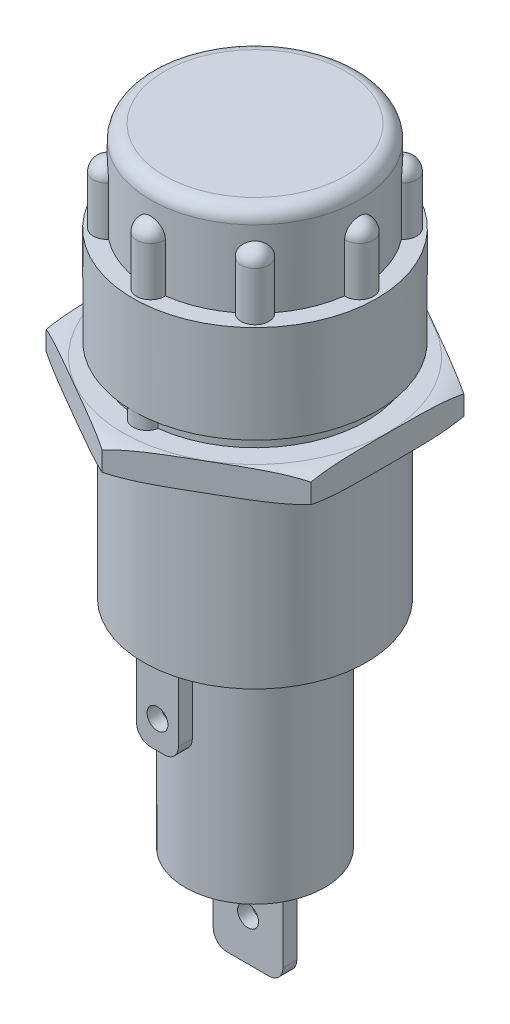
ISO-10303-21;
HEADER;
FILE_DESCRIPTION(('STEP AP214'),'2;1');
FILE_NAME('part.step','',(''),(''),'','','');
FILE_SCHEMA(('AUTOMOTIVE_DESIGN { 1 0 10303 214 1 1 1 1 }'));
ENDSEC;
DATA;
#1=APPLICATION_CONTEXT('core data for automotive mechanical design processes');
#2=APPLICATION_PROTOCOL_DEFINITION('international standard','automotive_design',2000,#1);
#3=PRODUCT_CONTEXT('',#1,'mechanical');
#4=PRODUCT('Part','Part','',(#3));
#5=PRODUCT_RELATED_PRODUCT_CATEGORY('part','',(#4));
#6=PRODUCT_DEFINITION_FORMATION('','',#4);
#7=PRODUCT_DEFINITION_CONTEXT('part definition',#1,'design');
#8=PRODUCT_DEFINITION('design','',#6,#7);
#9=PRODUCT_DEFINITION_SHAPE('','',#8);
#10=(LENGTH_UNIT() NAMED_UNIT(*) SI_UNIT(.MILLI.,.METRE.));
#11=(NAMED_UNIT(*) PLANE_ANGLE_UNIT() SI_UNIT($,.RADIAN.));
#12=(NAMED_UNIT(*) SI_UNIT($,.STERADIAN.) SOLID_ANGLE_UNIT());
#13=UNCERTAINTY_MEASURE_WITH_UNIT(LENGTH_MEASURE(1.E-05),#10,'distance_accuracy_value','');
#14=(GEOMETRIC_REPRESENTATION_CONTEXT(3) GLOBAL_UNCERTAINTY_ASSIGNED_CONTEXT((#13)) GLOBAL_UNIT_ASSIGNED_CONTEXT((#10,
#11,#12)) REPRESENTATION_CONTEXT('',''));
#15=CARTESIAN_POINT('',(0.,0.,0.));
#16=DIRECTION('',(0.,0.,1.));
#17=DIRECTION('',(1.,0.,0.));
#18=AXIS2_PLACEMENT_3D('',#15,#16,#17);
#19=CARTESIAN_POINT('',(0.,28.5,10.9696551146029));
#20=DIRECTION('',(0.5,0.,0.866025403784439));
#21=DIRECTION('',(0.866025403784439,0.,-0.5));
#22=AXIS2_PLACEMENT_3D('',#19,#20,#21);
#23=PLANE('',#22);
#24=DIRECTION('',(0.,1.,0.));
#25=VECTOR('',#24,1.);
#26=CARTESIAN_POINT('',(0.,28.5,10.9696551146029));
#27=LINE('',#26,#25);
#28=CARTESIAN_POINT('',(0.,28.8,10.9696551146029));
#29=VERTEX_POINT('',#28);
#30=CARTESIAN_POINT('',(0.,30.2,10.9696551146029));
#31=VERTEX_POINT('',#30);
#32=EDGE_CURVE('E68',#29,#31,#27,.T.);
#33=ORIENTED_EDGE('',*,*,#32,.F.);
#34=CARTESIAN_POINT('',(-0.000200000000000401,28.8000481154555,10.9697705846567));
#35=CARTESIAN_POINT('',(0.117671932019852,28.7716980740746,10.9017171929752));
#36=CARTESIAN_POINT('',(0.236042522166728,28.7462661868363,10.8333759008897));
#37=CARTESIAN_POINT('',(0.473477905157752,28.700547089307,10.6962925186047));
#38=CARTESIAN_POINT('',(0.592542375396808,28.6802576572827,10.6275506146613));
#39=CARTESIAN_POINT('',(0.830931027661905,28.6441439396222,10.4899168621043));
#40=CARTESIAN_POINT('',(0.95025424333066,28.6283109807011,10.4210255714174));
#41=CARTESIAN_POINT('',(1.18923954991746,28.6004061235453,10.2830473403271));
#42=CARTESIAN_POINT('',(1.30890167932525,28.5883346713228,10.2139603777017));
#43=CARTESIAN_POINT('',(1.66742097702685,28.5568948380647,10.006969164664));
#44=CARTESIAN_POINT('',(1.90658184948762,28.542192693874,9.86888957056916));
#45=CARTESIAN_POINT('',(2.38525900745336,28.5208545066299,9.59252518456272));
#46=CARTESIAN_POINT('',(2.62477541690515,28.5142229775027,9.45424032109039));
#47=CARTESIAN_POINT('',(3.10277350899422,28.5054505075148,9.17826799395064));
#48=CARTESIAN_POINT('',(3.34125496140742,28.5032893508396,9.04058066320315));
#49=CARTESIAN_POINT('',(3.81817442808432,28.5007807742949,8.76523108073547));
#50=CARTESIAN_POINT('',(4.05661244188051,28.5004330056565,8.6275688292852));
#51=CARTESIAN_POINT('',(4.53375413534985,28.5000827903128,8.35209094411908));
#52=CARTESIAN_POINT('',(4.77245781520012,28.5000807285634,8.21427531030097));
#53=CARTESIAN_POINT('',(5.24987758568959,28.5002357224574,7.93863687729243));
#54=CARTESIAN_POINT('',(5.48859367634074,28.5003927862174,7.80081407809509));
#55=CARTESIAN_POINT('',(5.8848913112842,28.5017492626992,7.57201153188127));
#56=CARTESIAN_POINT('',(6.04247348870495,28.5025762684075,7.48103141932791));
#57=CARTESIAN_POINT('',(6.35763371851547,28.5054401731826,7.29907357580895));
#58=CARTESIAN_POINT('',(6.51521177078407,28.5074770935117,7.20809584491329));
#59=CARTESIAN_POINT('',(6.83017119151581,28.5135711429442,7.02625393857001));
#60=CARTESIAN_POINT('',(6.98755258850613,28.5176260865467,6.93538974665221));
#61=CARTESIAN_POINT('',(7.30223277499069,28.528750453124,6.75370905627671));
#62=CARTESIAN_POINT('',(7.45953156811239,28.535819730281,6.6628925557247));
#63=CARTESIAN_POINT('',(7.774439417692,28.5541483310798,6.48108042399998));
#64=CARTESIAN_POINT('',(7.93204794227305,28.5654204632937,6.39008509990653));
#65=CARTESIAN_POINT('',(8.24687135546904,28.5934463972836,6.20832171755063));
#66=CARTESIAN_POINT('',(8.40408632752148,28.6101989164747,6.11755361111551));
#67=CARTESIAN_POINT('',(8.71843528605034,28.6506700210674,5.9360641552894));
#68=CARTESIAN_POINT('',(8.87556699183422,28.6744131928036,5.84534412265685));
#69=CARTESIAN_POINT('',(9.18881053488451,28.7304330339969,5.66449287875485));
#70=CARTESIAN_POINT('',(9.344921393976,28.7627169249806,5.57436223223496));
#71=CARTESIAN_POINT('',(9.5002,28.8000481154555,5.48471208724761));
#72=B_SPLINE_CURVE_WITH_KNOTS('',3,(#34,#35,#36,#37,#38,#39,#40,#41,#42,#43,#44,#45,#46,#47,#48,
#49,#50,#51,#52,#53,#54,#55,#56,#57,#58,#59,#60,#61,#62,#63,#64,#65,#66,#67,#68,#69,#70,#71),
.UNSPECIFIED.,.F.,.F.,(4,2,2,2,2,2,2,2,2,2,2,2,2,2,2,2,2,2,4),(0.,0.417006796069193,
0.833833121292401,1.24984251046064,1.6659012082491,2.49533172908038,3.32522594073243,
4.15135894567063,4.97733305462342,5.80422690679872,6.63116293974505,7.17704737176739,
7.7229413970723,8.2682455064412,8.81352323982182,9.36047652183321,9.90730189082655,
10.4560739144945,11.0053114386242),.UNSPECIFIED.);
#73=CARTESIAN_POINT('',(9.5,28.8,5.48482755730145));
#74=VERTEX_POINT('',#73);
#75=EDGE_CURVE('E62',#29,#74,#72,.T.);
#76=ORIENTED_EDGE('',*,*,#75,.T.);
#77=DIRECTION('',(0.,1.,0.));
#78=VECTOR('',#77,1.);
#79=CARTESIAN_POINT('',(9.5,28.5,5.48482755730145));
#80=LINE('',#79,#78);
#81=CARTESIAN_POINT('',(9.50000000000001,30.2,5.48482755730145));
#82=VERTEX_POINT('',#81);
#83=EDGE_CURVE('E341',#74,#82,#80,.T.);
#84=ORIENTED_EDGE('',*,*,#83,.T.);
#85=CARTESIAN_POINT('',(9.5002,30.1999518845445,5.48471208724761));
#86=CARTESIAN_POINT('',(9.38232806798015,30.2283019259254,5.55276547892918));
#87=CARTESIAN_POINT('',(9.26395747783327,30.2537338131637,5.62110677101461));
#88=CARTESIAN_POINT('',(9.02652209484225,30.299452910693,5.75819015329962));
#89=CARTESIAN_POINT('',(8.90745762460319,30.3197423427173,5.82693205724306));
#90=CARTESIAN_POINT('',(8.66906897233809,30.3558560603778,5.96456580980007));
#91=CARTESIAN_POINT('',(8.54974575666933,30.3716890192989,6.03345710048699));
#92=CARTESIAN_POINT('',(8.31076045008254,30.3995938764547,6.17143533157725));
#93=CARTESIAN_POINT('',(8.19109832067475,30.4116653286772,6.24052229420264));
#94=CARTESIAN_POINT('',(7.83257902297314,30.4431051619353,6.44751350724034));
#95=CARTESIAN_POINT('',(7.59341815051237,30.457807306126,6.58559310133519));
#96=CARTESIAN_POINT('',(7.11474099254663,30.4791454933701,6.86195748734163));
#97=CARTESIAN_POINT('',(6.87522458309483,30.4857770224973,7.00024235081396));
#98=CARTESIAN_POINT('',(6.39722649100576,30.4945494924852,7.27621467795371));
#99=CARTESIAN_POINT('',(6.15874503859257,30.4967106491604,7.4139020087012));
#100=CARTESIAN_POINT('',(5.68182557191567,30.4992192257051,7.68925159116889));
#101=CARTESIAN_POINT('',(5.44338755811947,30.4995669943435,7.82691384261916));
#102=CARTESIAN_POINT('',(4.96624586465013,30.4999172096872,8.10239172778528));
#103=CARTESIAN_POINT('',(4.72754218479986,30.4999192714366,8.24020736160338));
#104=CARTESIAN_POINT('',(4.25012241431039,30.4997642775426,8.51584579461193));
#105=CARTESIAN_POINT('',(4.01140632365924,30.4996072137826,8.65366859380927));
#106=CARTESIAN_POINT('',(3.61510868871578,30.4982507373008,8.88247114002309));
#107=CARTESIAN_POINT('',(3.45752651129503,30.4974237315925,8.97345125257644));
#108=CARTESIAN_POINT('',(3.14236628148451,30.4945598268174,9.15540909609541));
#109=CARTESIAN_POINT('',(2.98478822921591,30.4925229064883,9.24638682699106));
#110=CARTESIAN_POINT('',(2.66982880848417,30.4864288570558,9.42822873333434));
#111=CARTESIAN_POINT('',(2.51244741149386,30.4823739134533,9.51909292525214));
#112=CARTESIAN_POINT('',(2.1977672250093,30.471249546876,9.70077361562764));
#113=CARTESIAN_POINT('',(2.0404684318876,30.464180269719,9.79159011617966));
#114=CARTESIAN_POINT('',(1.72556058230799,30.4458516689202,9.97340224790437));
#115=CARTESIAN_POINT('',(1.56795205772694,30.4345795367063,10.0643975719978));
#116=CARTESIAN_POINT('',(1.25312864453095,30.4065536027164,10.2461609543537));
#117=CARTESIAN_POINT('',(1.09591367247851,30.3898010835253,10.3369290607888));
#118=CARTESIAN_POINT('',(0.781564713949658,30.3493299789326,10.5184185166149));
#119=CARTESIAN_POINT('',(0.624433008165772,30.3255868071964,10.6091385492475));
#120=CARTESIAN_POINT('',(0.311189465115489,30.2695669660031,10.7899897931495));
#121=CARTESIAN_POINT('',(0.155078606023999,30.2372830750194,10.8801204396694));
#122=CARTESIAN_POINT('',(-0.000199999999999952,30.1999518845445,10.9697705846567));
#123=B_SPLINE_CURVE_WITH_KNOTS('',3,(#85,#86,#87,#88,#89,#90,#91,#92,#93,#94,#95,#96,#97,#98,
#99,#100,#101,#102,#103,#104,#105,#106,#107,#108,#109,#110,#111,#112,#113,#114,#115,#116,#117,
#118,#119,#120,#121,#122),.UNSPECIFIED.,.F.,.F.,(4,2,2,2,2,2,2,2,2,2,2,2,2,2,2,2,2,2,4),(0.,
0.417006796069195,0.833833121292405,1.24984251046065,1.6659012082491,2.49533172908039,
3.32522594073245,4.15135894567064,4.97733305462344,5.80422690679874,6.63116293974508,
7.17704737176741,7.72294139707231,8.26824550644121,8.81352323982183,9.36047652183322,
9.90730189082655,10.4560739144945,11.0053114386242),.UNSPECIFIED.);
#124=EDGE_CURVE('E55',#82,#31,#123,.T.);
#125=ORIENTED_EDGE('',*,*,#124,.T.);
#126=EDGE_LOOP('',(#33,#76,#84,#125));
#127=FACE_BOUND('',#126,.T.);
#128=ADVANCED_FACE('F41',(#127),#23,.T.);
#129=CARTESIAN_POINT('',(9.5,28.5,5.48482755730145));
#130=DIRECTION('',(1.,0.,0.));
#131=DIRECTION('',(0.,0.,-1.));
#132=AXIS2_PLACEMENT_3D('',#129,#130,#131);
#133=PLANE('',#132);
#134=ORIENTED_EDGE('',*,*,#83,.F.);
#135=CARTESIAN_POINT('',(9.5,28.5001180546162,0.));
#136=CARTESIAN_POINT('',(9.5,28.5001164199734,-0.194546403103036));
#137=CARTESIAN_POINT('',(9.5,28.5001503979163,-0.389092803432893));
#138=CARTESIAN_POINT('',(9.5,28.5004467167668,-0.778186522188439));
#139=CARTESIAN_POINT('',(9.5,28.5007090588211,-0.972733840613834));
#140=CARTESIAN_POINT('',(9.5,28.5019483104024,-1.36190452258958));
#141=CARTESIAN_POINT('',(9.5,28.5029255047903,-1.55652788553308));
#142=CARTESIAN_POINT('',(9.5,28.5063746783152,-1.94576227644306));
#143=CARTESIAN_POINT('',(9.5,28.508846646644,-2.14037330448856));
#144=CARTESIAN_POINT('',(9.5,28.5163239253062,-2.52932636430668));
#145=CARTESIAN_POINT('',(9.5,28.5213263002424,-2.72366844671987));
#146=CARTESIAN_POINT('',(9.5,28.5351280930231,-3.11223669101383));
#147=CARTESIAN_POINT('',(9.5,28.5439277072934,-3.30646284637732));
#148=CARTESIAN_POINT('',(9.5,28.5667749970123,-3.6944678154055));
#149=CARTESIAN_POINT('',(9.5,28.5808185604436,-3.88824686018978));
#150=CARTESIAN_POINT('',(9.5,28.6157765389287,-4.27517185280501));
#151=CARTESIAN_POINT('',(9.5,28.6366898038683,-4.46831790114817));
#152=CARTESIAN_POINT('',(9.5,28.6826858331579,-4.81930229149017));
#153=CARTESIAN_POINT('',(9.5,28.7063685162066,-4.97731929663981));
#154=CARTESIAN_POINT('',(9.5,28.7606383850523,-5.29215369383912));
#155=CARTESIAN_POINT('',(9.5,28.7912262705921,-5.44897096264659));
#156=CARTESIAN_POINT('',(9.5,28.8951324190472,-5.91731131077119));
#157=CARTESIAN_POINT('',(9.5,28.9805592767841,-6.22643122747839));
#158=CARTESIAN_POINT('',(9.5,29.1405219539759,-6.68131734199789));
#159=CARTESIAN_POINT('',(9.5,29.1996906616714,-6.83253675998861));
#160=CARTESIAN_POINT('',(9.5,29.3299535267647,-7.1298587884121));
#161=CARTESIAN_POINT('',(9.5,29.4010502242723,-7.27596030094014));
#162=CARTESIAN_POINT('',(9.5,29.5560576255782,-7.56071365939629));
#163=CARTESIAN_POINT('',(9.5,29.6399303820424,-7.69938597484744));
#164=CARTESIAN_POINT('',(9.5,29.8214867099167,-7.96728581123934));
#165=CARTESIAN_POINT('',(9.5,29.9191591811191,-8.09652079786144));
#166=CARTESIAN_POINT('',(9.5,30.147816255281,-8.36498938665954));
#167=CARTESIAN_POINT('',(9.5,30.281633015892,-8.5018467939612));
#168=CARTESIAN_POINT('',(9.5,30.5692928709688,-8.75300883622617));
#169=CARTESIAN_POINT('',(9.5,30.7231295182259,-8.86732070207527));
#170=CARTESIAN_POINT('',(9.5,30.9678705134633,-9.01756815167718));
#171=CARTESIAN_POINT('',(9.5,31.0522589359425,-9.06430100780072));
#172=CARTESIAN_POINT('',(9.5,31.2250344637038,-9.14963006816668));
#173=CARTESIAN_POINT('',(9.5,31.3134194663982,-9.18823049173));
#174=CARTESIAN_POINT('',(9.5,31.4935173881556,-9.25656296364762));
#175=CARTESIAN_POINT('',(9.5,31.5852286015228,-9.28629948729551));
#176=CARTESIAN_POINT('',(9.5,31.7711556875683,-9.33633012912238));
#177=CARTESIAN_POINT('',(9.5,31.8653711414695,-9.35662581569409));
#178=CARTESIAN_POINT('',(9.5,32.1253857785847,-9.3985923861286));
#179=CARTESIAN_POINT('',(9.5,32.2929140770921,-9.41031517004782));
#180=CARTESIAN_POINT('',(9.5,32.627176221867,-9.40301176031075));
#181=CARTESIAN_POINT('',(9.5,32.7939102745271,-9.383994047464));
#182=CARTESIAN_POINT('',(9.5,33.1093567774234,-9.31904239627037));
#183=CARTESIAN_POINT('',(9.5,33.2584990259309,-9.27516163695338));
#184=CARTESIAN_POINT('',(9.5,33.54793246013,-9.16454081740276));
#185=CARTESIAN_POINT('',(9.5,33.6882250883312,-9.09780449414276));
#186=CARTESIAN_POINT('',(9.5,33.9665568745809,-8.93942060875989));
#187=CARTESIAN_POINT('',(9.5,34.1038089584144,-8.84639879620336));
#188=CARTESIAN_POINT('',(9.5,34.3638477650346,-8.64185422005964));
#189=CARTESIAN_POINT('',(9.5,34.4866142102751,-8.53030603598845));
#190=CARTESIAN_POINT('',(9.5,34.7778777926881,-8.22975177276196));
#191=CARTESIAN_POINT('',(9.5,34.9362847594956,-8.03095089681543));
#192=CARTESIAN_POINT('',(9.5,35.2189001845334,-7.61113903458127));
#193=CARTESIAN_POINT('',(9.5,35.3431227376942,-7.39013725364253));
#194=CARTESIAN_POINT('',(9.5,35.5383426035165,-6.98239575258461));
#195=CARTESIAN_POINT('',(9.5,35.6150404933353,-6.79831335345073));
#196=CARTESIAN_POINT('',(9.5,35.7520524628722,-6.42405848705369));
#197=CARTESIAN_POINT('',(9.5,35.8123541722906,-6.23388154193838));
#198=CARTESIAN_POINT('',(9.5,35.9192514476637,-5.84796878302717));
#199=CARTESIAN_POINT('',(9.5,35.9657214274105,-5.65219873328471));
#200=CARTESIAN_POINT('',(9.5,36.0263007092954,-5.35682282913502));
#201=CARTESIAN_POINT('',(9.5,36.044967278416,-5.25811673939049));
#202=CARTESIAN_POINT('',(9.5,36.0795427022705,-5.06023559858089));
#203=CARTESIAN_POINT('',(9.5,36.0954519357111,-4.96106061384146));
#204=CARTESIAN_POINT('',(9.5,36.142815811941,-4.64019429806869));
#205=CARTESIAN_POINT('',(9.5,36.1693376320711,-4.41777040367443));
#206=CARTESIAN_POINT('',(9.5,36.2128142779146,-3.97197122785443));
#207=CARTESIAN_POINT('',(9.5,36.2297658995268,-3.74859565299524));
#208=CARTESIAN_POINT('',(9.5,36.2566306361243,-3.30112589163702));
#209=CARTESIAN_POINT('',(9.5,36.266533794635,-3.07703113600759));
#210=CARTESIAN_POINT('',(9.5,36.2814939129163,-2.62871927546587));
#211=CARTESIAN_POINT('',(9.5,36.286551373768,-2.40450218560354));
#212=CARTESIAN_POINT('',(9.5,36.2937298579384,-1.95439515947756));
#213=CARTESIAN_POINT('',(9.5,36.2958292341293,-1.72850492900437));
#214=CARTESIAN_POINT('',(9.5,36.298518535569,-1.27671480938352));
#215=CARTESIAN_POINT('',(9.5,36.2991084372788,-1.05081492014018));
#216=CARTESIAN_POINT('',(9.5,36.2997710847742,-0.599245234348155));
#217=CARTESIAN_POINT('',(9.5,36.2998443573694,-0.373575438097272));
#218=CARTESIAN_POINT('',(9.5,36.2999012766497,0.0777615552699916));
#219=CARTESIAN_POINT('',(9.5,36.2998849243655,0.30342875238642));
#220=CARTESIAN_POINT('',(9.5,36.299595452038,0.752932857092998));
#221=CARTESIAN_POINT('',(9.5,36.2993244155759,0.976769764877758));
#222=CARTESIAN_POINT('',(9.5,36.297798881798,1.42444677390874));
#223=CARTESIAN_POINT('',(9.5,36.2965443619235,1.64828687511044));
#224=CARTESIAN_POINT('',(9.5,36.2918046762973,2.09627607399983));
#225=CARTESIAN_POINT('',(9.5,36.2883162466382,2.32042514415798));
#226=CARTESIAN_POINT('',(9.5,36.2774083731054,2.76863136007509));
#227=CARTESIAN_POINT('',(9.5,36.2699890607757,2.99268850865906));
#228=CARTESIAN_POINT('',(9.5,36.2492461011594,3.43834408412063));
#229=CARTESIAN_POINT('',(9.5,36.2359811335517,3.65994505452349));
#230=CARTESIAN_POINT('',(9.5,36.2012338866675,4.10257100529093));
#231=CARTESIAN_POINT('',(9.5,36.1797502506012,4.32359588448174));
#232=CARTESIAN_POINT('',(9.5,36.1260404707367,4.76381239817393));
#233=CARTESIAN_POINT('',(9.5,36.0938415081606,4.98300724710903));
#234=CARTESIAN_POINT('',(9.5,36.0158932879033,5.41893341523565));
#235=CARTESIAN_POINT('',(9.5,35.97015157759,5.63566603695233));
#236=CARTESIAN_POINT('',(9.5,35.8768079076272,6.00662509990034));
#237=CARTESIAN_POINT('',(9.5,35.8330929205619,6.16182504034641));
#238=CARTESIAN_POINT('',(9.5,35.735620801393,6.46929061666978));
#239=CARTESIAN_POINT('',(9.5,35.6818510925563,6.6215523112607));
#240=CARTESIAN_POINT('',(9.5,35.5634339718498,6.92082245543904));
#241=CARTESIAN_POINT('',(9.5,35.4988509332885,7.06785609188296));
#242=CARTESIAN_POINT('',(9.5,35.3575185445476,7.35585601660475));
#243=CARTESIAN_POINT('',(9.5,35.2807774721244,7.49682635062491));
#244=CARTESIAN_POINT('',(9.5,35.0836383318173,7.82079958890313));
#245=CARTESIAN_POINT('',(9.5,34.9575204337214,8.00040733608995));
#246=CARTESIAN_POINT('',(9.5,34.678726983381,8.33831731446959));
#247=CARTESIAN_POINT('',(9.5,34.5260299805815,8.49660215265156));
#248=CARTESIAN_POINT('',(9.5,34.2247820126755,8.75688570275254));
#249=CARTESIAN_POINT('',(9.5,34.0806057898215,8.86388332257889));
#250=CARTESIAN_POINT('',(9.5,33.8527348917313,9.00541447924));
#251=CARTESIAN_POINT('',(9.5,33.7748433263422,9.049430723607));
#252=CARTESIAN_POINT('',(9.5,33.6155545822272,9.13054786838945));
#253=CARTESIAN_POINT('',(9.5,33.5341589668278,9.16765181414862));
#254=CARTESIAN_POINT('',(9.5,33.3676943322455,9.23462755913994));
#255=CARTESIAN_POINT('',(9.5,33.2826014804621,9.26444025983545));
#256=CARTESIAN_POINT('',(9.5,33.1100245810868,9.31592230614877));
#257=CARTESIAN_POINT('',(9.5,33.0225417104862,9.33759558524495));
#258=CARTESIAN_POINT('',(9.5,32.8458801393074,9.37240989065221));
#259=CARTESIAN_POINT('',(9.5,32.7567013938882,9.38555069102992));
#260=CARTESIAN_POINT('',(9.5,32.5775182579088,9.40305076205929));
#261=CARTESIAN_POINT('',(9.5,32.4875139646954,9.40741105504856));
#262=CARTESIAN_POINT('',(9.5,32.2389319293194,9.40715768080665));
#263=CARTESIAN_POINT('',(9.5,32.080264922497,9.39319614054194));
#264=CARTESIAN_POINT('',(9.5,31.7677848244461,9.33848464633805));
#265=CARTESIAN_POINT('',(9.5,31.6139706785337,9.29774055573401));
#266=CARTESIAN_POINT('',(9.5,31.3165553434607,9.19236979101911));
#267=CARTESIAN_POINT('',(9.5,31.1728673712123,9.12798613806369));
#268=CARTESIAN_POINT('',(9.5,30.8967946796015,8.97846787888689));
#269=CARTESIAN_POINT('',(9.5,30.7644153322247,8.89332348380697));
#270=CARTESIAN_POINT('',(9.5,30.4650706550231,8.67029298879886));
#271=CARTESIAN_POINT('',(9.5,30.3038900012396,8.52462627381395));
#272=CARTESIAN_POINT('',(9.5,30.0074137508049,8.20907314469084));
#273=CARTESIAN_POINT('',(9.5,29.8721640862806,8.03914466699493));
#274=CARTESIAN_POINT('',(9.5,29.5737542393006,7.60540968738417));
#275=CARTESIAN_POINT('',(9.5,29.4236034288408,7.33265732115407));
#276=CARTESIAN_POINT('',(9.5,29.2316374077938,6.9091599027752));
#277=CARTESIAN_POINT('',(9.5,29.1731437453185,6.76542460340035));
#278=CARTESIAN_POINT('',(9.5,29.0661221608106,6.47428107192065));
#279=CARTESIAN_POINT('',(9.5,29.0175920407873,6.32687365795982));
#280=CARTESIAN_POINT('',(9.5,28.9196579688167,5.99642562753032));
#281=CARTESIAN_POINT('',(9.5,28.872453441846,5.81274165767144));
#282=CARTESIAN_POINT('',(9.5,28.7894082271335,5.44285072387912));
#283=CARTESIAN_POINT('',(9.5,28.7535685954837,5.25664352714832));
#284=CARTESIAN_POINT('',(9.5,28.6913425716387,4.88230230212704));
#285=CARTESIAN_POINT('',(9.5,28.6649753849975,4.69416514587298));
#286=CARTESIAN_POINT('',(9.5,28.6200420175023,4.31699792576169));
#287=CARTESIAN_POINT('',(9.5,28.6014753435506,4.12796791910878));
#288=CARTESIAN_POINT('',(9.5,28.5704434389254,3.74854308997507));
#289=CARTESIAN_POINT('',(9.5,28.5580068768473,3.55814600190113));
#290=CARTESIAN_POINT('',(9.5,28.537859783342,3.17710191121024));
#291=CARTESIAN_POINT('',(9.5,28.5301495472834,2.98645489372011));
#292=CARTESIAN_POINT('',(9.5,28.5181204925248,2.60522889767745));
#293=CARTESIAN_POINT('',(9.5,28.5137987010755,2.41465000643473));
#294=CARTESIAN_POINT('',(9.5,28.5073812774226,2.03346110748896));
#295=CARTESIAN_POINT('',(9.5,28.5052856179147,1.84285110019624));
#296=CARTESIAN_POINT('',(9.5,28.5027894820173,1.51443625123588));
#297=CARTESIAN_POINT('',(9.5,28.5020802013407,1.37663329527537));
#298=CARTESIAN_POINT('',(9.5,28.5010670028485,1.10101568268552));
#299=CARTESIAN_POINT('',(9.5,28.5007631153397,0.963201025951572));
#300=CARTESIAN_POINT('',(9.5,28.5003587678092,0.687816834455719));
#301=CARTESIAN_POINT('',(9.5,28.500257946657,0.55024730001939));
#302=CARTESIAN_POINT('',(9.5,28.5001381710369,0.275118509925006));
#303=CARTESIAN_POINT('',(9.5,28.5001192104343,0.137559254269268));
#304=CARTESIAN_POINT('',(9.5,28.5001180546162,0.));
#305=B_SPLINE_CURVE_WITH_KNOTS('',3,(#135,#136,#137,#138,#139,#140,#141,#142,#143,#144,#145,
#146,#147,#148,#149,#150,#151,#152,#153,#154,#155,#156,#157,#158,#159,#160,#161,#162,#163,#164,
#165,#166,#167,#168,#169,#170,#171,#172,#173,#174,#175,#176,#177,#178,#179,#180,#181,#182,#183,
#184,#185,#186,#187,#188,#189,#190,#191,#192,#193,#194,#195,#196,#197,#198,#199,#200,#201,#202,
#203,#204,#205,#206,#207,#208,#209,#210,#211,#212,#213,#214,#215,#216,#217,#218,#219,#220,#221,
#222,#223,#224,#225,#226,#227,#228,#229,#230,#231,#232,#233,#234,#235,#236,#237,#238,#239,#240,
#241,#242,#243,#244,#245,#246,#247,#248,#249,#250,#251,#252,#253,#254,#255,#256,#257,#258,#259,
#260,#261,#262,#263,#264,#265,#266,#267,#268,#269,#270,#271,#272,#273,#274,#275,#276,#277,#278,
#279,#280,#281,#282,#283,#284,#285,#286,#287,#288,#289,#290,#291,#292,#293,#294,#295,#296,#297,
#298,#299,#300,#301,#302,#303,#304),.UNSPECIFIED.,.T.,.F.,(4,2,2,2,2,2,2,2,2,2,2,2,2,2,2,2,2,2,
2,2,2,2,2,2,2,2,2,2,2,2,2,2,2,2,2,2,2,2,2,2,2,2,2,2,2,2,2,2,2,2,2,2,2,2,2,2,2,2,2,2,2,2,2,2,2,2,
2,2,2,2,2,2,2,2,2,2,2,2,2,2,2,2,2,2,4),(0.,0.583639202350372,1.16728133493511,1.75115616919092,
2.33502678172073,2.91822162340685,3.50144663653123,4.0842152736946,4.66688639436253,
5.1460782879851,5.62531876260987,6.58467774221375,7.07141978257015,7.55826560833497,
8.04369263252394,8.52873138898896,9.10092732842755,9.67293945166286,9.96197471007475,
10.2508596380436,10.5395984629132,10.8282893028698,11.3291134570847,11.8297994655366,
12.2941555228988,12.7584356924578,13.253961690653,13.7501733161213,14.5084476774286,
15.2664089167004,15.8638332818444,16.461707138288,17.0648545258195,17.3661901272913,
17.6674843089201,18.3391735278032,19.0110874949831,19.6839487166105,20.3567403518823,
21.0344303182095,21.712130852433,22.3891402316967,23.0661418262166,23.7376526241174,
24.4091788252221,25.0816884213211,25.7541755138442,26.420060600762,27.0860556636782,
27.7503740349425,28.4143228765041,28.8977563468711,29.3817986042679,29.863055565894,
30.343986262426,31.0001106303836,31.6567669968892,32.1930042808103,32.4611240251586,
32.7291253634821,32.999231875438,33.2692076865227,33.5391906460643,33.8091421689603,
34.2844152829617,34.7595843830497,35.2299994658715,35.7006367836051,36.3487667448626,
36.9980343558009,37.9265107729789,38.3918271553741,38.8570407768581,39.425569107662,
39.9941502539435,40.563877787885,41.1335693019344,41.7059003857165,42.2782672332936,
42.8501313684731,43.421988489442,43.8354021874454,44.2488467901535,44.6615554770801,
45.0742332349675),.UNSPECIFIED.);
#306=CARTESIAN_POINT('',(9.50000000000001,28.8,-5.48482755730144));
#307=VERTEX_POINT('',#306);
#308=EDGE_CURVE('E326',#74,#307,#305,.T.);
#309=ORIENTED_EDGE('',*,*,#308,.T.);
#310=DIRECTION('',(0.,1.,0.));
#311=VECTOR('',#310,1.);
#312=CARTESIAN_POINT('',(9.5,28.5,-5.48482755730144));
#313=LINE('',#312,#311);
#314=CARTESIAN_POINT('',(9.5,30.2,-5.48482755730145));
#315=VERTEX_POINT('',#314);
#316=EDGE_CURVE('E324',#307,#315,#313,.T.);
#317=ORIENTED_EDGE('',*,*,#316,.T.);
#318=CARTESIAN_POINT('',(9.5,30.4998819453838,0.));
#319=CARTESIAN_POINT('',(9.5,30.4998835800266,0.194546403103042));
#320=CARTESIAN_POINT('',(9.5,30.4998496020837,0.389092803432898));
#321=CARTESIAN_POINT('',(9.5,30.4995532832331,0.778186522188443));
#322=CARTESIAN_POINT('',(9.5,30.4992909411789,0.972733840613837));
#323=CARTESIAN_POINT('',(9.5,30.4980516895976,1.36190452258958));
#324=CARTESIAN_POINT('',(9.5,30.4970744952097,1.55652788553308));
#325=CARTESIAN_POINT('',(9.5,30.4936253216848,1.94576227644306));
#326=CARTESIAN_POINT('',(9.5,30.491153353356,2.14037330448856));
#327=CARTESIAN_POINT('',(9.5,30.4836760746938,2.52932636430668));
#328=CARTESIAN_POINT('',(9.5,30.4786736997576,2.72366844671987));
#329=CARTESIAN_POINT('',(9.5,30.4648719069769,3.11223669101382));
#330=CARTESIAN_POINT('',(9.5,30.4560722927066,3.30646284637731));
#331=CARTESIAN_POINT('',(9.5,30.4332250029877,3.69446781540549));
#332=CARTESIAN_POINT('',(9.5,30.4191814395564,3.88824686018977));
#333=CARTESIAN_POINT('',(9.5,30.3842234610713,4.275171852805));
#334=CARTESIAN_POINT('',(9.5,30.3633101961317,4.46831790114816));
#335=CARTESIAN_POINT('',(9.5,30.3173141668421,4.81930229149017));
#336=CARTESIAN_POINT('',(9.5,30.2936314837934,4.9773192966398));
#337=CARTESIAN_POINT('',(9.5,30.2393616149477,5.29215369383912));
#338=CARTESIAN_POINT('',(9.5,30.2087737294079,5.44897096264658));
#339=CARTESIAN_POINT('',(9.5,30.1048675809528,5.91731131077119));
#340=CARTESIAN_POINT('',(9.5,30.0194407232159,6.22643122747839));
#341=CARTESIAN_POINT('',(9.5,29.8594780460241,6.6813173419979));
#342=CARTESIAN_POINT('',(9.5,29.8003093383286,6.83253675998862));
#343=CARTESIAN_POINT('',(9.5,29.6700464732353,7.12985878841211));
#344=CARTESIAN_POINT('',(9.5,29.5989497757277,7.27596030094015));
#345=CARTESIAN_POINT('',(9.5,29.4439423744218,7.5607136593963));
#346=CARTESIAN_POINT('',(9.5,29.3600696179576,7.69938597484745));
#347=CARTESIAN_POINT('',(9.5,29.1785132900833,7.96728581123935));
#348=CARTESIAN_POINT('',(9.5,29.0808408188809,8.09652079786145));
#349=CARTESIAN_POINT('',(9.5,28.852183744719,8.36498938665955));
#350=CARTESIAN_POINT('',(9.5,28.718366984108,8.50184679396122));
#351=CARTESIAN_POINT('',(9.5,28.4307071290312,8.75300883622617));
#352=CARTESIAN_POINT('',(9.5,28.276870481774,8.86732070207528));
#353=CARTESIAN_POINT('',(9.5,28.0321294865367,9.01756815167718));
#354=CARTESIAN_POINT('',(9.5,27.9477410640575,9.06430100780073));
#355=CARTESIAN_POINT('',(9.5,27.7749655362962,9.14963006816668));
#356=CARTESIAN_POINT('',(9.5,27.6865805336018,9.18823049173));
#357=CARTESIAN_POINT('',(9.5,27.5064826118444,9.25656296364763));
#358=CARTESIAN_POINT('',(9.5,27.4147713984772,9.28629948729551));
#359=CARTESIAN_POINT('',(9.5,27.2288443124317,9.33633012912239));
#360=CARTESIAN_POINT('',(9.5,27.1346288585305,9.3566258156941));
#361=CARTESIAN_POINT('',(9.5,26.8746142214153,9.3985923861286));
#362=CARTESIAN_POINT('',(9.5,26.7070859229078,9.41031517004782));
#363=CARTESIAN_POINT('',(9.5,26.372823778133,9.40301176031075));
#364=CARTESIAN_POINT('',(9.5,26.2060897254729,9.383994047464));
#365=CARTESIAN_POINT('',(9.5,25.8906432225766,9.31904239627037));
#366=CARTESIAN_POINT('',(9.5,25.7415009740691,9.27516163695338));
#367=CARTESIAN_POINT('',(9.5,25.45206753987,9.16454081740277));
#368=CARTESIAN_POINT('',(9.5,25.3117749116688,9.09780449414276));
#369=CARTESIAN_POINT('',(9.5,25.0334431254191,8.93942060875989));
#370=CARTESIAN_POINT('',(9.5,24.8961910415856,8.84639879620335));
#371=CARTESIAN_POINT('',(9.5,24.6361522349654,8.64185422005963));
#372=CARTESIAN_POINT('',(9.5,24.5133857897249,8.53030603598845));
#373=CARTESIAN_POINT('',(9.5,24.2221222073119,8.22975177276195));
#374=CARTESIAN_POINT('',(9.5,24.0637152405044,8.03095089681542));
#375=CARTESIAN_POINT('',(9.5,23.7810998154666,7.61113903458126));
#376=CARTESIAN_POINT('',(9.5,23.6568772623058,7.39013725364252));
#377=CARTESIAN_POINT('',(9.5,23.4616573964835,6.9823957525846));
#378=CARTESIAN_POINT('',(9.5,23.3849595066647,6.79831335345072));
#379=CARTESIAN_POINT('',(9.5,23.2479475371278,6.42405848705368));
#380=CARTESIAN_POINT('',(9.5,23.1876458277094,6.23388154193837));
#381=CARTESIAN_POINT('',(9.5,23.0807485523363,5.84796878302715));
#382=CARTESIAN_POINT('',(9.5,23.0342785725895,5.65219873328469));
#383=CARTESIAN_POINT('',(9.5,22.9736992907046,5.356822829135));
#384=CARTESIAN_POINT('',(9.5,22.955032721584,5.25811673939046));
#385=CARTESIAN_POINT('',(9.5,22.9204572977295,5.06023559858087));
#386=CARTESIAN_POINT('',(9.5,22.9045480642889,4.96106061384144));
#387=CARTESIAN_POINT('',(9.5,22.857184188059,4.64019429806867));
#388=CARTESIAN_POINT('',(9.5,22.8306623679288,4.4177704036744));
#389=CARTESIAN_POINT('',(9.5,22.7871857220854,3.9719712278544));
#390=CARTESIAN_POINT('',(9.5,22.7702341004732,3.74859565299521));
#391=CARTESIAN_POINT('',(9.5,22.7433693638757,3.30112589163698));
#392=CARTESIAN_POINT('',(9.5,22.733466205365,3.07703113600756));
#393=CARTESIAN_POINT('',(9.5,22.7185060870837,2.62871927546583));
#394=CARTESIAN_POINT('',(9.5,22.713448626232,2.4045021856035));
#395=CARTESIAN_POINT('',(9.5,22.7062701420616,1.95439515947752));
#396=CARTESIAN_POINT('',(9.5,22.7041707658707,1.72850492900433));
#397=CARTESIAN_POINT('',(9.5,22.701481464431,1.27671480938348));
#398=CARTESIAN_POINT('',(9.5,22.7008915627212,1.05081492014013));
#399=CARTESIAN_POINT('',(9.5,22.7002289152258,0.599245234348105));
#400=CARTESIAN_POINT('',(9.5,22.7001556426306,0.373575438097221));
#401=CARTESIAN_POINT('',(9.5,22.7000987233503,-0.0777615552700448));
#402=CARTESIAN_POINT('',(9.5,22.7001150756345,-0.303428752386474));
#403=CARTESIAN_POINT('',(9.5,22.700404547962,-0.752932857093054));
#404=CARTESIAN_POINT('',(9.5,22.7006755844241,-0.976769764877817));
#405=CARTESIAN_POINT('',(9.5,22.702201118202,-1.4244467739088));
#406=CARTESIAN_POINT('',(9.5,22.7034556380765,-1.6482868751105));
#407=CARTESIAN_POINT('',(9.5,22.7081953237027,-2.0962760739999));
#408=CARTESIAN_POINT('',(9.5,22.7116837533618,-2.32042514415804));
#409=CARTESIAN_POINT('',(9.5,22.7225916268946,-2.76863136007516));
#410=CARTESIAN_POINT('',(9.5,22.7300109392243,-2.99268850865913));
#411=CARTESIAN_POINT('',(9.5,22.7507538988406,-3.4383440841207));
#412=CARTESIAN_POINT('',(9.5,22.7640188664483,-3.65994505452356));
#413=CARTESIAN_POINT('',(9.5,22.7987661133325,-4.102571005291));
#414=CARTESIAN_POINT('',(9.5,22.8202497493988,-4.32359588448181));
#415=CARTESIAN_POINT('',(9.5,22.8739595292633,-4.763812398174));
#416=CARTESIAN_POINT('',(9.5,22.9061584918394,-4.98300724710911));
#417=CARTESIAN_POINT('',(9.5,22.9841067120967,-5.41893341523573));
#418=CARTESIAN_POINT('',(9.5,23.02984842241,-5.63566603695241));
#419=CARTESIAN_POINT('',(9.5,23.1231920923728,-6.00662509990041));
#420=CARTESIAN_POINT('',(9.5,23.1669070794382,-6.16182504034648));
#421=CARTESIAN_POINT('',(9.5,23.264379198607,-6.46929061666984));
#422=CARTESIAN_POINT('',(9.5,23.3181489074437,-6.62155231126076));
#423=CARTESIAN_POINT('',(9.5,23.4365660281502,-6.92082245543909));
#424=CARTESIAN_POINT('',(9.5,23.5011490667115,-7.06785609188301));
#425=CARTESIAN_POINT('',(9.5,23.6424814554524,-7.35585601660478));
#426=CARTESIAN_POINT('',(9.5,23.7192225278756,-7.49682635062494));
#427=CARTESIAN_POINT('',(9.5,23.9163616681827,-7.82079958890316));
#428=CARTESIAN_POINT('',(9.5,24.0424795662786,-8.00040733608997));
#429=CARTESIAN_POINT('',(9.5,24.321273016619,-8.33831731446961));
#430=CARTESIAN_POINT('',(9.5,24.4739700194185,-8.49660215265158));
#431=CARTESIAN_POINT('',(9.5,24.7752179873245,-8.75688570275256));
#432=CARTESIAN_POINT('',(9.5,24.9193942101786,-8.8638833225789));
#433=CARTESIAN_POINT('',(9.5,25.1472651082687,-9.00541447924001));
#434=CARTESIAN_POINT('',(9.5,25.2251566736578,-9.049430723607));
#435=CARTESIAN_POINT('',(9.5,25.3844454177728,-9.13054786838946));
#436=CARTESIAN_POINT('',(9.5,25.4658410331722,-9.16765181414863));
#437=CARTESIAN_POINT('',(9.5,25.6323056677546,-9.23462755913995));
#438=CARTESIAN_POINT('',(9.5,25.7173985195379,-9.26444025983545));
#439=CARTESIAN_POINT('',(9.5,25.8899754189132,-9.31592230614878));
#440=CARTESIAN_POINT('',(9.5,25.9774582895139,-9.33759558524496));
#441=CARTESIAN_POINT('',(9.5,26.1541198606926,-9.37240989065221));
#442=CARTESIAN_POINT('',(9.5,26.2432986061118,-9.38555069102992));
#443=CARTESIAN_POINT('',(9.5,26.4224817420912,-9.40305076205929));
#444=CARTESIAN_POINT('',(9.5,26.5124860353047,-9.40741105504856));
#445=CARTESIAN_POINT('',(9.5,26.7610680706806,-9.40715768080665));
#446=CARTESIAN_POINT('',(9.5,26.919735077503,-9.39319614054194));
#447=CARTESIAN_POINT('',(9.5,27.2322151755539,-9.33848464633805));
#448=CARTESIAN_POINT('',(9.5,27.3860293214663,-9.29774055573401));
#449=CARTESIAN_POINT('',(9.5,27.6834446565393,-9.1923697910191));
#450=CARTESIAN_POINT('',(9.5,27.8271326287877,-9.12798613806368));
#451=CARTESIAN_POINT('',(9.5,28.1032053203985,-8.97846787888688));
#452=CARTESIAN_POINT('',(9.5,28.2355846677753,-8.89332348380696));
#453=CARTESIAN_POINT('',(9.5,28.5349293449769,-8.67029298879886));
#454=CARTESIAN_POINT('',(9.5,28.6961099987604,-8.52462627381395));
#455=CARTESIAN_POINT('',(9.5,28.9925862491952,-8.20907314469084));
#456=CARTESIAN_POINT('',(9.5,29.1278359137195,-8.03914466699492));
#457=CARTESIAN_POINT('',(9.5,29.4262457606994,-7.60540968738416));
#458=CARTESIAN_POINT('',(9.5,29.5763965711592,-7.33265732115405));
#459=CARTESIAN_POINT('',(9.5,29.7683625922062,-6.90915990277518));
#460=CARTESIAN_POINT('',(9.5,29.8268562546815,-6.76542460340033));
#461=CARTESIAN_POINT('',(9.5,29.9338778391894,-6.47428107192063));
#462=CARTESIAN_POINT('',(9.5,29.9824079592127,-6.3268736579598));
#463=CARTESIAN_POINT('',(9.5,30.0803420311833,-5.99642562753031));
#464=CARTESIAN_POINT('',(9.5,30.127546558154,-5.81274165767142));
#465=CARTESIAN_POINT('',(9.5,30.2105917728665,-5.4428507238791));
#466=CARTESIAN_POINT('',(9.5,30.2464314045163,-5.25664352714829));
#467=CARTESIAN_POINT('',(9.5,30.3086574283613,-4.88230230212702));
#468=CARTESIAN_POINT('',(9.5,30.3350246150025,-4.69416514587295));
#469=CARTESIAN_POINT('',(9.5,30.3799579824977,-4.31699792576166));
#470=CARTESIAN_POINT('',(9.5,30.3985246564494,-4.12796791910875));
#471=CARTESIAN_POINT('',(9.5,30.4295565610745,-3.74854308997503));
#472=CARTESIAN_POINT('',(9.5,30.4419931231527,-3.55814600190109));
#473=CARTESIAN_POINT('',(9.5,30.462140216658,-3.17710191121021));
#474=CARTESIAN_POINT('',(9.5,30.4698504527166,-2.98645489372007));
#475=CARTESIAN_POINT('',(9.5,30.4818795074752,-2.60522889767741));
#476=CARTESIAN_POINT('',(9.5,30.4862012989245,-2.41465000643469));
#477=CARTESIAN_POINT('',(9.5,30.4926187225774,-2.03346110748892));
#478=CARTESIAN_POINT('',(9.5,30.4947143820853,-1.8428511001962));
#479=CARTESIAN_POINT('',(9.5,30.4972105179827,-1.51443625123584));
#480=CARTESIAN_POINT('',(9.5,30.4979197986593,-1.37663329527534));
#481=CARTESIAN_POINT('',(9.5,30.4989329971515,-1.10101568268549));
#482=CARTESIAN_POINT('',(9.5,30.4992368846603,-0.963201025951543));
#483=CARTESIAN_POINT('',(9.5,30.4996412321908,-0.687816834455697));
#484=CARTESIAN_POINT('',(9.5,30.499742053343,-0.550247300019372));
#485=CARTESIAN_POINT('',(9.5,30.4998618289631,-0.275118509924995));
#486=CARTESIAN_POINT('',(9.5,30.4998807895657,-0.137559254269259));
#487=CARTESIAN_POINT('',(9.5,30.4998819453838,0.));
#488=B_SPLINE_CURVE_WITH_KNOTS('',3,(#318,#319,#320,#321,#322,#323,#324,#325,#326,#327,#328,
#329,#330,#331,#332,#333,#334,#335,#336,#337,#338,#339,#340,#341,#342,#343,#344,#345,#346,#347,
#348,#349,#350,#351,#352,#353,#354,#355,#356,#357,#358,#359,#360,#361,#362,#363,#364,#365,#366,
#367,#368,#369,#370,#371,#372,#373,#374,#375,#376,#377,#378,#379,#380,#381,#382,#383,#384,#385,
#386,#387,#388,#389,#390,#391,#392,#393,#394,#395,#396,#397,#398,#399,#400,#401,#402,#403,#404,
#405,#406,#407,#408,#409,#410,#411,#412,#413,#414,#415,#416,#417,#418,#419,#420,#421,#422,#423,
#424,#425,#426,#427,#428,#429,#430,#431,#432,#433,#434,#435,#436,#437,#438,#439,#440,#441,#442,
#443,#444,#445,#446,#447,#448,#449,#450,#451,#452,#453,#454,#455,#456,#457,#458,#459,#460,#461,
#462,#463,#464,#465,#466,#467,#468,#469,#470,#471,#472,#473,#474,#475,#476,#477,#478,#479,#480,
#481,#482,#483,#484,#485,#486,#487),.UNSPECIFIED.,.T.,.F.,(4,2,2,2,2,2,2,2,2,2,2,2,2,2,2,2,2,2,
2,2,2,2,2,2,2,2,2,2,2,2,2,2,2,2,2,2,2,2,2,2,2,2,2,2,2,2,2,2,2,2,2,2,2,2,2,2,2,2,2,2,2,2,2,2,2,2,
2,2,2,2,2,2,2,2,2,2,2,2,2,2,2,2,2,2,4),(0.,0.583639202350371,1.1672813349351,1.75115616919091,
2.33502678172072,2.91822162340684,3.50144663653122,4.08421527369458,4.66688639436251,
5.14607828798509,5.62531876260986,6.58467774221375,7.07141978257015,7.55826560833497,
8.04369263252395,8.52873138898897,9.10092732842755,9.67293945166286,9.96197471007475,
10.2508596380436,10.5395984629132,10.8282893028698,11.3291134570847,11.8297994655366,
12.2941555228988,12.7584356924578,13.253961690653,13.7501733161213,14.5084476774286,
15.2664089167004,15.8638332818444,16.461707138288,17.0648545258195,17.3661901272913,
17.6674843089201,18.3391735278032,19.0110874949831,19.6839487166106,20.3567403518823,
21.0344303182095,21.712130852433,22.3891402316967,23.0661418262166,23.7376526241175,
24.4091788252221,25.0816884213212,25.7541755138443,26.420060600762,27.0860556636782,
27.7503740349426,28.4143228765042,28.8977563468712,29.381798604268,29.8630555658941,
30.3439862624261,31.0001106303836,31.6567669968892,32.1930042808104,32.4611240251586,
32.7291253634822,32.9992318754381,33.2692076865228,33.5391906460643,33.8091421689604,
34.2844152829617,34.7595843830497,35.2299994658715,35.7006367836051,36.3487667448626,
36.998034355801,37.926510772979,38.3918271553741,38.8570407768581,39.425569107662,
39.9941502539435,40.563877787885,41.1335693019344,41.7059003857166,42.2782672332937,
42.8501313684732,43.421988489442,43.8354021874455,44.2488467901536,44.6615554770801,
45.0742332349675),.UNSPECIFIED.);
#489=EDGE_CURVE('E654',#315,#82,#488,.T.);
#490=ORIENTED_EDGE('',*,*,#489,.T.);
#491=EDGE_LOOP('',(#134,#309,#317,#490));
#492=FACE_BOUND('',#491,.T.);
#493=ADVANCED_FACE('F710',(#492),#133,.T.);
#494=CARTESIAN_POINT('',(9.5,28.5,-5.48482755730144));
#495=DIRECTION('',(0.5,0.,-0.866025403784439));
#496=DIRECTION('',(-0.866025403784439,0.,-0.5));
#497=AXIS2_PLACEMENT_3D('',#494,#495,#496);
#498=PLANE('',#497);
#499=ORIENTED_EDGE('',*,*,#316,.F.);
#500=CARTESIAN_POINT('',(9.5002,28.8000481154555,-5.48471208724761));
#501=CARTESIAN_POINT('',(9.38232806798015,28.7716980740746,-5.55276547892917));
#502=CARTESIAN_POINT('',(9.26395747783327,28.7462661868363,-5.6211067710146));
#503=CARTESIAN_POINT('',(9.02652209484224,28.700547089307,-5.75819015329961));
#504=CARTESIAN_POINT('',(8.90745762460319,28.6802576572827,-5.82693205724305));
#505=CARTESIAN_POINT('',(8.66906897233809,28.6441439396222,-5.96456580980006));
#506=CARTESIAN_POINT('',(8.54974575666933,28.6283109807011,-6.03345710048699));
#507=CARTESIAN_POINT('',(8.31076045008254,28.6004061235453,-6.17143533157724));
#508=CARTESIAN_POINT('',(8.19109832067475,28.5883346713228,-6.24052229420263));
#509=CARTESIAN_POINT('',(7.83257902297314,28.5568948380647,-6.44751350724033));
#510=CARTESIAN_POINT('',(7.59341815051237,28.542192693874,-6.58559310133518));
#511=CARTESIAN_POINT('',(7.11474099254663,28.5208545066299,-6.86195748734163));
#512=CARTESIAN_POINT('',(6.87522458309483,28.5142229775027,-7.00024235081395));
#513=CARTESIAN_POINT('',(6.39722649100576,28.5054505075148,-7.27621467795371));
#514=CARTESIAN_POINT('',(6.15874503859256,28.5032893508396,-7.4139020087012));
#515=CARTESIAN_POINT('',(5.68182557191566,28.5007807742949,-7.68925159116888));
#516=CARTESIAN_POINT('',(5.44338755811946,28.5004330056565,-7.82691384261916));
#517=CARTESIAN_POINT('',(4.96624586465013,28.5000827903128,-8.10239172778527));
#518=CARTESIAN_POINT('',(4.72754218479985,28.5000807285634,-8.24020736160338));
#519=CARTESIAN_POINT('',(4.25012241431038,28.5002357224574,-8.51584579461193));
#520=CARTESIAN_POINT('',(4.01140632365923,28.5003927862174,-8.65366859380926));
#521=CARTESIAN_POINT('',(3.61510868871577,28.5017492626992,-8.88247114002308));
#522=CARTESIAN_POINT('',(3.45752651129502,28.5025762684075,-8.97345125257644));
#523=CARTESIAN_POINT('',(3.14236628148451,28.5054401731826,-9.1554090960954));
#524=CARTESIAN_POINT('',(2.98478822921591,28.5074770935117,-9.24638682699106));
#525=CARTESIAN_POINT('',(2.66982880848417,28.5135711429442,-9.42822873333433));
#526=CARTESIAN_POINT('',(2.51244741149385,28.5176260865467,-9.51909292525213));
#527=CARTESIAN_POINT('',(2.1977672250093,28.528750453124,-9.70077361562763));
#528=CARTESIAN_POINT('',(2.0404684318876,28.535819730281,-9.79159011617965));
#529=CARTESIAN_POINT('',(1.72556058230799,28.5541483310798,-9.97340224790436));
#530=CARTESIAN_POINT('',(1.56795205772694,28.5654204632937,-10.0643975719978));
#531=CARTESIAN_POINT('',(1.25312864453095,28.5934463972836,-10.2461609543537));
#532=CARTESIAN_POINT('',(1.09591367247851,28.6101989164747,-10.3369290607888));
#533=CARTESIAN_POINT('',(0.781564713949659,28.6506700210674,-10.5184185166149));
#534=CARTESIAN_POINT('',(0.624433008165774,28.6744131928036,-10.6091385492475));
#535=CARTESIAN_POINT('',(0.31118946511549,28.7304330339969,-10.7899897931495));
#536=CARTESIAN_POINT('',(0.155078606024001,28.7627169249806,-10.8801204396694));
#537=CARTESIAN_POINT('',(-0.000199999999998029,28.8000481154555,-10.9697705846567));
#538=B_SPLINE_CURVE_WITH_KNOTS('',3,(#500,#501,#502,#503,#504,#505,#506,#507,#508,#509,#510,
#511,#512,#513,#514,#515,#516,#517,#518,#519,#520,#521,#522,#523,#524,#525,#526,#527,#528,#529,
#530,#531,#532,#533,#534,#535,#536,#537),.UNSPECIFIED.,.F.,.F.,(4,2,2,2,2,2,2,2,2,2,2,2,2,2,2,2,
2,2,4),(0.,0.417006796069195,0.833833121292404,1.24984251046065,1.6659012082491,
2.49533172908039,3.32522594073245,4.15135894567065,4.97733305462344,5.80422690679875,
6.63116293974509,7.17704737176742,7.72294139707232,8.26824550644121,8.81352323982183,
9.36047652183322,9.90730189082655,10.4560739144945,11.0053114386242),.UNSPECIFIED.);
#539=CARTESIAN_POINT('',(0.,28.8,-10.9696551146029));
#540=VERTEX_POINT('',#539);
#541=EDGE_CURVE('E309',#307,#540,#538,.T.);
#542=ORIENTED_EDGE('',*,*,#541,.T.);
#543=DIRECTION('',(0.,1.,0.));
#544=VECTOR('',#543,1.);
#545=CARTESIAN_POINT('',(0.,28.5,-10.9696551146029));
#546=LINE('',#545,#544);
#547=CARTESIAN_POINT('',(0.,30.2,-10.9696551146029));
#548=VERTEX_POINT('',#547);
#549=EDGE_CURVE('E322',#540,#548,#546,.T.);
#550=ORIENTED_EDGE('',*,*,#549,.T.);
#551=CARTESIAN_POINT('',(-0.000199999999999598,30.1999518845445,-10.9697705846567));
#552=CARTESIAN_POINT('',(0.117671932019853,30.2283019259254,-10.9017171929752));
#553=CARTESIAN_POINT('',(0.236042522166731,30.2537338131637,-10.8333759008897));
#554=CARTESIAN_POINT('',(0.473477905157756,30.299452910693,-10.6962925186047));
#555=CARTESIAN_POINT('',(0.592542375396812,30.3197423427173,-10.6275506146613));
#556=CARTESIAN_POINT('',(0.830931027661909,30.3558560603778,-10.4899168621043));
#557=CARTESIAN_POINT('',(0.950254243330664,30.3716890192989,-10.4210255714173));
#558=CARTESIAN_POINT('',(1.18923954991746,30.3995938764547,-10.2830473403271));
#559=CARTESIAN_POINT('',(1.30890167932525,30.4116653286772,-10.2139603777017));
#560=CARTESIAN_POINT('',(1.66742097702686,30.4431051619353,-10.006969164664));
#561=CARTESIAN_POINT('',(1.90658184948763,30.457807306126,-9.86888957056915));
#562=CARTESIAN_POINT('',(2.38525900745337,30.4791454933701,-9.5925251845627));
#563=CARTESIAN_POINT('',(2.62477541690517,30.4857770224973,-9.45424032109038));
#564=CARTESIAN_POINT('',(3.10277350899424,30.4945494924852,-9.17826799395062));
#565=CARTESIAN_POINT('',(3.34125496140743,30.4967106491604,-9.04058066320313));
#566=CARTESIAN_POINT('',(3.81817442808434,30.4992192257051,-8.76523108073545));
#567=CARTESIAN_POINT('',(4.05661244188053,30.4995669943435,-8.62756882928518));
#568=CARTESIAN_POINT('',(4.53375413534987,30.4999172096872,-8.35209094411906));
#569=CARTESIAN_POINT('',(4.77245781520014,30.4999192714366,-8.21427531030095));
#570=CARTESIAN_POINT('',(5.24987758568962,30.4997642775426,-7.9386368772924));
#571=CARTESIAN_POINT('',(5.48859367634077,30.4996072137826,-7.80081407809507));
#572=CARTESIAN_POINT('',(5.88489131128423,30.4982507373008,-7.57201153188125));
#573=CARTESIAN_POINT('',(6.04247348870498,30.4974237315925,-7.48103141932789));
#574=CARTESIAN_POINT('',(6.35763371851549,30.4945598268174,-7.29907357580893));
#575=CARTESIAN_POINT('',(6.51521177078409,30.4925229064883,-7.20809584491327));
#576=CARTESIAN_POINT('',(6.83017119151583,30.4864288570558,-7.02625393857));
#577=CARTESIAN_POINT('',(6.98755258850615,30.4823739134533,-6.9353897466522));
#578=CARTESIAN_POINT('',(7.3022327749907,30.471249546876,-6.7537090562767));
#579=CARTESIAN_POINT('',(7.4595315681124,30.464180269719,-6.66289255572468));
#580=CARTESIAN_POINT('',(7.77443941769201,30.4458516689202,-6.48108042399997));
#581=CARTESIAN_POINT('',(7.93204794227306,30.4345795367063,-6.39008509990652));
#582=CARTESIAN_POINT('',(8.24687135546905,30.4065536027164,-6.20832171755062));
#583=CARTESIAN_POINT('',(8.40408632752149,30.3898010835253,-6.1175536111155));
#584=CARTESIAN_POINT('',(8.71843528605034,30.3493299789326,-5.93606415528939));
#585=CARTESIAN_POINT('',(8.87556699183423,30.3255868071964,-5.84534412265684));
#586=CARTESIAN_POINT('',(9.18881053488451,30.2695669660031,-5.66449287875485));
#587=CARTESIAN_POINT('',(9.344921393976,30.2372830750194,-5.57436223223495));
#588=CARTESIAN_POINT('',(9.5002,30.1999518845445,-5.48471208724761));
#589=B_SPLINE_CURVE_WITH_KNOTS('',3,(#551,#552,#553,#554,#555,#556,#557,#558,#559,#560,#561,
#562,#563,#564,#565,#566,#567,#568,#569,#570,#571,#572,#573,#574,#575,#576,#577,#578,#579,#580,
#581,#582,#583,#584,#585,#586,#587,#588),.UNSPECIFIED.,.F.,.F.,(4,2,2,2,2,2,2,2,2,2,2,2,2,2,2,2,
2,2,4),(0.,0.417006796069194,0.833833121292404,1.24984251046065,1.6659012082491,
2.49533172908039,3.32522594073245,4.15135894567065,4.97733305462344,5.80422690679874,
6.63116293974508,7.17704737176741,7.72294139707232,8.26824550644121,8.81352323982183,
9.36047652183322,9.90730189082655,10.4560739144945,11.0053114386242),.UNSPECIFIED.);
#590=EDGE_CURVE('E660',#548,#315,#589,.T.);
#591=ORIENTED_EDGE('',*,*,#590,.T.);
#592=EDGE_LOOP('',(#499,#542,#550,#591));
#593=FACE_BOUND('',#592,.T.);
#594=ADVANCED_FACE('F320',(#593),#498,.T.);
#595=CARTESIAN_POINT('',(0.,28.5,-10.9696551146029));
#596=DIRECTION('',(-0.5,0.,-0.866025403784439));
#597=DIRECTION('',(-0.866025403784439,0.,0.5));
#598=AXIS2_PLACEMENT_3D('',#595,#596,#597);
#599=PLANE('',#598);
#600=ORIENTED_EDGE('',*,*,#549,.F.);
#601=CARTESIAN_POINT('',(0.00020000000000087,28.8000481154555,-10.9697705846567));
#602=CARTESIAN_POINT('',(-0.117671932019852,28.7716980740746,-10.9017171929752));
#603=CARTESIAN_POINT('',(-0.236042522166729,28.7462661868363,-10.8333759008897));
#604=CARTESIAN_POINT('',(-0.473477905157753,28.700547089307,-10.6962925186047));
#605=CARTESIAN_POINT('',(-0.592542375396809,28.6802576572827,-10.6275506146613));
#606=CARTESIAN_POINT('',(-0.830931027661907,28.6441439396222,-10.4899168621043));
#607=CARTESIAN_POINT('',(-0.950254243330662,28.6283109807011,-10.4210255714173));
#608=CARTESIAN_POINT('',(-1.18923954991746,28.6004061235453,-10.2830473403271));
#609=CARTESIAN_POINT('',(-1.30890167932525,28.5883346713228,-10.2139603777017));
#610=CARTESIAN_POINT('',(-1.66742097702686,28.5568948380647,-10.006969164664));
#611=CARTESIAN_POINT('',(-1.90658184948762,28.542192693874,-9.86888957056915));
#612=CARTESIAN_POINT('',(-2.38525900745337,28.5208545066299,-9.59252518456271));
#613=CARTESIAN_POINT('',(-2.62477541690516,28.5142229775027,-9.45424032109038));
#614=CARTESIAN_POINT('',(-3.10277350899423,28.5054505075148,-9.17826799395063));
#615=CARTESIAN_POINT('',(-3.34125496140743,28.5032893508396,-9.04058066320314));
#616=CARTESIAN_POINT('',(-3.81817442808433,28.5007807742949,-8.76523108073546));
#617=CARTESIAN_POINT('',(-4.05661244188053,28.5004330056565,-8.62756882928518));
#618=CARTESIAN_POINT('',(-4.53375413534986,28.5000827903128,-8.35209094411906));
#619=CARTESIAN_POINT('',(-4.77245781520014,28.5000807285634,-8.21427531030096));
#620=CARTESIAN_POINT('',(-5.24987758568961,28.5002357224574,-7.93863687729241));
#621=CARTESIAN_POINT('',(-5.48859367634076,28.5003927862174,-7.80081407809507));
#622=CARTESIAN_POINT('',(-5.88489131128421,28.5017492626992,-7.57201153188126));
#623=CARTESIAN_POINT('',(-6.04247348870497,28.5025762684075,-7.4810314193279));
#624=CARTESIAN_POINT('',(-6.35763371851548,28.5054401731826,-7.29907357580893));
#625=CARTESIAN_POINT('',(-6.51521177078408,28.5074770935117,-7.20809584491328));
#626=CARTESIAN_POINT('',(-6.83017119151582,28.5135711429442,-7.02625393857));
#627=CARTESIAN_POINT('',(-6.98755258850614,28.5176260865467,-6.9353897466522));
#628=CARTESIAN_POINT('',(-7.3022327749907,28.528750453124,-6.7537090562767));
#629=CARTESIAN_POINT('',(-7.45953156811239,28.535819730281,-6.66289255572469));
#630=CARTESIAN_POINT('',(-7.774439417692,28.5541483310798,-6.48108042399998));
#631=CARTESIAN_POINT('',(-7.93204794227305,28.5654204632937,-6.39008509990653));
#632=CARTESIAN_POINT('',(-8.24687135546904,28.5934463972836,-6.20832171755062));
#633=CARTESIAN_POINT('',(-8.40408632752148,28.6101989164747,-6.11755361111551));
#634=CARTESIAN_POINT('',(-8.71843528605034,28.6506700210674,-5.93606415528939));
#635=CARTESIAN_POINT('',(-8.87556699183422,28.6744131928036,-5.84534412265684));
#636=CARTESIAN_POINT('',(-9.1888105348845,28.7304330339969,-5.66449287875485));
#637=CARTESIAN_POINT('',(-9.34492139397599,28.7627169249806,-5.57436223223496));
#638=CARTESIAN_POINT('',(-9.50019999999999,28.8000481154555,-5.48471208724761));
#639=B_SPLINE_CURVE_WITH_KNOTS('',3,(#601,#602,#603,#604,#605,#606,#607,#608,#609,#610,#611,
#612,#613,#614,#615,#616,#617,#618,#619,#620,#621,#622,#623,#624,#625,#626,#627,#628,#629,#630,
#631,#632,#633,#634,#635,#636,#637,#638),.UNSPECIFIED.,.F.,.F.,(4,2,2,2,2,2,2,2,2,2,2,2,2,2,2,2,
2,2,4),(0.,0.417006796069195,0.833833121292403,1.24984251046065,1.6659012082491,
2.49533172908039,3.32522594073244,4.15135894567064,4.97733305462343,5.80422690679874,
6.63116293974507,7.1770473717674,7.72294139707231,8.26824550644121,8.81352323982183,
9.36047652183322,9.90730189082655,10.4560739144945,11.0053114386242),.UNSPECIFIED.);
#640=CARTESIAN_POINT('',(-9.5,28.8,-5.48482755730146));
#641=VERTEX_POINT('',#640);
#642=EDGE_CURVE('E305',#540,#641,#639,.T.);
#643=ORIENTED_EDGE('',*,*,#642,.T.);
#644=DIRECTION('',(0.,1.,0.));
#645=VECTOR('',#644,1.);
#646=CARTESIAN_POINT('',(-9.5,28.5,-5.48482755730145));
#647=LINE('',#646,#645);
#648=CARTESIAN_POINT('',(-9.50000000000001,30.2,-5.48482755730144));
#649=VERTEX_POINT('',#648);
#650=EDGE_CURVE('E333',#641,#649,#647,.T.);
#651=ORIENTED_EDGE('',*,*,#650,.T.);
#652=CARTESIAN_POINT('',(-9.50019999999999,30.1999518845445,-5.48471208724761));
#653=CARTESIAN_POINT('',(-9.38232806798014,30.2283019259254,-5.55276547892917));
#654=CARTESIAN_POINT('',(-9.26395747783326,30.2537338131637,-5.62110677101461));
#655=CARTESIAN_POINT('',(-9.02652209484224,30.299452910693,-5.75819015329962));
#656=CARTESIAN_POINT('',(-8.90745762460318,30.3197423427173,-5.82693205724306));
#657=CARTESIAN_POINT('',(-8.66906897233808,30.3558560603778,-5.96456580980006));
#658=CARTESIAN_POINT('',(-8.54974575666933,30.3716890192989,-6.03345710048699));
#659=CARTESIAN_POINT('',(-8.31076045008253,30.3995938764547,-6.17143533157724));
#660=CARTESIAN_POINT('',(-8.19109832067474,30.4116653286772,-6.24052229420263));
#661=CARTESIAN_POINT('',(-7.83257902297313,30.4431051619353,-6.44751350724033));
#662=CARTESIAN_POINT('',(-7.59341815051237,30.457807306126,-6.58559310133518));
#663=CARTESIAN_POINT('',(-7.11474099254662,30.4791454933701,-6.86195748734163));
#664=CARTESIAN_POINT('',(-6.87522458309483,30.4857770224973,-7.00024235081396));
#665=CARTESIAN_POINT('',(-6.39722649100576,30.4945494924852,-7.27621467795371));
#666=CARTESIAN_POINT('',(-6.15874503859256,30.4967106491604,-7.4139020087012));
#667=CARTESIAN_POINT('',(-5.68182557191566,30.4992192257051,-7.68925159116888));
#668=CARTESIAN_POINT('',(-5.44338755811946,30.4995669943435,-7.82691384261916));
#669=CARTESIAN_POINT('',(-4.96624586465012,30.4999172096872,-8.10239172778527));
#670=CARTESIAN_POINT('',(-4.72754218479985,30.4999192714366,-8.24020736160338));
#671=CARTESIAN_POINT('',(-4.25012241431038,30.4997642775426,-8.51584579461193));
#672=CARTESIAN_POINT('',(-4.01140632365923,30.4996072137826,-8.65366859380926));
#673=CARTESIAN_POINT('',(-3.61510868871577,30.4982507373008,-8.88247114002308));
#674=CARTESIAN_POINT('',(-3.45752651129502,30.4974237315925,-8.97345125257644));
#675=CARTESIAN_POINT('',(-3.14236628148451,30.4945598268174,-9.15540909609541));
#676=CARTESIAN_POINT('',(-2.98478822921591,30.4925229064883,-9.24638682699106));
#677=CARTESIAN_POINT('',(-2.66982880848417,30.4864288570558,-9.42822873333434));
#678=CARTESIAN_POINT('',(-2.51244741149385,30.4823739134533,-9.51909292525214));
#679=CARTESIAN_POINT('',(-2.19776722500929,30.471249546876,-9.70077361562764));
#680=CARTESIAN_POINT('',(-2.0404684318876,30.464180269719,-9.79159011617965));
#681=CARTESIAN_POINT('',(-1.72556058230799,30.4458516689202,-9.97340224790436));
#682=CARTESIAN_POINT('',(-1.56795205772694,30.4345795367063,-10.0643975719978));
#683=CARTESIAN_POINT('',(-1.25312864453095,30.4065536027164,-10.2461609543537));
#684=CARTESIAN_POINT('',(-1.09591367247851,30.3898010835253,-10.3369290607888));
#685=CARTESIAN_POINT('',(-0.781564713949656,30.3493299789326,-10.5184185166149));
#686=CARTESIAN_POINT('',(-0.62443300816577,30.3255868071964,-10.6091385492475));
#687=CARTESIAN_POINT('',(-0.311189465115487,30.2695669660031,-10.7899897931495));
#688=CARTESIAN_POINT('',(-0.155078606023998,30.2372830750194,-10.8801204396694));
#689=CARTESIAN_POINT('',(0.00020000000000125,30.1999518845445,-10.9697705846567));
#690=B_SPLINE_CURVE_WITH_KNOTS('',3,(#652,#653,#654,#655,#656,#657,#658,#659,#660,#661,#662,
#663,#664,#665,#666,#667,#668,#669,#670,#671,#672,#673,#674,#675,#676,#677,#678,#679,#680,#681,
#682,#683,#684,#685,#686,#687,#688,#689),.UNSPECIFIED.,.F.,.F.,(4,2,2,2,2,2,2,2,2,2,2,2,2,2,2,2,
2,2,4),(0.,0.417006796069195,0.833833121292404,1.24984251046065,1.6659012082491,
2.49533172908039,3.32522594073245,4.15135894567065,4.97733305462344,5.80422690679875,
6.63116293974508,7.17704737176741,7.72294139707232,8.26824550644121,8.81352323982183,
9.36047652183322,9.90730189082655,10.4560739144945,11.0053114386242),.UNSPECIFIED.);
#691=EDGE_CURVE('E331',#649,#548,#690,.T.);
#692=ORIENTED_EDGE('',*,*,#691,.T.);
#693=EDGE_LOOP('',(#600,#643,#651,#692));
#694=FACE_BOUND('',#693,.T.);
#695=ADVANCED_FACE('F329',(#694),#599,.T.);
#696=CARTESIAN_POINT('',(-9.5,28.5,-5.48482755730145));
#697=DIRECTION('',(-1.,0.,0.));
#698=DIRECTION('',(0.,0.,1.));
#699=AXIS2_PLACEMENT_3D('',#696,#697,#698);
#700=PLANE('',#699);
#701=ORIENTED_EDGE('',*,*,#650,.F.);
#702=CARTESIAN_POINT('',(-9.5,28.5001180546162,0.));
#703=CARTESIAN_POINT('',(-9.5,28.5001164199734,0.194546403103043));
#704=CARTESIAN_POINT('',(-9.5,28.5001503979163,0.389092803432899));
#705=CARTESIAN_POINT('',(-9.5,28.5004467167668,0.778186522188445));
#706=CARTESIAN_POINT('',(-9.5,28.5007090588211,0.972733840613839));
#707=CARTESIAN_POINT('',(-9.5,28.5019483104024,1.36190452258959));
#708=CARTESIAN_POINT('',(-9.5,28.5029255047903,1.55652788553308));
#709=CARTESIAN_POINT('',(-9.5,28.5063746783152,1.94576227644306));
#710=CARTESIAN_POINT('',(-9.5,28.508846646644,2.14037330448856));
#711=CARTESIAN_POINT('',(-9.5,28.5163239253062,2.52932636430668));
#712=CARTESIAN_POINT('',(-9.5,28.5213263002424,2.72366844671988));
#713=CARTESIAN_POINT('',(-9.5,28.5351280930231,3.11223669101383));
#714=CARTESIAN_POINT('',(-9.5,28.5439277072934,3.30646284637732));
#715=CARTESIAN_POINT('',(-9.5,28.5667749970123,3.6944678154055));
#716=CARTESIAN_POINT('',(-9.5,28.5808185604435,3.88824686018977));
#717=CARTESIAN_POINT('',(-9.5,28.6157765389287,4.27517185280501));
#718=CARTESIAN_POINT('',(-9.5,28.6366898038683,4.46831790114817));
#719=CARTESIAN_POINT('',(-9.5,28.6826858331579,4.81930229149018));
#720=CARTESIAN_POINT('',(-9.5,28.7063685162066,4.97731929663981));
#721=CARTESIAN_POINT('',(-9.5,28.7606383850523,5.29215369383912));
#722=CARTESIAN_POINT('',(-9.5,28.7912262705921,5.44897096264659));
#723=CARTESIAN_POINT('',(-9.5,28.8951324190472,5.9173113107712));
#724=CARTESIAN_POINT('',(-9.5,28.9805592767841,6.2264312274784));
#725=CARTESIAN_POINT('',(-9.5,29.1405219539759,6.6813173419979));
#726=CARTESIAN_POINT('',(-9.5,29.1996906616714,6.83253675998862));
#727=CARTESIAN_POINT('',(-9.5,29.3299535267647,7.12985878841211));
#728=CARTESIAN_POINT('',(-9.5,29.4010502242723,7.27596030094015));
#729=CARTESIAN_POINT('',(-9.5,29.5560576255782,7.5607136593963));
#730=CARTESIAN_POINT('',(-9.5,29.6399303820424,7.69938597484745));
#731=CARTESIAN_POINT('',(-9.5,29.8214867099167,7.96728581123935));
#732=CARTESIAN_POINT('',(-9.5,29.9191591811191,8.09652079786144));
#733=CARTESIAN_POINT('',(-9.5,30.147816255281,8.36498938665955));
#734=CARTESIAN_POINT('',(-9.5,30.281633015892,8.50184679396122));
#735=CARTESIAN_POINT('',(-9.5,30.5692928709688,8.75300883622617));
#736=CARTESIAN_POINT('',(-9.5,30.723129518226,8.86732070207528));
#737=CARTESIAN_POINT('',(-9.5,30.9678705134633,9.01756815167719));
#738=CARTESIAN_POINT('',(-9.5,31.0522589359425,9.06430100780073));
#739=CARTESIAN_POINT('',(-9.5,31.2250344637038,9.14963006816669));
#740=CARTESIAN_POINT('',(-9.5,31.3134194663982,9.18823049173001));
#741=CARTESIAN_POINT('',(-9.5,31.4935173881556,9.25656296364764));
#742=CARTESIAN_POINT('',(-9.5,31.5852286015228,9.28629948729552));
#743=CARTESIAN_POINT('',(-9.5,31.7711556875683,9.33633012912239));
#744=CARTESIAN_POINT('',(-9.5,31.8653711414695,9.3566258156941));
#745=CARTESIAN_POINT('',(-9.5,32.1253857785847,9.39859238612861));
#746=CARTESIAN_POINT('',(-9.5,32.2929140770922,9.41031517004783));
#747=CARTESIAN_POINT('',(-9.5,32.627176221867,9.40301176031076));
#748=CARTESIAN_POINT('',(-9.5,32.7939102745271,9.383994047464));
#749=CARTESIAN_POINT('',(-9.5,33.1093567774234,9.31904239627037));
#750=CARTESIAN_POINT('',(-9.5,33.2584990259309,9.27516163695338));
#751=CARTESIAN_POINT('',(-9.5,33.54793246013,9.16454081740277));
#752=CARTESIAN_POINT('',(-9.5,33.6882250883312,9.09780449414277));
#753=CARTESIAN_POINT('',(-9.5,33.9665568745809,8.9394206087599));
#754=CARTESIAN_POINT('',(-9.5,34.1038089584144,8.84639879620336));
#755=CARTESIAN_POINT('',(-9.5,34.3638477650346,8.64185422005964));
#756=CARTESIAN_POINT('',(-9.5,34.4866142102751,8.53030603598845));
#757=CARTESIAN_POINT('',(-9.5,34.7778777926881,8.22975177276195));
#758=CARTESIAN_POINT('',(-9.5,34.9362847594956,8.03095089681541));
#759=CARTESIAN_POINT('',(-9.5,35.2189001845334,7.61113903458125));
#760=CARTESIAN_POINT('',(-9.5,35.3431227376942,7.39013725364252));
#761=CARTESIAN_POINT('',(-9.5,35.5383426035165,6.98239575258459));
#762=CARTESIAN_POINT('',(-9.5,35.6150404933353,6.79831335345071));
#763=CARTESIAN_POINT('',(-9.5,35.7520524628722,6.42405848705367));
#764=CARTESIAN_POINT('',(-9.5,35.8123541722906,6.23388154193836));
#765=CARTESIAN_POINT('',(-9.5,35.9192514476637,5.84796878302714));
#766=CARTESIAN_POINT('',(-9.5,35.9657214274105,5.65219873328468));
#767=CARTESIAN_POINT('',(-9.5,36.0263007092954,5.35682282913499));
#768=CARTESIAN_POINT('',(-9.5,36.044967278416,5.25811673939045));
#769=CARTESIAN_POINT('',(-9.5,36.0795427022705,5.06023559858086));
#770=CARTESIAN_POINT('',(-9.5,36.0954519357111,4.96106061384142));
#771=CARTESIAN_POINT('',(-9.5,36.142815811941,4.64019429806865));
#772=CARTESIAN_POINT('',(-9.5,36.1693376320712,4.41777040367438));
#773=CARTESIAN_POINT('',(-9.5,36.2128142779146,3.97197122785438));
#774=CARTESIAN_POINT('',(-9.5,36.2297658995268,3.74859565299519));
#775=CARTESIAN_POINT('',(-9.5,36.2566306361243,3.30112589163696));
#776=CARTESIAN_POINT('',(-9.5,36.266533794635,3.07703113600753));
#777=CARTESIAN_POINT('',(-9.5,36.2814939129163,2.6287192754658));
#778=CARTESIAN_POINT('',(-9.5,36.286551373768,2.40450218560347));
#779=CARTESIAN_POINT('',(-9.5,36.2937298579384,1.95439515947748));
#780=CARTESIAN_POINT('',(-9.5,36.2958292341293,1.72850492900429));
#781=CARTESIAN_POINT('',(-9.5,36.298518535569,1.27671480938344));
#782=CARTESIAN_POINT('',(-9.5,36.2991084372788,1.05081492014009));
#783=CARTESIAN_POINT('',(-9.5,36.2997710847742,0.59924523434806));
#784=CARTESIAN_POINT('',(-9.5,36.2998443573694,0.373575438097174));
#785=CARTESIAN_POINT('',(-9.5,36.2999012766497,-0.0777615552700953));
#786=CARTESIAN_POINT('',(-9.5,36.2998849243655,-0.303428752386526));
#787=CARTESIAN_POINT('',(-9.5,36.2995954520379,-0.752932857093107));
#788=CARTESIAN_POINT('',(-9.5,36.2993244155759,-0.976769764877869));
#789=CARTESIAN_POINT('',(-9.5,36.297798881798,-1.42444677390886));
#790=CARTESIAN_POINT('',(-9.5,36.2965443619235,-1.64828687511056));
#791=CARTESIAN_POINT('',(-9.5,36.2918046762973,-2.09627607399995));
#792=CARTESIAN_POINT('',(-9.5,36.2883162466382,-2.3204251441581));
#793=CARTESIAN_POINT('',(-9.5,36.2774083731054,-2.76863136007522));
#794=CARTESIAN_POINT('',(-9.5,36.2699890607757,-2.99268850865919));
#795=CARTESIAN_POINT('',(-9.5,36.2492461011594,-3.43834408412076));
#796=CARTESIAN_POINT('',(-9.5,36.2359811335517,-3.65994505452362));
#797=CARTESIAN_POINT('',(-9.5,36.2012338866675,-4.10257100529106));
#798=CARTESIAN_POINT('',(-9.5,36.1797502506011,-4.32359588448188));
#799=CARTESIAN_POINT('',(-9.5,36.1260404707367,-4.76381239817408));
#800=CARTESIAN_POINT('',(-9.5,36.0938415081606,-4.98300724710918));
#801=CARTESIAN_POINT('',(-9.5,36.0158932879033,-5.4189334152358));
#802=CARTESIAN_POINT('',(-9.5,35.9701515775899,-5.63566603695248));
#803=CARTESIAN_POINT('',(-9.5,35.8768079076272,-6.00662509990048));
#804=CARTESIAN_POINT('',(-9.5,35.8330929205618,-6.16182504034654));
#805=CARTESIAN_POINT('',(-9.5,35.735620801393,-6.4692906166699));
#806=CARTESIAN_POINT('',(-9.5,35.6818510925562,-6.62155231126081));
#807=CARTESIAN_POINT('',(-9.5,35.5634339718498,-6.92082245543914));
#808=CARTESIAN_POINT('',(-9.5,35.4988509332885,-7.06785609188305));
#809=CARTESIAN_POINT('',(-9.5,35.3575185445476,-7.35585601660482));
#810=CARTESIAN_POINT('',(-9.5,35.2807774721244,-7.49682635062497));
#811=CARTESIAN_POINT('',(-9.5,35.0836383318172,-7.82079958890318));
#812=CARTESIAN_POINT('',(-9.5,34.9575204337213,-8.00040733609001));
#813=CARTESIAN_POINT('',(-9.5,34.678726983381,-8.33831731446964));
#814=CARTESIAN_POINT('',(-9.5,34.5260299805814,-8.49660215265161));
#815=CARTESIAN_POINT('',(-9.5,34.2247820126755,-8.75688570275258));
#816=CARTESIAN_POINT('',(-9.5,34.0806057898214,-8.86388332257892));
#817=CARTESIAN_POINT('',(-9.5,33.8527348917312,-9.00541447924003));
#818=CARTESIAN_POINT('',(-9.5,33.7748433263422,-9.04943072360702));
#819=CARTESIAN_POINT('',(-9.5,33.6155545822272,-9.13054786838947));
#820=CARTESIAN_POINT('',(-9.5,33.5341589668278,-9.16765181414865));
#821=CARTESIAN_POINT('',(-9.5,33.3676943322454,-9.23462755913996));
#822=CARTESIAN_POINT('',(-9.5,33.2826014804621,-9.26444025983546));
#823=CARTESIAN_POINT('',(-9.5,33.1100245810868,-9.31592230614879));
#824=CARTESIAN_POINT('',(-9.5,33.0225417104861,-9.33759558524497));
#825=CARTESIAN_POINT('',(-9.5,32.8458801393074,-9.37240989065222));
#826=CARTESIAN_POINT('',(-9.5,32.7567013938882,-9.38555069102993));
#827=CARTESIAN_POINT('',(-9.5,32.5775182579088,-9.40305076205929));
#828=CARTESIAN_POINT('',(-9.5,32.4875139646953,-9.40741105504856));
#829=CARTESIAN_POINT('',(-9.5,32.2389319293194,-9.40715768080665));
#830=CARTESIAN_POINT('',(-9.5,32.080264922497,-9.39319614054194));
#831=CARTESIAN_POINT('',(-9.5,31.7677848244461,-9.33848464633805));
#832=CARTESIAN_POINT('',(-9.5,31.6139706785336,-9.29774055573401));
#833=CARTESIAN_POINT('',(-9.5,31.3165553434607,-9.1923697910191));
#834=CARTESIAN_POINT('',(-9.5,31.1728673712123,-9.12798613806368));
#835=CARTESIAN_POINT('',(-9.5,30.8967946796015,-8.97846787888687));
#836=CARTESIAN_POINT('',(-9.5,30.7644153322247,-8.89332348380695));
#837=CARTESIAN_POINT('',(-9.5,30.4650706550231,-8.67029298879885));
#838=CARTESIAN_POINT('',(-9.5,30.3038900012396,-8.52462627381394));
#839=CARTESIAN_POINT('',(-9.5,30.0074137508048,-8.20907314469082));
#840=CARTESIAN_POINT('',(-9.5,29.8721640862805,-8.0391446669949));
#841=CARTESIAN_POINT('',(-9.5,29.5737542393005,-7.60540968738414));
#842=CARTESIAN_POINT('',(-9.5,29.4236034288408,-7.33265732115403));
#843=CARTESIAN_POINT('',(-9.5,29.2316374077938,-6.90915990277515));
#844=CARTESIAN_POINT('',(-9.5,29.1731437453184,-6.76542460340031));
#845=CARTESIAN_POINT('',(-9.5,29.0661221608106,-6.4742810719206));
#846=CARTESIAN_POINT('',(-9.5,29.0175920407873,-6.32687365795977));
#847=CARTESIAN_POINT('',(-9.5,28.9196579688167,-5.99642562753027));
#848=CARTESIAN_POINT('',(-9.5,28.872453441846,-5.81274165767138));
#849=CARTESIAN_POINT('',(-9.5,28.7894082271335,-5.44285072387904));
#850=CARTESIAN_POINT('',(-9.5,28.7535685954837,-5.25664352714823));
#851=CARTESIAN_POINT('',(-9.5,28.6913425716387,-4.88230230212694));
#852=CARTESIAN_POINT('',(-9.5,28.6649753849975,-4.69416514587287));
#853=CARTESIAN_POINT('',(-9.5,28.6200420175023,-4.31699792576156));
#854=CARTESIAN_POINT('',(-9.5,28.6014753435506,-4.12796791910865));
#855=CARTESIAN_POINT('',(-9.5,28.5704434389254,-3.74854308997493));
#856=CARTESIAN_POINT('',(-9.5,28.5580068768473,-3.55814600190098));
#857=CARTESIAN_POINT('',(-9.5,28.537859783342,-3.17710191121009));
#858=CARTESIAN_POINT('',(-9.5,28.5301495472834,-2.98645489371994));
#859=CARTESIAN_POINT('',(-9.5,28.5181204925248,-2.60522889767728));
#860=CARTESIAN_POINT('',(-9.5,28.5137987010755,-2.41465000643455));
#861=CARTESIAN_POINT('',(-9.5,28.5073812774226,-2.03346110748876));
#862=CARTESIAN_POINT('',(-9.5,28.5052856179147,-1.84285110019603));
#863=CARTESIAN_POINT('',(-9.5,28.5027894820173,-1.51443625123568));
#864=CARTESIAN_POINT('',(-9.5,28.5020802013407,-1.37663329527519));
#865=CARTESIAN_POINT('',(-9.5,28.5010670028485,-1.10101568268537));
#866=CARTESIAN_POINT('',(-9.5,28.5007631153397,-0.963201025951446));
#867=CARTESIAN_POINT('',(-9.5,28.5003587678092,-0.687816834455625));
#868=CARTESIAN_POINT('',(-9.5,28.500257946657,-0.550247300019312));
#869=CARTESIAN_POINT('',(-9.5,28.5001381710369,-0.275118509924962));
#870=CARTESIAN_POINT('',(-9.5,28.5001192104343,-0.137559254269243));
#871=CARTESIAN_POINT('',(-9.5,28.5001180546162,0.));
#872=B_SPLINE_CURVE_WITH_KNOTS('',3,(#702,#703,#704,#705,#706,#707,#708,#709,#710,#711,#712,
#713,#714,#715,#716,#717,#718,#719,#720,#721,#722,#723,#724,#725,#726,#727,#728,#729,#730,#731,
#732,#733,#734,#735,#736,#737,#738,#739,#740,#741,#742,#743,#744,#745,#746,#747,#748,#749,#750,
#751,#752,#753,#754,#755,#756,#757,#758,#759,#760,#761,#762,#763,#764,#765,#766,#767,#768,#769,
#770,#771,#772,#773,#774,#775,#776,#777,#778,#779,#780,#781,#782,#783,#784,#785,#786,#787,#788,
#789,#790,#791,#792,#793,#794,#795,#796,#797,#798,#799,#800,#801,#802,#803,#804,#805,#806,#807,
#808,#809,#810,#811,#812,#813,#814,#815,#816,#817,#818,#819,#820,#821,#822,#823,#824,#825,#826,
#827,#828,#829,#830,#831,#832,#833,#834,#835,#836,#837,#838,#839,#840,#841,#842,#843,#844,#845,
#846,#847,#848,#849,#850,#851,#852,#853,#854,#855,#856,#857,#858,#859,#860,#861,#862,#863,#864,
#865,#866,#867,#868,#869,#870,#871),.UNSPECIFIED.,.T.,.F.,(4,2,2,2,2,2,2,2,2,2,2,2,2,2,2,2,2,2,
2,2,2,2,2,2,2,2,2,2,2,2,2,2,2,2,2,2,2,2,2,2,2,2,2,2,2,2,2,2,2,2,2,2,2,2,2,2,2,2,2,2,2,2,2,2,2,2,
2,2,2,2,2,2,2,2,2,2,2,2,2,2,2,2,2,2,4),(0.,0.583639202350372,1.1672813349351,1.75115616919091,
2.33502678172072,2.91822162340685,3.50144663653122,4.08421527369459,4.66688639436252,
5.1460782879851,5.62531876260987,6.58467774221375,7.07141978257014,7.55826560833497,
8.04369263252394,8.52873138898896,9.10092732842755,9.67293945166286,9.96197471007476,
10.2508596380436,10.5395984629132,10.8282893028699,11.3291134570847,11.8297994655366,
12.2941555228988,12.7584356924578,13.253961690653,13.7501733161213,14.5084476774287,
15.2664089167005,15.8638332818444,16.4617071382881,17.0648545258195,17.3661901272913,
17.6674843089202,18.3391735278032,19.0110874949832,19.6839487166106,20.3567403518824,
21.0344303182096,21.7121308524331,22.3891402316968,23.0661418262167,23.7376526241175,
24.4091788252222,25.0816884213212,25.7541755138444,26.4200606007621,27.0860556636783,
27.7503740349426,28.4143228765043,28.8977563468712,29.3817986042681,29.8630555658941,
30.3439862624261,31.0001106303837,31.6567669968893,32.1930042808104,32.4611240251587,
32.7291253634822,32.9992318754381,33.2692076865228,33.5391906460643,33.8091421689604,
34.2844152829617,34.7595843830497,35.2299994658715,35.7006367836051,36.3487667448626,
36.998034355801,37.926510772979,38.3918271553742,38.8570407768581,39.4255691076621,
39.9941502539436,40.5638777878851,41.1335693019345,41.7059003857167,42.2782672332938,
42.8501313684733,43.4219884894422,43.8354021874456,44.2488467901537,44.6615554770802,
45.0742332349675),.UNSPECIFIED.);
#873=CARTESIAN_POINT('',(-9.50000000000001,28.8,5.48482755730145));
#874=VERTEX_POINT('',#873);
#875=EDGE_CURVE('E312',#641,#874,#872,.T.);
#876=ORIENTED_EDGE('',*,*,#875,.T.);
#877=DIRECTION('',(0.,1.,0.));
#878=VECTOR('',#877,1.);
#879=CARTESIAN_POINT('',(-9.5,28.5,5.48482755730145));
#880=LINE('',#879,#878);
#881=CARTESIAN_POINT('',(-9.5,30.2,5.48482755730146));
#882=VERTEX_POINT('',#881);
#883=EDGE_CURVE('E338',#874,#882,#880,.T.);
#884=ORIENTED_EDGE('',*,*,#883,.T.);
#885=CARTESIAN_POINT('',(-9.5,30.4998819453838,0.));
#886=CARTESIAN_POINT('',(-9.5,30.4998835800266,-0.194546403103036));
#887=CARTESIAN_POINT('',(-9.5,30.4998496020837,-0.389092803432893));
#888=CARTESIAN_POINT('',(-9.5,30.4995532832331,-0.77818652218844));
#889=CARTESIAN_POINT('',(-9.5,30.4992909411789,-0.972733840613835));
#890=CARTESIAN_POINT('',(-9.5,30.4980516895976,-1.36190452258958));
#891=CARTESIAN_POINT('',(-9.5,30.4970744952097,-1.55652788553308));
#892=CARTESIAN_POINT('',(-9.5,30.4936253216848,-1.94576227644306));
#893=CARTESIAN_POINT('',(-9.5,30.491153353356,-2.14037330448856));
#894=CARTESIAN_POINT('',(-9.5,30.4836760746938,-2.52932636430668));
#895=CARTESIAN_POINT('',(-9.5,30.4786736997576,-2.72366844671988));
#896=CARTESIAN_POINT('',(-9.5,30.4648719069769,-3.11223669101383));
#897=CARTESIAN_POINT('',(-9.5,30.4560722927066,-3.30646284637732));
#898=CARTESIAN_POINT('',(-9.5,30.4332250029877,-3.69446781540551));
#899=CARTESIAN_POINT('',(-9.5,30.4191814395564,-3.88824686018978));
#900=CARTESIAN_POINT('',(-9.5,30.3842234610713,-4.27517185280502));
#901=CARTESIAN_POINT('',(-9.5,30.3633101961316,-4.46831790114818));
#902=CARTESIAN_POINT('',(-9.5,30.3173141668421,-4.81930229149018));
#903=CARTESIAN_POINT('',(-9.5,30.2936314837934,-4.97731929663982));
#904=CARTESIAN_POINT('',(-9.5,30.2393616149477,-5.29215369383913));
#905=CARTESIAN_POINT('',(-9.5,30.2087737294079,-5.4489709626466));
#906=CARTESIAN_POINT('',(-9.5,30.1048675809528,-5.9173113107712));
#907=CARTESIAN_POINT('',(-9.5,30.0194407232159,-6.2264312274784));
#908=CARTESIAN_POINT('',(-9.5,29.8594780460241,-6.6813173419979));
#909=CARTESIAN_POINT('',(-9.5,29.8003093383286,-6.83253675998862));
#910=CARTESIAN_POINT('',(-9.5,29.6700464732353,-7.1298587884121));
#911=CARTESIAN_POINT('',(-9.5,29.5989497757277,-7.27596030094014));
#912=CARTESIAN_POINT('',(-9.5,29.4439423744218,-7.56071365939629));
#913=CARTESIAN_POINT('',(-9.5,29.3600696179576,-7.69938597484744));
#914=CARTESIAN_POINT('',(-9.5,29.1785132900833,-7.96728581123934));
#915=CARTESIAN_POINT('',(-9.5,29.0808408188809,-8.09652079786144));
#916=CARTESIAN_POINT('',(-9.5,28.852183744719,-8.36498938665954));
#917=CARTESIAN_POINT('',(-9.5,28.718366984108,-8.50184679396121));
#918=CARTESIAN_POINT('',(-9.5,28.4307071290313,-8.75300883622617));
#919=CARTESIAN_POINT('',(-9.5,28.2768704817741,-8.86732070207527));
#920=CARTESIAN_POINT('',(-9.5,28.0321294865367,-9.01756815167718));
#921=CARTESIAN_POINT('',(-9.5,27.9477410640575,-9.06430100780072));
#922=CARTESIAN_POINT('',(-9.5,27.7749655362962,-9.14963006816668));
#923=CARTESIAN_POINT('',(-9.5,27.6865805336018,-9.18823049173));
#924=CARTESIAN_POINT('',(-9.5,27.5064826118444,-9.25656296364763));
#925=CARTESIAN_POINT('',(-9.5,27.4147713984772,-9.28629948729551));
#926=CARTESIAN_POINT('',(-9.5,27.2288443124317,-9.33633012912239));
#927=CARTESIAN_POINT('',(-9.5,27.1346288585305,-9.3566258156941));
#928=CARTESIAN_POINT('',(-9.5,26.8746142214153,-9.39859238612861));
#929=CARTESIAN_POINT('',(-9.5,26.7070859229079,-9.41031517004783));
#930=CARTESIAN_POINT('',(-9.5,26.372823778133,-9.40301176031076));
#931=CARTESIAN_POINT('',(-9.5,26.2060897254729,-9.383994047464));
#932=CARTESIAN_POINT('',(-9.5,25.8906432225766,-9.31904239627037));
#933=CARTESIAN_POINT('',(-9.5,25.7415009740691,-9.27516163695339));
#934=CARTESIAN_POINT('',(-9.5,25.45206753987,-9.16454081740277));
#935=CARTESIAN_POINT('',(-9.5,25.3117749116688,-9.09780449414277));
#936=CARTESIAN_POINT('',(-9.5,25.0334431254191,-8.9394206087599));
#937=CARTESIAN_POINT('',(-9.5,24.8961910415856,-8.84639879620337));
#938=CARTESIAN_POINT('',(-9.5,24.6361522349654,-8.64185422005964));
#939=CARTESIAN_POINT('',(-9.5,24.5133857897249,-8.53030603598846));
#940=CARTESIAN_POINT('',(-9.5,24.2221222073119,-8.22975177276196));
#941=CARTESIAN_POINT('',(-9.5,24.0637152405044,-8.03095089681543));
#942=CARTESIAN_POINT('',(-9.5,23.7810998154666,-7.61113903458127));
#943=CARTESIAN_POINT('',(-9.5,23.6568772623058,-7.39013725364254));
#944=CARTESIAN_POINT('',(-9.5,23.4616573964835,-6.98239575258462));
#945=CARTESIAN_POINT('',(-9.5,23.3849595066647,-6.79831335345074));
#946=CARTESIAN_POINT('',(-9.5,23.2479475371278,-6.4240584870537));
#947=CARTESIAN_POINT('',(-9.5,23.1876458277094,-6.23388154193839));
#948=CARTESIAN_POINT('',(-9.5,23.0807485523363,-5.84796878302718));
#949=CARTESIAN_POINT('',(-9.5,23.0342785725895,-5.65219873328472));
#950=CARTESIAN_POINT('',(-9.5,22.9736992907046,-5.35682282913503));
#951=CARTESIAN_POINT('',(-9.5,22.955032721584,-5.2581167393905));
#952=CARTESIAN_POINT('',(-9.5,22.9204572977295,-5.06023559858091));
#953=CARTESIAN_POINT('',(-9.5,22.9045480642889,-4.96106061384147));
#954=CARTESIAN_POINT('',(-9.5,22.857184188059,-4.6401942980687));
#955=CARTESIAN_POINT('',(-9.5,22.8306623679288,-4.41777040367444));
#956=CARTESIAN_POINT('',(-9.5,22.7871857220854,-3.97197122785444));
#957=CARTESIAN_POINT('',(-9.5,22.7702341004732,-3.74859565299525));
#958=CARTESIAN_POINT('',(-9.5,22.7433693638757,-3.30112589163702));
#959=CARTESIAN_POINT('',(-9.5,22.733466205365,-3.0770311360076));
#960=CARTESIAN_POINT('',(-9.5,22.7185060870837,-2.62871927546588));
#961=CARTESIAN_POINT('',(-9.5,22.713448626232,-2.40450218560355));
#962=CARTESIAN_POINT('',(-9.5,22.7062701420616,-1.95439515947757));
#963=CARTESIAN_POINT('',(-9.5,22.7041707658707,-1.72850492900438));
#964=CARTESIAN_POINT('',(-9.5,22.701481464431,-1.27671480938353));
#965=CARTESIAN_POINT('',(-9.5,22.7008915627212,-1.05081492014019));
#966=CARTESIAN_POINT('',(-9.5,22.7002289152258,-0.599245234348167));
#967=CARTESIAN_POINT('',(-9.5,22.7001556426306,-0.373575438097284));
#968=CARTESIAN_POINT('',(-9.5,22.7000987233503,0.077761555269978));
#969=CARTESIAN_POINT('',(-9.5,22.7001150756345,0.303428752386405));
#970=CARTESIAN_POINT('',(-9.5,22.700404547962,0.75293285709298));
#971=CARTESIAN_POINT('',(-9.5,22.7006755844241,0.97676976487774));
#972=CARTESIAN_POINT('',(-9.5,22.702201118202,1.42444677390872));
#973=CARTESIAN_POINT('',(-9.5,22.7034556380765,1.64828687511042));
#974=CARTESIAN_POINT('',(-9.5,22.7081953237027,2.09627607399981));
#975=CARTESIAN_POINT('',(-9.5,22.7116837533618,2.32042514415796));
#976=CARTESIAN_POINT('',(-9.5,22.7225916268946,2.76863136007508));
#977=CARTESIAN_POINT('',(-9.5,22.7300109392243,2.99268850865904));
#978=CARTESIAN_POINT('',(-9.5,22.7507538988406,3.43834408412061));
#979=CARTESIAN_POINT('',(-9.5,22.7640188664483,3.65994505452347));
#980=CARTESIAN_POINT('',(-9.5,22.7987661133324,4.10257100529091));
#981=CARTESIAN_POINT('',(-9.5,22.8202497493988,4.32359588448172));
#982=CARTESIAN_POINT('',(-9.5,22.8739595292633,4.76381239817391));
#983=CARTESIAN_POINT('',(-9.5,22.9061584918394,4.98300724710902));
#984=CARTESIAN_POINT('',(-9.5,22.9841067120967,5.41893341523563));
#985=CARTESIAN_POINT('',(-9.5,23.02984842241,5.63566603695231));
#986=CARTESIAN_POINT('',(-9.5,23.1231920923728,6.00662509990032));
#987=CARTESIAN_POINT('',(-9.5,23.1669070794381,6.16182504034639));
#988=CARTESIAN_POINT('',(-9.5,23.264379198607,6.46929061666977));
#989=CARTESIAN_POINT('',(-9.5,23.3181489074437,6.62155231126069));
#990=CARTESIAN_POINT('',(-9.5,23.4365660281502,6.92082245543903));
#991=CARTESIAN_POINT('',(-9.5,23.5011490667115,7.06785609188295));
#992=CARTESIAN_POINT('',(-9.5,23.6424814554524,7.35585601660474));
#993=CARTESIAN_POINT('',(-9.5,23.7192225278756,7.4968263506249));
#994=CARTESIAN_POINT('',(-9.5,23.9163616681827,7.82079958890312));
#995=CARTESIAN_POINT('',(-9.5,24.0424795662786,8.00040733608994));
#996=CARTESIAN_POINT('',(-9.5,24.321273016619,8.33831731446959));
#997=CARTESIAN_POINT('',(-9.5,24.4739700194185,8.49660215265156));
#998=CARTESIAN_POINT('',(-9.5,24.7752179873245,8.75688570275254));
#999=CARTESIAN_POINT('',(-9.5,24.9193942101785,8.86388332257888));
#1000=CARTESIAN_POINT('',(-9.5,25.1472651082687,9.00541447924));
#1001=CARTESIAN_POINT('',(-9.5,25.2251566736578,9.04943072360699));
#1002=CARTESIAN_POINT('',(-9.5,25.3844454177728,9.13054786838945));
#1003=CARTESIAN_POINT('',(-9.5,25.4658410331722,9.16765181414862));
#1004=CARTESIAN_POINT('',(-9.5,25.6323056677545,9.23462755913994));
#1005=CARTESIAN_POINT('',(-9.5,25.7173985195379,9.26444025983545));
#1006=CARTESIAN_POINT('',(-9.5,25.8899754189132,9.31592230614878));
#1007=CARTESIAN_POINT('',(-9.5,25.9774582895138,9.33759558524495));
#1008=CARTESIAN_POINT('',(-9.5,26.1541198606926,9.37240989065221));
#1009=CARTESIAN_POINT('',(-9.5,26.2432986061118,9.38555069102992));
#1010=CARTESIAN_POINT('',(-9.5,26.4224817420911,9.40305076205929));
#1011=CARTESIAN_POINT('',(-9.5,26.5124860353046,9.40741105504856));
#1012=CARTESIAN_POINT('',(-9.5,26.7610680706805,9.40715768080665));
#1013=CARTESIAN_POINT('',(-9.5,26.919735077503,9.39319614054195));
#1014=CARTESIAN_POINT('',(-9.5,27.2322151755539,9.33848464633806));
#1015=CARTESIAN_POINT('',(-9.5,27.3860293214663,9.29774055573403));
#1016=CARTESIAN_POINT('',(-9.5,27.6834446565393,9.19236979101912));
#1017=CARTESIAN_POINT('',(-9.5,27.8271326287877,9.1279861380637));
#1018=CARTESIAN_POINT('',(-9.5,28.1032053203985,8.9784678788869));
#1019=CARTESIAN_POINT('',(-9.5,28.2355846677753,8.89332348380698));
#1020=CARTESIAN_POINT('',(-9.5,28.5349293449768,8.67029298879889));
#1021=CARTESIAN_POINT('',(-9.5,28.6961099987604,8.52462627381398));
#1022=CARTESIAN_POINT('',(-9.5,28.9925862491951,8.20907314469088));
#1023=CARTESIAN_POINT('',(-9.5,29.1278359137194,8.03914466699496));
#1024=CARTESIAN_POINT('',(-9.5,29.4262457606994,7.60540968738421));
#1025=CARTESIAN_POINT('',(-9.5,29.5763965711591,7.33265732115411));
#1026=CARTESIAN_POINT('',(-9.5,29.7683625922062,6.90915990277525));
#1027=CARTESIAN_POINT('',(-9.5,29.8268562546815,6.76542460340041));
#1028=CARTESIAN_POINT('',(-9.5,29.9338778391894,6.47428107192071));
#1029=CARTESIAN_POINT('',(-9.5,29.9824079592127,6.32687365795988));
#1030=CARTESIAN_POINT('',(-9.5,30.0803420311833,5.99642562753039));
#1031=CARTESIAN_POINT('',(-9.5,30.127546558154,5.81274165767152));
#1032=CARTESIAN_POINT('',(-9.5,30.2105917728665,5.44285072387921));
#1033=CARTESIAN_POINT('',(-9.5,30.2464314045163,5.25664352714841));
#1034=CARTESIAN_POINT('',(-9.5,30.3086574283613,4.88230230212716));
#1035=CARTESIAN_POINT('',(-9.5,30.3350246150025,4.6941651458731));
#1036=CARTESIAN_POINT('',(-9.5,30.3799579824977,4.31699792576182));
#1037=CARTESIAN_POINT('',(-9.5,30.3985246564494,4.12796791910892));
#1038=CARTESIAN_POINT('',(-9.5,30.4295565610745,3.74854308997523));
#1039=CARTESIAN_POINT('',(-9.5,30.4419931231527,3.5581460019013));
#1040=CARTESIAN_POINT('',(-9.5,30.462140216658,3.17710191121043));
#1041=CARTESIAN_POINT('',(-9.5,30.4698504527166,2.98645489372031));
#1042=CARTESIAN_POINT('',(-9.5,30.4818795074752,2.60522889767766));
#1043=CARTESIAN_POINT('',(-9.5,30.4862012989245,2.41465000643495));
#1044=CARTESIAN_POINT('',(-9.5,30.4926187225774,2.03346110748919));
#1045=CARTESIAN_POINT('',(-9.5,30.4947143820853,1.84285110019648));
#1046=CARTESIAN_POINT('',(-9.5,30.4972105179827,1.51443625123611));
#1047=CARTESIAN_POINT('',(-9.5,30.4979197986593,1.37663329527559));
#1048=CARTESIAN_POINT('',(-9.5,30.4989329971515,1.10101568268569));
#1049=CARTESIAN_POINT('',(-9.5,30.4992368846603,0.963201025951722));
#1050=CARTESIAN_POINT('',(-9.5,30.4996412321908,0.687816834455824));
#1051=CARTESIAN_POINT('',(-9.5,30.499742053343,0.550247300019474));
#1052=CARTESIAN_POINT('',(-9.5,30.4998618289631,0.275118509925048));
#1053=CARTESIAN_POINT('',(-9.5,30.4998807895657,0.137559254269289));
#1054=CARTESIAN_POINT('',(-9.5,30.4998819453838,0.));
#1055=B_SPLINE_CURVE_WITH_KNOTS('',3,(#885,#886,#887,#888,#889,#890,#891,#892,#893,#894,#895,
#896,#897,#898,#899,#900,#901,#902,#903,#904,#905,#906,#907,#908,#909,#910,#911,#912,#913,#914,
#915,#916,#917,#918,#919,#920,#921,#922,#923,#924,#925,#926,#927,#928,#929,#930,#931,#932,#933,
#934,#935,#936,#937,#938,#939,#940,#941,#942,#943,#944,#945,#946,#947,#948,#949,#950,#951,#952,
#953,#954,#955,#956,#957,#958,#959,#960,#961,#962,#963,#964,#965,#966,#967,#968,#969,#970,#971,
#972,#973,#974,#975,#976,#977,#978,#979,#980,#981,#982,#983,#984,#985,#986,#987,#988,#989,#990,
#991,#992,#993,#994,#995,#996,#997,#998,#999,#1000,#1001,#1002,#1003,#1004,#1005,#1006,#1007,
#1008,#1009,#1010,#1011,#1012,#1013,#1014,#1015,#1016,#1017,#1018,#1019,#1020,#1021,#1022,#1023,
#1024,#1025,#1026,#1027,#1028,#1029,#1030,#1031,#1032,#1033,#1034,#1035,#1036,#1037,#1038,#1039,
#1040,#1041,#1042,#1043,#1044,#1045,#1046,#1047,#1048,#1049,#1050,#1051,#1052,#1053,#1054),
.UNSPECIFIED.,.T.,.F.,(4,2,2,2,2,2,2,2,2,2,2,2,2,2,2,2,2,2,2,2,2,2,2,2,2,2,2,2,2,2,2,2,2,2,2,2,
2,2,2,2,2,2,2,2,2,2,2,2,2,2,2,2,2,2,2,2,2,2,2,2,2,2,2,2,2,2,2,2,2,2,2,2,2,2,2,2,2,2,2,2,2,2,2,2,
4),(0.,0.583639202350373,1.16728133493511,1.75115616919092,2.33502678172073,2.91822162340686,
3.50144663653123,4.0842152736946,4.66688639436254,5.14607828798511,5.62531876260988,
6.58467774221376,7.07141978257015,7.55826560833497,8.04369263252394,8.52873138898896,
9.10092732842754,9.67293945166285,9.96197471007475,10.2508596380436,10.5395984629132,
10.8282893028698,11.3291134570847,11.8297994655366,12.2941555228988,12.7584356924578,
13.253961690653,13.7501733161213,14.5084476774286,15.2664089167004,15.8638332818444,
16.461707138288,17.0648545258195,17.3661901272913,17.6674843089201,18.3391735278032,
19.0110874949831,19.6839487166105,20.3567403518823,21.0344303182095,21.712130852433,
22.3891402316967,23.0661418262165,23.7376526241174,24.409178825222,25.0816884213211,
25.7541755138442,26.4200606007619,27.0860556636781,27.7503740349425,28.4143228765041,
28.8977563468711,29.3817986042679,29.863055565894,30.343986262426,31.0001106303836,
31.6567669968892,32.1930042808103,32.4611240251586,32.7291253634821,32.999231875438,
33.2692076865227,33.5391906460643,33.8091421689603,34.2844152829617,34.7595843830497,
35.2299994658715,35.7006367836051,36.3487667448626,36.9980343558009,37.9265107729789,
38.3918271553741,38.857040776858,39.4255691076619,39.9941502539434,40.5638777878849,
41.1335693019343,41.7059003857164,42.2782672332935,42.8501313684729,43.4219884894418,
43.8354021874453,44.2488467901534,44.6615554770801,45.0742332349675),.UNSPECIFIED.);
#1056=EDGE_CURVE('E671',#882,#649,#1055,.T.);
#1057=ORIENTED_EDGE('',*,*,#1056,.T.);
#1058=EDGE_LOOP('',(#701,#876,#884,#1057));
#1059=FACE_BOUND('',#1058,.T.);
#1060=ADVANCED_FACE('F682',(#1059),#700,.T.);
#1061=CARTESIAN_POINT('',(-9.5,28.5,5.48482755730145));
#1062=DIRECTION('',(-0.5,0.,0.866025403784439));
#1063=DIRECTION('',(0.866025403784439,0.,0.5));
#1064=AXIS2_PLACEMENT_3D('',#1061,#1062,#1063);
#1065=PLANE('',#1064);
#1066=ORIENTED_EDGE('',*,*,#883,.F.);
#1067=CARTESIAN_POINT('',(-9.50019999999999,28.8000481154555,5.48471208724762));
#1068=CARTESIAN_POINT('',(-9.38232806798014,28.7716980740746,5.55276547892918));
#1069=CARTESIAN_POINT('',(-9.26395747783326,28.7462661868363,5.62110677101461));
#1070=CARTESIAN_POINT('',(-9.02652209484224,28.700547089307,5.75819015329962));
#1071=CARTESIAN_POINT('',(-8.90745762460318,28.6802576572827,5.82693205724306));
#1072=CARTESIAN_POINT('',(-8.66906897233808,28.6441439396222,5.96456580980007));
#1073=CARTESIAN_POINT('',(-8.54974575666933,28.6283109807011,6.033457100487));
#1074=CARTESIAN_POINT('',(-8.31076045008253,28.6004061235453,6.17143533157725));
#1075=CARTESIAN_POINT('',(-8.19109832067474,28.5883346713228,6.24052229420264));
#1076=CARTESIAN_POINT('',(-7.83257902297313,28.5568948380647,6.44751350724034));
#1077=CARTESIAN_POINT('',(-7.59341815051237,28.542192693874,6.58559310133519));
#1078=CARTESIAN_POINT('',(-7.11474099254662,28.5208545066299,6.86195748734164));
#1079=CARTESIAN_POINT('',(-6.87522458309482,28.5142229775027,7.00024235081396));
#1080=CARTESIAN_POINT('',(-6.39722649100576,28.5054505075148,7.27621467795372));
#1081=CARTESIAN_POINT('',(-6.15874503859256,28.5032893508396,7.41390200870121));
#1082=CARTESIAN_POINT('',(-5.68182557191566,28.5007807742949,7.68925159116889));
#1083=CARTESIAN_POINT('',(-5.44338755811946,28.5004330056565,7.82691384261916));
#1084=CARTESIAN_POINT('',(-4.96624586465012,28.5000827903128,8.10239172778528));
#1085=CARTESIAN_POINT('',(-4.72754218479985,28.5000807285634,8.24020736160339));
#1086=CARTESIAN_POINT('',(-4.25012241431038,28.5002357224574,8.51584579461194));
#1087=CARTESIAN_POINT('',(-4.01140632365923,28.5003927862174,8.65366859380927));
#1088=CARTESIAN_POINT('',(-3.61510868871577,28.5017492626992,8.88247114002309));
#1089=CARTESIAN_POINT('',(-3.45752651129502,28.5025762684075,8.97345125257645));
#1090=CARTESIAN_POINT('',(-3.14236628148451,28.5054401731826,9.15540909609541));
#1091=CARTESIAN_POINT('',(-2.98478822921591,28.5074770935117,9.24638682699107));
#1092=CARTESIAN_POINT('',(-2.66982880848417,28.5135711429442,9.42822873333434));
#1093=CARTESIAN_POINT('',(-2.51244741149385,28.5176260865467,9.51909292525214));
#1094=CARTESIAN_POINT('',(-2.19776722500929,28.528750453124,9.70077361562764));
#1095=CARTESIAN_POINT('',(-2.0404684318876,28.535819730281,9.79159011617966));
#1096=CARTESIAN_POINT('',(-1.72556058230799,28.5541483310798,9.97340224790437));
#1097=CARTESIAN_POINT('',(-1.56795205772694,28.5654204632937,10.0643975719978));
#1098=CARTESIAN_POINT('',(-1.25312864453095,28.5934463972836,10.2461609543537));
#1099=CARTESIAN_POINT('',(-1.09591367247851,28.6101989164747,10.3369290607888));
#1100=CARTESIAN_POINT('',(-0.781564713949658,28.6506700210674,10.5184185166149));
#1101=CARTESIAN_POINT('',(-0.624433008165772,28.6744131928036,10.6091385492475));
#1102=CARTESIAN_POINT('',(-0.311189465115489,28.7304330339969,10.7899897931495));
#1103=CARTESIAN_POINT('',(-0.155078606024,28.7627169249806,10.8801204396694));
#1104=CARTESIAN_POINT('',(0.000199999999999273,28.8000481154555,10.9697705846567));
#1105=B_SPLINE_CURVE_WITH_KNOTS('',3,(#1067,#1068,#1069,#1070,#1071,#1072,#1073,#1074,#1075,
#1076,#1077,#1078,#1079,#1080,#1081,#1082,#1083,#1084,#1085,#1086,#1087,#1088,#1089,#1090,#1091,
#1092,#1093,#1094,#1095,#1096,#1097,#1098,#1099,#1100,#1101,#1102,#1103,#1104),.UNSPECIFIED.,
.F.,.F.,(4,2,2,2,2,2,2,2,2,2,2,2,2,2,2,2,2,2,4),(0.,0.417006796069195,0.833833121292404,
1.24984251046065,1.6659012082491,2.49533172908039,3.32522594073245,4.15135894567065,
4.97733305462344,5.80422690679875,6.63116293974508,7.17704737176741,7.72294139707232,
8.26824550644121,8.81352323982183,9.36047652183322,9.90730189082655,10.4560739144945,
11.0053114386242),.UNSPECIFIED.);
#1106=EDGE_CURVE('E11',#874,#29,#1105,.T.);
#1107=ORIENTED_EDGE('',*,*,#1106,.T.);
#1108=ORIENTED_EDGE('',*,*,#32,.T.);
#1109=CARTESIAN_POINT('',(0.000199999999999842,30.1999518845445,10.9697705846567));
#1110=CARTESIAN_POINT('',(-0.117671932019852,30.2283019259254,10.9017171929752));
#1111=CARTESIAN_POINT('',(-0.236042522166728,30.2537338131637,10.8333759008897));
#1112=CARTESIAN_POINT('',(-0.473477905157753,30.299452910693,10.6962925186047));
#1113=CARTESIAN_POINT('',(-0.592542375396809,30.3197423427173,10.6275506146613));
#1114=CARTESIAN_POINT('',(-0.830931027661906,30.3558560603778,10.4899168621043));
#1115=CARTESIAN_POINT('',(-0.95025424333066,30.3716890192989,10.4210255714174));
#1116=CARTESIAN_POINT('',(-1.18923954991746,30.3995938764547,10.2830473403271));
#1117=CARTESIAN_POINT('',(-1.30890167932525,30.4116653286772,10.2139603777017));
#1118=CARTESIAN_POINT('',(-1.66742097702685,30.4431051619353,10.006969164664));
#1119=CARTESIAN_POINT('',(-1.90658184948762,30.457807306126,9.86888957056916));
#1120=CARTESIAN_POINT('',(-2.38525900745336,30.4791454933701,9.59252518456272));
#1121=CARTESIAN_POINT('',(-2.62477541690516,30.4857770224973,9.45424032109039));
#1122=CARTESIAN_POINT('',(-3.10277350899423,30.4945494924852,9.17826799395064));
#1123=CARTESIAN_POINT('',(-3.34125496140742,30.4967106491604,9.04058066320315));
#1124=CARTESIAN_POINT('',(-3.81817442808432,30.4992192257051,8.76523108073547));
#1125=CARTESIAN_POINT('',(-4.05661244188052,30.4995669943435,8.6275688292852));
#1126=CARTESIAN_POINT('',(-4.53375413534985,30.4999172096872,8.35209094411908));
#1127=CARTESIAN_POINT('',(-4.77245781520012,30.4999192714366,8.21427531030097));
#1128=CARTESIAN_POINT('',(-5.24987758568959,30.4997642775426,7.93863687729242));
#1129=CARTESIAN_POINT('',(-5.48859367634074,30.4996072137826,7.80081407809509));
#1130=CARTESIAN_POINT('',(-5.8848913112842,30.4982507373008,7.57201153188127));
#1131=CARTESIAN_POINT('',(-6.04247348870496,30.4974237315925,7.48103141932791));
#1132=CARTESIAN_POINT('',(-6.35763371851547,30.4945598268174,7.29907357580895));
#1133=CARTESIAN_POINT('',(-6.51521177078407,30.4925229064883,7.20809584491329));
#1134=CARTESIAN_POINT('',(-6.83017119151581,30.4864288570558,7.02625393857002));
#1135=CARTESIAN_POINT('',(-6.98755258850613,30.4823739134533,6.93538974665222));
#1136=CARTESIAN_POINT('',(-7.30223277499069,30.471249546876,6.75370905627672));
#1137=CARTESIAN_POINT('',(-7.45953156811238,30.464180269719,6.6628925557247));
#1138=CARTESIAN_POINT('',(-7.77443941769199,30.4458516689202,6.48108042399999));
#1139=CARTESIAN_POINT('',(-7.93204794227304,30.4345795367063,6.39008509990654));
#1140=CARTESIAN_POINT('',(-8.24687135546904,30.4065536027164,6.20832171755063));
#1141=CARTESIAN_POINT('',(-8.40408632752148,30.3898010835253,6.11755361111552));
#1142=CARTESIAN_POINT('',(-8.71843528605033,30.3493299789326,5.9360641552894));
#1143=CARTESIAN_POINT('',(-8.87556699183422,30.3255868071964,5.84534412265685));
#1144=CARTESIAN_POINT('',(-9.1888105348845,30.2695669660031,5.66449287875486));
#1145=CARTESIAN_POINT('',(-9.34492139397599,30.2372830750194,5.57436223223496));
#1146=CARTESIAN_POINT('',(-9.50019999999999,30.1999518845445,5.48471208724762));
#1147=B_SPLINE_CURVE_WITH_KNOTS('',3,(#1109,#1110,#1111,#1112,#1113,#1114,#1115,#1116,#1117,
#1118,#1119,#1120,#1121,#1122,#1123,#1124,#1125,#1126,#1127,#1128,#1129,#1130,#1131,#1132,#1133,
#1134,#1135,#1136,#1137,#1138,#1139,#1140,#1141,#1142,#1143,#1144,#1145,#1146),.UNSPECIFIED.,
.F.,.F.,(4,2,2,2,2,2,2,2,2,2,2,2,2,2,2,2,2,2,4),(0.,0.417006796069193,0.833833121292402,
1.24984251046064,1.6659012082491,2.49533172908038,3.32522594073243,4.15135894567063,
4.97733305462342,5.80422690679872,6.63116293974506,7.17704737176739,7.72294139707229,
8.26824550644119,8.81352323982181,9.3604765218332,9.90730189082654,10.4560739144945,
11.0053114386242),.UNSPECIFIED.);
#1148=EDGE_CURVE('E677',#31,#882,#1147,.T.);
#1149=ORIENTED_EDGE('',*,*,#1148,.T.);
#1150=EDGE_LOOP('',(#1066,#1107,#1108,#1149));
#1151=FACE_BOUND('',#1150,.T.);
#1152=ADVANCED_FACE('F686',(#1151),#1065,.T.);
#1153=CARTESIAN_POINT('',(8.,31.5,0.));
#1154=DIRECTION('',(0.,1.,0.));
#1155=DIRECTION('',(-1.,0.,0.));
#1156=AXIS2_PLACEMENT_3D('',#1153,#1154,#1155);
#1157=PLANE('',#1156);
#1158=CARTESIAN_POINT('',(0.,31.5,7.75000000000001));
#1159=DIRECTION('',(0.,-1.,0.));
#1160=DIRECTION('',(1.,0.,0.));
#1161=AXIS2_PLACEMENT_3D('',#1158,#1159,#1160);
#1162=CIRCLE('',#1161,1.);
#1163=CARTESIAN_POINT('',(0.981877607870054,31.5,7.93951612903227));
#1164=VERTEX_POINT('',#1163);
#1165=CARTESIAN_POINT('',(0.,31.5,8.75000000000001));
#1166=VERTEX_POINT('',#1165);
#1167=EDGE_CURVE('E815',#1164,#1166,#1162,.T.);
#1168=ORIENTED_EDGE('',*,*,#1167,.F.);
#1169=CARTESIAN_POINT('',(0.,31.5,0.));
#1170=DIRECTION('',(0.,1.,0.));
#1171=DIRECTION('',(-1.,0.,0.));
#1172=AXIS2_PLACEMENT_3D('',#1169,#1170,#1171);
#1173=CIRCLE('',#1172,8.00000000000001);
#1174=CARTESIAN_POINT('',(-0.981877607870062,31.5,7.93951612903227));
#1175=VERTEX_POINT('',#1174);
#1176=EDGE_CURVE('E363',#1164,#1175,#1173,.T.);
#1177=ORIENTED_EDGE('',*,*,#1176,.T.);
#1178=EDGE_CURVE('E812',#1166,#1175,#1162,.T.);
#1179=ORIENTED_EDGE('',*,*,#1178,.F.);
#1180=CARTESIAN_POINT('',(0.,31.5,0.));
#1181=DIRECTION('',(0.,1.,0.));
#1182=DIRECTION('',(-1.,0.,0.));
#1183=AXIS2_PLACEMENT_3D('',#1180,#1181,#1182);
#1184=CIRCLE('',#1183,8.75000000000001);
#1185=EDGE_CURVE('E367',#1166,#1166,#1184,.T.);
#1186=ORIENTED_EDGE('',*,*,#1185,.F.);
#1187=EDGE_LOOP('',(#1168,#1177,#1179,#1186));
#1188=FACE_BOUND('',#1187,.T.);
#1189=ADVANCED_FACE('F902',(#1188),#1157,.F.);
#1190=CARTESIAN_POINT('',(0.,45.,0.));
#1191=DIRECTION('',(0.,1.,0.));
#1192=DIRECTION('',(-1.,0.,0.));
#1193=AXIS2_PLACEMENT_3D('',#1190,#1191,#1192);
#1194=CYLINDRICAL_SURFACE('',#1193,8.00000000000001);
#1195=DIRECTION('',(0.,1.,0.));
#1196=VECTOR('',#1195,1.);
#1197=CARTESIAN_POINT('',(0.981877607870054,31.,7.93951612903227));
#1198=LINE('',#1197,#1196);
#1199=CARTESIAN_POINT('',(0.981877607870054,30.5,7.93951612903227));
#1200=VERTEX_POINT('',#1199);
#1201=EDGE_CURVE('E819',#1200,#1164,#1198,.T.);
#1202=ORIENTED_EDGE('',*,*,#1201,.F.);
#1203=CARTESIAN_POINT('',(0.,30.5,0.));
#1204=DIRECTION('',(0.,1.,0.));
#1205=DIRECTION('',(0.,0.,1.));
#1206=AXIS2_PLACEMENT_3D('',#1203,#1204,#1205);
#1207=CIRCLE('',#1206,8.00000000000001);
#1208=CARTESIAN_POINT('',(-0.981877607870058,30.5,7.93951612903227));
#1209=VERTEX_POINT('',#1208);
#1210=EDGE_CURVE('E355',#1200,#1209,#1207,.T.);
#1211=ORIENTED_EDGE('',*,*,#1210,.T.);
#1212=DIRECTION('',(0.,1.,0.));
#1213=VECTOR('',#1212,1.);
#1214=CARTESIAN_POINT('',(-0.981877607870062,31.,7.93951612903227));
#1215=LINE('',#1214,#1213);
#1216=EDGE_CURVE('E816',#1175,#1209,#1215,.F.);
#1217=ORIENTED_EDGE('',*,*,#1216,.F.);
#1218=ORIENTED_EDGE('',*,*,#1176,.F.);
#1219=EDGE_LOOP('',(#1202,#1211,#1217,#1218));
#1220=FACE_BOUND('',#1219,.T.);
#1221=ADVANCED_FACE('F906',(#1220),#1194,.T.);
#1222=CARTESIAN_POINT('',(0.,30.5,10.9696551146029));
#1223=DIRECTION('',(0.,1.,0.));
#1224=DIRECTION('',(0.,0.,1.));
#1225=AXIS2_PLACEMENT_3D('',#1222,#1223,#1224);
#1226=PLANE('',#1225);
#1227=CARTESIAN_POINT('',(0.,30.5,0.));
#1228=DIRECTION('',(0.,-1.,0.));
#1229=DIRECTION('',(0.,0.,-1.));
#1230=AXIS2_PLACEMENT_3D('',#1227,#1228,#1229);
#1231=CIRCLE('',#1230,9.4696551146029);
#1232=CARTESIAN_POINT('',(0.,30.5,-9.4696551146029));
#1233=VERTEX_POINT('',#1232);
#1234=EDGE_CURVE('E1551',#1233,#1233,#1231,.T.);
#1235=ORIENTED_EDGE('',*,*,#1234,.F.);
#1236=EDGE_LOOP('',(#1235));
#1237=FACE_BOUND('',#1236,.T.);
#1238=ORIENTED_EDGE('',*,*,#1210,.F.);
#1239=CARTESIAN_POINT('',(0.,30.5,7.75000000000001));
#1240=DIRECTION('',(0.,1.,0.));
#1241=DIRECTION('',(0.,0.,1.));
#1242=AXIS2_PLACEMENT_3D('',#1239,#1240,#1241);
#1243=CIRCLE('',#1242,1.);
#1244=EDGE_CURVE('E388',#1200,#1209,#1243,.F.);
#1245=ORIENTED_EDGE('',*,*,#1244,.T.);
#1246=EDGE_LOOP('',(#1238,#1245));
#1247=FACE_BOUND('',#1246,.T.);
#1248=ADVANCED_FACE('F929',(#1237,#1247),#1226,.T.);
#1249=CARTESIAN_POINT('',(7.5,45.,0.));
#1250=DIRECTION('',(0.,-1.,0.));
#1251=DIRECTION('',(1.,0.,0.));
#1252=AXIS2_PLACEMENT_3D('',#1249,#1250,#1251);
#1253=PLANE('',#1252);
#1254=CARTESIAN_POINT('',(0.,45.,0.));
#1255=DIRECTION('',(0.,-1.,0.));
#1256=DIRECTION('',(1.,0.,0.));
#1257=AXIS2_PLACEMENT_3D('',#1254,#1255,#1256);
#1258=CIRCLE('',#1257,6.50000000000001);
#1259=CARTESIAN_POINT('',(6.5,45.,0.));
#1260=VERTEX_POINT('',#1259);
#1261=EDGE_CURVE('E424',#1260,#1260,#1258,.F.);
#1262=ORIENTED_EDGE('',*,*,#1261,.T.);
#1263=EDGE_LOOP('',(#1262));
#1264=FACE_BOUND('',#1263,.T.);
#1265=ADVANCED_FACE('F456',(#1264),#1253,.F.);
#1266=CARTESIAN_POINT('',(0.,45.,0.));
#1267=DIRECTION('',(0.,1.,0.));
#1268=DIRECTION('',(-1.,0.,0.));
#1269=AXIS2_PLACEMENT_3D('',#1266,#1267,#1268);
#1270=CYLINDRICAL_SURFACE('',#1269,7.50000000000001);
#1271=CARTESIAN_POINT('',(0.,44.,0.));
#1272=DIRECTION('',(0.,-1.,0.));
#1273=DIRECTION('',(1.,0.,0.));
#1274=AXIS2_PLACEMENT_3D('',#1271,#1272,#1273);
#1275=CIRCLE('',#1274,7.50000000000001);
#1276=CARTESIAN_POINT('',(7.5,44.,0.));
#1277=VERTEX_POINT('',#1276);
#1278=EDGE_CURVE('E428',#1277,#1277,#1275,.T.);
#1279=ORIENTED_EDGE('',*,*,#1278,.T.);
#1280=EDGE_LOOP('',(#1279));
#1281=FACE_BOUND('',#1280,.T.);
#1282=CARTESIAN_POINT('',(-4.55062672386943,42.,-5.96169408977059));
#1283=CARTESIAN_POINT('',(-4.55062626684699,42.0281007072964,-5.96169329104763));
#1284=CARTESIAN_POINT('',(-4.55157101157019,42.0561879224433,-5.96097343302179));
#1285=CARTESIAN_POINT('',(-4.55533602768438,42.1121607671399,-5.95809717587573));
#1286=CARTESIAN_POINT('',(-4.55815619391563,42.1400464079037,-5.95594085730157));
#1287=CARTESIAN_POINT('',(-4.56939466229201,42.2230477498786,-5.9473294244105));
#1288=CARTESIAN_POINT('',(-4.58059104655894,42.2776065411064,-5.93873181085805));
#1289=CARTESIAN_POINT('',(-4.60998061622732,42.3835774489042,-5.91594627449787));
#1290=CARTESIAN_POINT('',(-4.62817693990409,42.4349881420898,-5.90175584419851));
#1291=CARTESIAN_POINT('',(-4.67089233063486,42.5332141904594,-5.868006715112));
#1292=CARTESIAN_POINT('',(-4.69541048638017,42.5800302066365,-5.84844879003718));
#1293=CARTESIAN_POINT('',(-4.7499128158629,42.6677960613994,-5.80427053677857));
#1294=CARTESIAN_POINT('',(-4.7799029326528,42.7087394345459,-5.77964470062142));
#1295=CARTESIAN_POINT('',(-4.84427809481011,42.78355414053,-5.72579486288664));
#1296=CARTESIAN_POINT('',(-4.87866394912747,42.8174241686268,-5.69657001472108));
#1297=CARTESIAN_POINT('',(-4.9506222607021,42.8771078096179,-5.63414631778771));
#1298=CARTESIAN_POINT('',(-4.9881931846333,42.9029252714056,-5.60094937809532));
#1299=CARTESIAN_POINT('',(-5.06528237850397,42.9457810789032,-5.53132932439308));
#1300=CARTESIAN_POINT('',(-5.10479944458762,42.9628247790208,-5.49490819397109));
#1301=CARTESIAN_POINT('',(-5.17103722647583,42.9834678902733,-5.43246656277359));
#1302=CARTESIAN_POINT('',(-5.1975777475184,42.9896630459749,-5.40708211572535));
#1303=CARTESIAN_POINT('',(-5.25057535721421,42.9979289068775,-5.35563578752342));
#1304=CARTESIAN_POINT('',(-5.27703250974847,43.0000050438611,-5.329574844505));
#1305=CARTESIAN_POINT('',(-5.30330085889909,43.,-5.30330085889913));
#1306=B_SPLINE_CURVE_WITH_KNOTS('',3,(#1282,#1283,#1284,#1285,#1286,#1287,#1288,#1289,#1290,
#1291,#1292,#1293,#1294,#1295,#1296,#1297,#1298,#1299,#1300,#1301,#1302,#1303,#1304,#1305),
.UNSPECIFIED.,.F.,.F.,(4,2,2,2,2,2,2,2,2,2,2,4),(0.,0.0842502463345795,0.168495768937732,
0.336694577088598,0.504968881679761,0.673218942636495,0.841652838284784,1.01011777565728,
1.17850206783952,1.34678347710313,1.45829754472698,1.5696644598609),.UNSPECIFIED.);
#1307=CARTESIAN_POINT('',(-4.55062672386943,42.,-5.96169408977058));
#1308=VERTEX_POINT('',#1307);
#1309=CARTESIAN_POINT('',(-5.3033008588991,43.,-5.30330085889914));
#1310=VERTEX_POINT('',#1309);
#1311=EDGE_CURVE('E466',#1308,#1310,#1306,.T.);
#1312=ORIENTED_EDGE('',*,*,#1311,.T.);
#1313=CARTESIAN_POINT('',(-5.3033008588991,43.,-5.30330085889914));
#1314=CARTESIAN_POINT('',(-5.32306450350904,42.9999998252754,-5.28353843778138));
#1315=CARTESIAN_POINT('',(-5.34270680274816,42.9988275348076,-5.26367369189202));
#1316=CARTESIAN_POINT('',(-5.38163198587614,42.9941508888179,-5.22386927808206));
#1317=CARTESIAN_POINT('',(-5.40091489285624,42.990646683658,-5.20392961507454));
#1318=CARTESIAN_POINT('',(-5.4579826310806,42.9766715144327,-5.14426281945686));
#1319=CARTESIAN_POINT('',(-5.49506062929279,42.9627378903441,-5.10461363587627));
#1320=CARTESIAN_POINT('',(-5.5663037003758,42.9260233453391,-5.02683340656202));
#1321=CARTESIAN_POINT('',(-5.60046758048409,42.9032388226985,-4.9887029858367));
#1322=CARTESIAN_POINT('',(-5.66509461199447,42.8494654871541,-4.91519061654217));
#1323=CARTESIAN_POINT('',(-5.69555817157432,42.8184775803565,-4.87980836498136));
#1324=CARTESIAN_POINT('',(-5.75222620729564,42.7490607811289,-4.81288129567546));
#1325=CARTESIAN_POINT('',(-5.77841772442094,42.7106099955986,-4.78134822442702));
#1326=CARTESIAN_POINT('',(-5.82593733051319,42.627394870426,-4.72333187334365));
#1327=CARTESIAN_POINT('',(-5.84726447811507,42.5826293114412,-4.69684957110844));
#1328=CARTESIAN_POINT('',(-5.88474801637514,42.4878726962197,-4.64980131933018));
#1329=CARTESIAN_POINT('',(-5.90088486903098,42.4378628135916,-4.6292577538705));
#1330=CARTESIAN_POINT('',(-5.92761440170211,42.3341751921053,-4.59498232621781));
#1331=CARTESIAN_POINT('',(-5.93821011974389,42.2804994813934,-4.58124673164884));
#1332=CARTESIAN_POINT('',(-5.9511966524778,42.1887735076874,-4.5643545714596));
#1333=CARTESIAN_POINT('',(-5.95513305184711,42.1512880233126,-4.559212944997));
#1334=CARTESIAN_POINT('',(-5.96038042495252,42.0758735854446,-4.55234776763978));
#1335=CARTESIAN_POINT('',(-5.96169483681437,42.0379452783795,-4.55061974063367));
#1336=CARTESIAN_POINT('',(-5.96169408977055,42.,-4.55062672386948));
#1337=B_SPLINE_CURVE_WITH_KNOTS('',3,(#1313,#1314,#1315,#1316,#1317,#1318,#1319,#1320,#1321,
#1322,#1323,#1324,#1325,#1326,#1327,#1328,#1329,#1330,#1331,#1332,#1333,#1334,#1335,#1336),
.UNSPECIFIED.,.F.,.F.,(4,2,2,2,2,2,2,2,2,2,2,4),(0.,0.0837957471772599,0.167586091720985,
0.334856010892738,0.502194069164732,0.66951365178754,0.837331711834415,1.00518222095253,
1.17365737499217,1.34204006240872,1.45593044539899,1.56967138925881),.UNSPECIFIED.);
#1338=CARTESIAN_POINT('',(-5.96169408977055,42.,-4.55062672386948));
#1339=VERTEX_POINT('',#1338);
#1340=EDGE_CURVE('E471',#1310,#1339,#1337,.T.);
#1341=ORIENTED_EDGE('',*,*,#1340,.T.);
#1342=DIRECTION('',(0.,-1.,0.));
#1343=VECTOR('',#1342,1.);
#1344=CARTESIAN_POINT('',(-5.96169408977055,43.,-4.55062672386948));
#1345=LINE('',#1344,#1343);
#1346=CARTESIAN_POINT('',(-5.96169408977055,38.5,-4.55062672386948));
#1347=VERTEX_POINT('',#1346);
#1348=EDGE_CURVE('E829',#1339,#1347,#1345,.T.);
#1349=ORIENTED_EDGE('',*,*,#1348,.T.);
#1350=CARTESIAN_POINT('',(0.,38.5,0.));
#1351=DIRECTION('',(0.,1.,0.));
#1352=DIRECTION('',(-1.,0.,0.));
#1353=AXIS2_PLACEMENT_3D('',#1350,#1351,#1352);
#1354=CIRCLE('',#1353,7.50000000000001);
#1355=CARTESIAN_POINT('',(-7.43333333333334,38.5,-0.997775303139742));
#1356=VERTEX_POINT('',#1355);
#1357=EDGE_CURVE('E375',#1347,#1356,#1354,.T.);
#1358=ORIENTED_EDGE('',*,*,#1357,.T.);
#1359=DIRECTION('',(0.,-1.,0.));
#1360=VECTOR('',#1359,1.);
#1361=CARTESIAN_POINT('',(-7.43333333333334,43.,-0.997775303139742));
#1362=LINE('',#1361,#1360);
#1363=CARTESIAN_POINT('',(-7.43333333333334,42.,-0.997775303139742));
#1364=VERTEX_POINT('',#1363);
#1365=EDGE_CURVE('E896',#1364,#1356,#1362,.T.);
#1366=ORIENTED_EDGE('',*,*,#1365,.F.);
#1367=CARTESIAN_POINT('',(-7.43333333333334,42.,-0.997775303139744));
#1368=CARTESIAN_POINT('',(-7.43333244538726,42.0281007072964,-0.997775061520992));
#1369=CARTESIAN_POINT('',(-7.43349146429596,42.0561879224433,-0.996598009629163));
#1370=CARTESIAN_POINT('',(-7.43411991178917,42.1121607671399,-0.991901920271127));
#1371=CARTESIAN_POINT('',(-7.43458932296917,42.1400464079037,-0.98838301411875));
#1372=CARTESIAN_POINT('',(-7.43644691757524,42.2230477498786,-0.974347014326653));
#1373=CARTESIAN_POINT('',(-7.43828452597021,42.2776065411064,-0.960350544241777));
#1374=CARTESIAN_POINT('',(-7.44295428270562,42.3835774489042,-0.923457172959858));
#1375=CARTESIAN_POINT('',(-7.44578687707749,42.4349881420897,-0.900556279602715));
#1376=CARTESIAN_POINT('',(-7.45212698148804,42.5332141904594,-0.846487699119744));
#1377=CARTESIAN_POINT('',(-7.4556343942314,42.5800302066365,-0.815321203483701));
#1378=CARTESIAN_POINT('',(-7.46293461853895,42.6677960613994,-0.745543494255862));
#1379=CARTESIAN_POINT('',(-7.46672773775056,42.7087394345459,-0.706924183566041));
#1380=CARTESIAN_POINT('',(-7.47417026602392,42.78355414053,-0.623326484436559));
#1381=CARTESIAN_POINT('',(-7.4778196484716,42.8174241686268,-0.578346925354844));
#1382=CARTESIAN_POINT('',(-7.48456163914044,42.8771078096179,-0.483324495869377));
#1383=CARTESIAN_POINT('',(-7.48765451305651,42.9029252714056,-0.433284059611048));
#1384=CARTESIAN_POINT('',(-7.49293599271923,42.9457810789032,-0.329544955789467));
#1385=CARTESIAN_POINT('',(-7.49512514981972,42.9628247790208,-0.275848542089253));
#1386=CARTESIAN_POINT('',(-7.49780943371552,42.9834678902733,-0.184858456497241));
#1387=CARTESIAN_POINT('',(-7.49862690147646,42.9896630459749,-0.14814195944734));
#1388=CARTESIAN_POINT('',(-7.49972382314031,42.9979289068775,-0.0742889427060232));
#1389=CARTESIAN_POINT('',(-7.50000398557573,43.0000050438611,-0.0371530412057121));
#1390=CARTESIAN_POINT('',(-7.50000000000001,43.,0.));
#1391=B_SPLINE_CURVE_WITH_KNOTS('',3,(#1367,#1368,#1369,#1370,#1371,#1372,#1373,#1374,#1375,
#1376,#1377,#1378,#1379,#1380,#1381,#1382,#1383,#1384,#1385,#1386,#1387,#1388,#1389,#1390),
.UNSPECIFIED.,.F.,.F.,(4,2,2,2,2,2,2,2,2,2,2,4),(0.,0.0842502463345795,0.168495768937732,
0.336694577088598,0.504968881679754,0.673218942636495,0.841652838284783,1.01011777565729,
1.17850206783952,1.34678347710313,1.45829754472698,1.5696644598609),.UNSPECIFIED.);
#1392=CARTESIAN_POINT('',(-7.50000000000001,43.,0.));
#1393=VERTEX_POINT('',#1392);
#1394=EDGE_CURVE('E432',#1364,#1393,#1391,.T.);
#1395=ORIENTED_EDGE('',*,*,#1394,.T.);
#1396=CARTESIAN_POINT('',(-7.50000000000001,43.,0.));
#1397=CARTESIAN_POINT('',(-7.50000086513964,42.9999998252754,0.0279491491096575));
#1398=CARTESIAN_POINT('',(-7.4998435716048,42.9988275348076,0.0558848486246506));
#1399=CARTESIAN_POINT('',(-7.49922186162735,42.9941508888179,0.111555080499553));
#1400=CARTESIAN_POINT('',(-7.49875746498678,42.990646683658,0.139289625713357));
#1401=CARTESIAN_POINT('',(-7.49691965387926,42.9766715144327,0.221833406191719));
#1402=CARTESIAN_POINT('',(-7.49510155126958,42.9627378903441,0.276087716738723));
#1403=CARTESIAN_POINT('',(-7.49047908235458,42.9260233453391,0.381463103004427));
#1404=CARTESIAN_POINT('',(-7.48767431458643,42.9032388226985,0.432582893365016));
#1405=CARTESIAN_POINT('',(-7.48139143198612,42.8494654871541,0.530262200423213));
#1406=CARTESIAN_POINT('',(-7.47791339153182,42.8184775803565,0.576822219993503));
#1407=CARTESIAN_POINT('',(-7.47065915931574,42.7490607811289,0.664217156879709));
#1408=CARTESIAN_POINT('',(-7.4668821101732,42.7106099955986,0.705034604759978));
#1409=CARTESIAN_POINT('',(-7.45945979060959,42.627394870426,0.779659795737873));
#1410=CARTESIAN_POINT('',(-7.45581454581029,42.5826293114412,0.813466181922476));
#1411=CARTESIAN_POINT('',(-7.44905127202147,42.4878726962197,0.873239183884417));
#1412=CARTESIAN_POINT('',(-7.44593525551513,42.4378628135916,0.899176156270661));
#1413=CARTESIAN_POINT('',(-7.44059950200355,42.3341751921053,0.942313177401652));
#1414=CARTESIAN_POINT('',(-7.43837927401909,42.2804994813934,0.959518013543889));
#1415=CARTESIAN_POINT('',(-7.43561757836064,42.1887735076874,0.980645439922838));
#1416=CARTESIAN_POINT('',(-7.4347653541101,42.1512880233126,0.987064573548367));
#1417=CARTESIAN_POINT('',(-7.43362139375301,42.0758735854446,0.995629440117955));
#1418=CARTESIAN_POINT('',(-7.43332892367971,42.0379452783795,0.997780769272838));
#1419=CARTESIAN_POINT('',(-7.43333333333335,42.,0.997775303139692));
#1420=B_SPLINE_CURVE_WITH_KNOTS('',3,(#1396,#1397,#1398,#1399,#1400,#1401,#1402,#1403,#1404,
#1405,#1406,#1407,#1408,#1409,#1410,#1411,#1412,#1413,#1414,#1415,#1416,#1417,#1418,#1419),
.UNSPECIFIED.,.F.,.F.,(4,2,2,2,2,2,2,2,2,2,2,4),(0.,0.083795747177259,0.167586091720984,
0.334856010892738,0.502194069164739,0.669513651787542,0.837331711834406,1.00518222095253,
1.17365737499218,1.34204006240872,1.45593044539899,1.56967138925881),.UNSPECIFIED.);
#1421=CARTESIAN_POINT('',(-7.43333333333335,42.,0.99777530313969));
#1422=VERTEX_POINT('',#1421);
#1423=EDGE_CURVE('E440',#1393,#1422,#1420,.T.);
#1424=ORIENTED_EDGE('',*,*,#1423,.T.);
#1425=DIRECTION('',(0.,-1.,0.));
#1426=VECTOR('',#1425,1.);
#1427=CARTESIAN_POINT('',(-7.43333333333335,43.,0.99777530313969));
#1428=LINE('',#1427,#1426);
#1429=CARTESIAN_POINT('',(-7.43333333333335,38.5,0.99777530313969));
#1430=VERTEX_POINT('',#1429);
#1431=EDGE_CURVE('E349',#1422,#1430,#1428,.T.);
#1432=ORIENTED_EDGE('',*,*,#1431,.T.);
#1433=CARTESIAN_POINT('',(-5.96169408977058,38.5,4.55062672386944));
#1434=VERTEX_POINT('',#1433);
#1435=EDGE_CURVE('E376',#1430,#1434,#1354,.T.);
#1436=ORIENTED_EDGE('',*,*,#1435,.T.);
#1437=DIRECTION('',(0.,-1.,0.));
#1438=VECTOR('',#1437,1.);
#1439=CARTESIAN_POINT('',(-5.96169408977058,43.,4.55062672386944));
#1440=LINE('',#1439,#1438);
#1441=CARTESIAN_POINT('',(-5.96169408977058,42.,4.55062672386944));
#1442=VERTEX_POINT('',#1441);
#1443=EDGE_CURVE('E886',#1442,#1434,#1440,.T.);
#1444=ORIENTED_EDGE('',*,*,#1443,.F.);
#1445=CARTESIAN_POINT('',(-5.96169408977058,42.,4.55062672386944));
#1446=CARTESIAN_POINT('',(-5.96169329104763,42.0281007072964,4.550626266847));
#1447=CARTESIAN_POINT('',(-5.96097343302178,42.0561879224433,4.5515710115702));
#1448=CARTESIAN_POINT('',(-5.95809717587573,42.1121607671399,4.55533602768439));
#1449=CARTESIAN_POINT('',(-5.95594085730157,42.1400464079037,4.55815619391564));
#1450=CARTESIAN_POINT('',(-5.94732942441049,42.2230477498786,4.56939466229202));
#1451=CARTESIAN_POINT('',(-5.93873181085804,42.2776065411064,4.58059104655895));
#1452=CARTESIAN_POINT('',(-5.91594627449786,42.3835774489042,4.60998061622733));
#1453=CARTESIAN_POINT('',(-5.9017558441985,42.4349881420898,4.6281769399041));
#1454=CARTESIAN_POINT('',(-5.86800671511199,42.5332141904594,4.67089233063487));
#1455=CARTESIAN_POINT('',(-5.84844879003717,42.5800302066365,4.69541048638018));
#1456=CARTESIAN_POINT('',(-5.80427053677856,42.6677960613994,4.74991281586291));
#1457=CARTESIAN_POINT('',(-5.77964470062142,42.7087394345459,4.77990293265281));
#1458=CARTESIAN_POINT('',(-5.72579486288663,42.78355414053,4.84427809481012));
#1459=CARTESIAN_POINT('',(-5.69657001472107,42.8174241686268,4.87866394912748));
#1460=CARTESIAN_POINT('',(-5.63414631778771,42.8771078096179,4.9506222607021));
#1461=CARTESIAN_POINT('',(-5.60094937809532,42.9029252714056,4.98819318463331));
#1462=CARTESIAN_POINT('',(-5.53132932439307,42.9457810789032,5.06528237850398));
#1463=CARTESIAN_POINT('',(-5.49490819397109,42.9628247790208,5.10479944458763));
#1464=CARTESIAN_POINT('',(-5.43246656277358,42.9834678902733,5.17103722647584));
#1465=CARTESIAN_POINT('',(-5.40708211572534,42.9896630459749,5.1975777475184));
#1466=CARTESIAN_POINT('',(-5.35563578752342,42.9979289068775,5.25057535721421));
#1467=CARTESIAN_POINT('',(-5.32957484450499,43.0000050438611,5.27703250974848));
#1468=CARTESIAN_POINT('',(-5.30330085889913,43.,5.3033008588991));
#1469=B_SPLINE_CURVE_WITH_KNOTS('',3,(#1445,#1446,#1447,#1448,#1449,#1450,#1451,#1452,#1453,
#1454,#1455,#1456,#1457,#1458,#1459,#1460,#1461,#1462,#1463,#1464,#1465,#1466,#1467,#1468),
.UNSPECIFIED.,.F.,.F.,(4,2,2,2,2,2,2,2,2,2,2,4),(0.,0.0842502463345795,0.168495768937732,
0.336694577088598,0.504968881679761,0.673218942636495,0.841652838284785,1.01011777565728,
1.17850206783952,1.34678347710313,1.45829754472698,1.5696644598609),.UNSPECIFIED.);
#1470=CARTESIAN_POINT('',(-5.30330085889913,43.,5.3033008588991));
#1471=VERTEX_POINT('',#1470);
#1472=EDGE_CURVE('E563',#1442,#1471,#1469,.T.);
#1473=ORIENTED_EDGE('',*,*,#1472,.T.);
#1474=CARTESIAN_POINT('',(-5.30330085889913,43.,5.3033008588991));
#1475=CARTESIAN_POINT('',(-5.28353843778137,42.9999998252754,5.32306450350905));
#1476=CARTESIAN_POINT('',(-5.26367369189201,42.9988275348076,5.34270680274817));
#1477=CARTESIAN_POINT('',(-5.22386927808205,42.9941508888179,5.38163198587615));
#1478=CARTESIAN_POINT('',(-5.20392961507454,42.990646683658,5.40091489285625));
#1479=CARTESIAN_POINT('',(-5.14426281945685,42.9766715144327,5.45798263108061));
#1480=CARTESIAN_POINT('',(-5.10461363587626,42.9627378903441,5.4950606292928));
#1481=CARTESIAN_POINT('',(-5.02683340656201,42.9260233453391,5.5663037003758));
#1482=CARTESIAN_POINT('',(-4.98870298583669,42.9032388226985,5.6004675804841));
#1483=CARTESIAN_POINT('',(-4.91519061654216,42.8494654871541,5.66509461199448));
#1484=CARTESIAN_POINT('',(-4.87980836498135,42.8184775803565,5.69555817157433));
#1485=CARTESIAN_POINT('',(-4.81288129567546,42.7490607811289,5.75222620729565));
#1486=CARTESIAN_POINT('',(-4.78134822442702,42.7106099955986,5.77841772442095));
#1487=CARTESIAN_POINT('',(-4.72333187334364,42.627394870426,5.82593733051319));
#1488=CARTESIAN_POINT('',(-4.69684957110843,42.5826293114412,5.84726447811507));
#1489=CARTESIAN_POINT('',(-4.64980131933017,42.4878726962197,5.88474801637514));
#1490=CARTESIAN_POINT('',(-4.62925775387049,42.4378628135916,5.90088486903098));
#1491=CARTESIAN_POINT('',(-4.5949823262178,42.3341751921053,5.92761440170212));
#1492=CARTESIAN_POINT('',(-4.58124673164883,42.2804994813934,5.9382101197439));
#1493=CARTESIAN_POINT('',(-4.56435457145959,42.1887735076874,5.95119665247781));
#1494=CARTESIAN_POINT('',(-4.55921294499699,42.1512880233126,5.95513305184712));
#1495=CARTESIAN_POINT('',(-4.55234776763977,42.0758735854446,5.96038042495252));
#1496=CARTESIAN_POINT('',(-4.55061974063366,42.0379452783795,5.96169483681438));
#1497=CARTESIAN_POINT('',(-4.55062672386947,42.,5.96169408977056));
#1498=B_SPLINE_CURVE_WITH_KNOTS('',3,(#1474,#1475,#1476,#1477,#1478,#1479,#1480,#1481,#1482,
#1483,#1484,#1485,#1486,#1487,#1488,#1489,#1490,#1491,#1492,#1493,#1494,#1495,#1496,#1497),
.UNSPECIFIED.,.F.,.F.,(4,2,2,2,2,2,2,2,2,2,2,4),(0.,0.0837957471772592,0.167586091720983,
0.334856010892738,0.502194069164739,0.669513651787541,0.837331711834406,1.00518222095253,
1.17365737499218,1.34204006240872,1.45593044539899,1.56967138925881),.UNSPECIFIED.);
#1499=CARTESIAN_POINT('',(-4.55062672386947,42.,5.96169408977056));
#1500=VERTEX_POINT('',#1499);
#1501=EDGE_CURVE('E568',#1471,#1500,#1498,.T.);
#1502=ORIENTED_EDGE('',*,*,#1501,.T.);
#1503=DIRECTION('',(0.,-1.,0.));
#1504=VECTOR('',#1503,1.);
#1505=CARTESIAN_POINT('',(-4.55062672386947,43.,5.96169408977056));
#1506=LINE('',#1505,#1504);
#1507=CARTESIAN_POINT('',(-4.55062672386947,38.5,5.96169408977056));
#1508=VERTEX_POINT('',#1507);
#1509=EDGE_CURVE('E889',#1500,#1508,#1506,.T.);
#1510=ORIENTED_EDGE('',*,*,#1509,.T.);
#1511=CARTESIAN_POINT('',(-0.997775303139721,38.5,7.43333333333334));
#1512=VERTEX_POINT('',#1511);
#1513=EDGE_CURVE('E381',#1508,#1512,#1354,.T.);
#1514=ORIENTED_EDGE('',*,*,#1513,.T.);
#1515=DIRECTION('',(0.,-1.,0.));
#1516=VECTOR('',#1515,1.);
#1517=CARTESIAN_POINT('',(-0.997775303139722,43.,7.43333333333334));
#1518=LINE('',#1517,#1516);
#1519=CARTESIAN_POINT('',(-0.997775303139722,42.,7.43333333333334));
#1520=VERTEX_POINT('',#1519);
#1521=EDGE_CURVE('E876',#1520,#1512,#1518,.T.);
#1522=ORIENTED_EDGE('',*,*,#1521,.F.);
#1523=CARTESIAN_POINT('',(-0.997775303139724,42.,7.43333333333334));
#1524=CARTESIAN_POINT('',(-0.997775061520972,42.0281007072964,7.43333244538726));
#1525=CARTESIAN_POINT('',(-0.996598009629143,42.0561879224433,7.43349146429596));
#1526=CARTESIAN_POINT('',(-0.991901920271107,42.1121607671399,7.43411991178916));
#1527=CARTESIAN_POINT('',(-0.98838301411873,42.1400464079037,7.43458932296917));
#1528=CARTESIAN_POINT('',(-0.974347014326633,42.2230477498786,7.43644691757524));
#1529=CARTESIAN_POINT('',(-0.960350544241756,42.2776065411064,7.4382845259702));
#1530=CARTESIAN_POINT('',(-0.923457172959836,42.3835774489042,7.44295428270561));
#1531=CARTESIAN_POINT('',(-0.900556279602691,42.4349881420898,7.44578687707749));
#1532=CARTESIAN_POINT('',(-0.846487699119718,42.5332141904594,7.45212698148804));
#1533=CARTESIAN_POINT('',(-0.815321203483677,42.5800302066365,7.45563439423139));
#1534=CARTESIAN_POINT('',(-0.745543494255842,42.6677960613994,7.46293461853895));
#1535=CARTESIAN_POINT('',(-0.706924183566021,42.7087394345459,7.46672773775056));
#1536=CARTESIAN_POINT('',(-0.623326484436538,42.78355414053,7.47417026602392));
#1537=CARTESIAN_POINT('',(-0.578346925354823,42.8174241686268,7.4778196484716));
#1538=CARTESIAN_POINT('',(-0.483324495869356,42.8771078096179,7.48456163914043));
#1539=CARTESIAN_POINT('',(-0.433284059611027,42.9029252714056,7.48765451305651));
#1540=CARTESIAN_POINT('',(-0.329544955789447,42.9457810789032,7.49293599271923));
#1541=CARTESIAN_POINT('',(-0.275848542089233,42.9628247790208,7.49512514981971));
#1542=CARTESIAN_POINT('',(-0.18485845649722,42.9834678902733,7.49780943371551));
#1543=CARTESIAN_POINT('',(-0.148141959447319,42.9896630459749,7.49862690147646));
#1544=CARTESIAN_POINT('',(-0.0742889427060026,42.9979289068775,7.49972382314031));
#1545=CARTESIAN_POINT('',(-0.0371530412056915,43.0000050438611,7.50000398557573));
#1546=CARTESIAN_POINT('',(0.,43.,7.50000000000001));
#1547=B_SPLINE_CURVE_WITH_KNOTS('',3,(#1523,#1524,#1525,#1526,#1527,#1528,#1529,#1530,#1531,
#1532,#1533,#1534,#1535,#1536,#1537,#1538,#1539,#1540,#1541,#1542,#1543,#1544,#1545,#1546),
.UNSPECIFIED.,.F.,.F.,(4,2,2,2,2,2,2,2,2,2,2,4),(0.,0.0842502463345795,0.168495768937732,
0.336694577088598,0.504968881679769,0.673218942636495,0.841652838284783,1.01011777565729,
1.17850206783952,1.34678347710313,1.45829754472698,1.5696644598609),.UNSPECIFIED.);
#1548=CARTESIAN_POINT('',(0.,43.,7.50000000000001));
#1549=VERTEX_POINT('',#1548);
#1550=EDGE_CURVE('E538',#1520,#1549,#1547,.T.);
#1551=ORIENTED_EDGE('',*,*,#1550,.T.);
#1552=CARTESIAN_POINT('',(0.,43.,7.50000000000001));
#1553=CARTESIAN_POINT('',(0.0279491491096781,42.9999998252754,7.50000086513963));
#1554=CARTESIAN_POINT('',(0.0558848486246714,42.9988275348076,7.4998435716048));
#1555=CARTESIAN_POINT('',(0.111555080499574,42.9941508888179,7.49922186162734));
#1556=CARTESIAN_POINT('',(0.139289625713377,42.990646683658,7.49875746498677));
#1557=CARTESIAN_POINT('',(0.22183340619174,42.9766715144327,7.49691965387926));
#1558=CARTESIAN_POINT('',(0.276087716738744,42.9627378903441,7.49510155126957));
#1559=CARTESIAN_POINT('',(0.381463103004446,42.9260233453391,7.49047908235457));
#1560=CARTESIAN_POINT('',(0.432582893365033,42.9032388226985,7.48767431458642));
#1561=CARTESIAN_POINT('',(0.53026220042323,42.8494654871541,7.48139143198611));
#1562=CARTESIAN_POINT('',(0.576822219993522,42.8184775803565,7.47791339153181));
#1563=CARTESIAN_POINT('',(0.664217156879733,42.7490607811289,7.47065915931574));
#1564=CARTESIAN_POINT('',(0.705034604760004,42.7106099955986,7.46688211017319));
#1565=CARTESIAN_POINT('',(0.779659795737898,42.627394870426,7.45945979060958));
#1566=CARTESIAN_POINT('',(0.813466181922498,42.5826293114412,7.45581454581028));
#1567=CARTESIAN_POINT('',(0.873239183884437,42.4878726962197,7.44905127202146));
#1568=CARTESIAN_POINT('',(0.899176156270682,42.4378628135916,7.44593525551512));
#1569=CARTESIAN_POINT('',(0.942313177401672,42.3341751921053,7.44059950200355));
#1570=CARTESIAN_POINT('',(0.959518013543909,42.2804994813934,7.43837927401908));
#1571=CARTESIAN_POINT('',(0.980645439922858,42.1887735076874,7.43561757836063));
#1572=CARTESIAN_POINT('',(0.987064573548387,42.1512880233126,7.43476535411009));
#1573=CARTESIAN_POINT('',(0.995629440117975,42.0758735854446,7.433621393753));
#1574=CARTESIAN_POINT('',(0.997780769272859,42.0379452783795,7.4333289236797));
#1575=CARTESIAN_POINT('',(0.997775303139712,42.,7.43333333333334));
#1576=B_SPLINE_CURVE_WITH_KNOTS('',3,(#1552,#1553,#1554,#1555,#1556,#1557,#1558,#1559,#1560,
#1561,#1562,#1563,#1564,#1565,#1566,#1567,#1568,#1569,#1570,#1571,#1572,#1573,#1574,#1575),
.UNSPECIFIED.,.F.,.F.,(4,2,2,2,2,2,2,2,2,2,2,4),(0.,0.0837957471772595,0.167586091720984,
0.334856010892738,0.502194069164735,0.669513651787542,0.837331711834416,1.00518222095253,
1.17365737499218,1.34204006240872,1.45593044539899,1.56967138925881),.UNSPECIFIED.);
#1577=CARTESIAN_POINT('',(0.99777530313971,42.,7.43333333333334));
#1578=VERTEX_POINT('',#1577);
#1579=EDGE_CURVE('E544',#1549,#1578,#1576,.T.);
#1580=ORIENTED_EDGE('',*,*,#1579,.T.);
#1581=DIRECTION('',(0.,-1.,0.));
#1582=VECTOR('',#1581,1.);
#1583=CARTESIAN_POINT('',(0.99777530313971,43.,7.43333333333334));
#1584=LINE('',#1583,#1582);
#1585=CARTESIAN_POINT('',(0.997775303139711,38.5,7.43333333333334));
#1586=VERTEX_POINT('',#1585);
#1587=EDGE_CURVE('E879',#1578,#1586,#1584,.T.);
#1588=ORIENTED_EDGE('',*,*,#1587,.T.);
#1589=CARTESIAN_POINT('',(4.55062672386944,38.5,5.96169408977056));
#1590=VERTEX_POINT('',#1589);
#1591=EDGE_CURVE('E1513',#1586,#1590,#1354,.T.);
#1592=ORIENTED_EDGE('',*,*,#1591,.T.);
#1593=DIRECTION('',(0.,-1.,0.));
#1594=VECTOR('',#1593,1.);
#1595=CARTESIAN_POINT('',(4.55062672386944,43.,5.96169408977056));
#1596=LINE('',#1595,#1594);
#1597=CARTESIAN_POINT('',(4.55062672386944,42.,5.96169408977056));
#1598=VERTEX_POINT('',#1597);
#1599=EDGE_CURVE('E866',#1598,#1590,#1596,.T.);
#1600=ORIENTED_EDGE('',*,*,#1599,.F.);
#1601=CARTESIAN_POINT('',(4.55062672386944,42.,5.96169408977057));
#1602=CARTESIAN_POINT('',(4.550626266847,42.0281007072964,5.96169329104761));
#1603=CARTESIAN_POINT('',(4.5515710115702,42.0561879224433,5.96097343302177));
#1604=CARTESIAN_POINT('',(4.5553360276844,42.1121607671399,5.95809717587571));
#1605=CARTESIAN_POINT('',(4.55815619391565,42.1400464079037,5.95594085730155));
#1606=CARTESIAN_POINT('',(4.56939466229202,42.2230477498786,5.94732942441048));
#1607=CARTESIAN_POINT('',(4.58059104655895,42.2776065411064,5.93873181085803));
#1608=CARTESIAN_POINT('',(4.60998061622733,42.3835774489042,5.91594627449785));
#1609=CARTESIAN_POINT('',(4.62817693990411,42.4349881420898,5.90175584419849));
#1610=CARTESIAN_POINT('',(4.67089233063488,42.5332141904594,5.86800671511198));
#1611=CARTESIAN_POINT('',(4.69541048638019,42.5800302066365,5.84844879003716));
#1612=CARTESIAN_POINT('',(4.74991281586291,42.6677960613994,5.80427053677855));
#1613=CARTESIAN_POINT('',(4.77990293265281,42.7087394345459,5.7796447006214));
#1614=CARTESIAN_POINT('',(4.84427809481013,42.78355414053,5.72579486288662));
#1615=CARTESIAN_POINT('',(4.87866394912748,42.8174241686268,5.69657001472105));
#1616=CARTESIAN_POINT('',(4.95062226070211,42.8771078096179,5.63414631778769));
#1617=CARTESIAN_POINT('',(4.98819318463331,42.9029252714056,5.6009493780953));
#1618=CARTESIAN_POINT('',(5.06528237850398,42.9457810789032,5.53132932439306));
#1619=CARTESIAN_POINT('',(5.10479944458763,42.9628247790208,5.49490819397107));
#1620=CARTESIAN_POINT('',(5.17103722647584,42.9834678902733,5.43246656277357));
#1621=CARTESIAN_POINT('',(5.19757774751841,42.9896630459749,5.40708211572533));
#1622=CARTESIAN_POINT('',(5.25057535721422,42.9979289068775,5.3556357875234));
#1623=CARTESIAN_POINT('',(5.27703250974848,43.0000050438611,5.32957484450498));
#1624=CARTESIAN_POINT('',(5.3033008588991,43.,5.30330085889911));
#1625=B_SPLINE_CURVE_WITH_KNOTS('',3,(#1601,#1602,#1603,#1604,#1605,#1606,#1607,#1608,#1609,
#1610,#1611,#1612,#1613,#1614,#1615,#1616,#1617,#1618,#1619,#1620,#1621,#1622,#1623,#1624),
.UNSPECIFIED.,.F.,.F.,(4,2,2,2,2,2,2,2,2,2,2,4),(0.,0.0842502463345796,0.168495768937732,
0.336694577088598,0.504968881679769,0.673218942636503,0.841652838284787,1.01011777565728,
1.17850206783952,1.34678347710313,1.45829754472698,1.5696644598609),.UNSPECIFIED.);
#1626=CARTESIAN_POINT('',(5.30330085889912,43.,5.30330085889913));
#1627=VERTEX_POINT('',#1626);
#1628=EDGE_CURVE('E526',#1598,#1627,#1625,.T.);
#1629=ORIENTED_EDGE('',*,*,#1628,.T.);
#1630=CARTESIAN_POINT('',(5.30330085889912,43.,5.30330085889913));
#1631=CARTESIAN_POINT('',(5.32306450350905,42.9999998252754,5.28353843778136));
#1632=CARTESIAN_POINT('',(5.34270680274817,42.9988275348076,5.263673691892));
#1633=CARTESIAN_POINT('',(5.38163198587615,42.9941508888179,5.22386927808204));
#1634=CARTESIAN_POINT('',(5.40091489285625,42.990646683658,5.20392961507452));
#1635=CARTESIAN_POINT('',(5.45798263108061,42.9766715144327,5.14426281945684));
#1636=CARTESIAN_POINT('',(5.4950606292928,42.9627378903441,5.10461363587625));
#1637=CARTESIAN_POINT('',(5.5663037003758,42.9260233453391,5.026833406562));
#1638=CARTESIAN_POINT('',(5.6004675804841,42.9032388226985,4.98870298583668));
#1639=CARTESIAN_POINT('',(5.66509461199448,42.8494654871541,4.91519061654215));
#1640=CARTESIAN_POINT('',(5.69555817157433,42.8184775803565,4.87980836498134));
#1641=CARTESIAN_POINT('',(5.75222620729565,42.7490607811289,4.81288129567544));
#1642=CARTESIAN_POINT('',(5.77841772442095,42.7106099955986,4.78134822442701));
#1643=CARTESIAN_POINT('',(5.82593733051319,42.627394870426,4.72333187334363));
#1644=CARTESIAN_POINT('',(5.84726447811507,42.5826293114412,4.69684957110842));
#1645=CARTESIAN_POINT('',(5.88474801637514,42.4878726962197,4.64980131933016));
#1646=CARTESIAN_POINT('',(5.90088486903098,42.4378628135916,4.62925775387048));
#1647=CARTESIAN_POINT('',(5.92761440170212,42.3341751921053,4.59498232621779));
#1648=CARTESIAN_POINT('',(5.9382101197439,42.2804994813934,4.58124673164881));
#1649=CARTESIAN_POINT('',(5.95119665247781,42.1887735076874,4.56435457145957));
#1650=CARTESIAN_POINT('',(5.95513305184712,42.1512880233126,4.55921294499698));
#1651=CARTESIAN_POINT('',(5.96038042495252,42.0758735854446,4.55234776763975));
#1652=CARTESIAN_POINT('',(5.96169483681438,42.0379452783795,4.55061974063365));
#1653=CARTESIAN_POINT('',(5.96169408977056,42.,4.55062672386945));
#1654=B_SPLINE_CURVE_WITH_KNOTS('',3,(#1630,#1631,#1632,#1633,#1634,#1635,#1636,#1637,#1638,
#1639,#1640,#1641,#1642,#1643,#1644,#1645,#1646,#1647,#1648,#1649,#1650,#1651,#1652,#1653),
.UNSPECIFIED.,.F.,.F.,(4,2,2,2,2,2,2,2,2,2,2,4),(0.,0.0837957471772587,0.167586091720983,
0.334856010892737,0.502194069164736,0.669513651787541,0.837331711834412,1.00518222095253,
1.17365737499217,1.34204006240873,1.45593044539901,1.56967138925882),.UNSPECIFIED.);
#1655=CARTESIAN_POINT('',(5.96169408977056,42.,4.55062672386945));
#1656=VERTEX_POINT('',#1655);
#1657=EDGE_CURVE('E532',#1627,#1656,#1654,.T.);
#1658=ORIENTED_EDGE('',*,*,#1657,.T.);
#1659=DIRECTION('',(0.,-1.,0.));
#1660=VECTOR('',#1659,1.);
#1661=CARTESIAN_POINT('',(5.96169408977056,43.,4.55062672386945));
#1662=LINE('',#1661,#1660);
#1663=CARTESIAN_POINT('',(5.96169408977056,38.5,4.55062672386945));
#1664=VERTEX_POINT('',#1663);
#1665=EDGE_CURVE('E869',#1656,#1664,#1662,.T.);
#1666=ORIENTED_EDGE('',*,*,#1665,.T.);
#1667=CARTESIAN_POINT('',(7.43333333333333,38.5,0.997775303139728));
#1668=VERTEX_POINT('',#1667);
#1669=EDGE_CURVE('E1490',#1664,#1668,#1354,.T.);
#1670=ORIENTED_EDGE('',*,*,#1669,.T.);
#1671=DIRECTION('',(0.,-1.,0.));
#1672=VECTOR('',#1671,1.);
#1673=CARTESIAN_POINT('',(7.43333333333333,43.,0.997775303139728));
#1674=LINE('',#1673,#1672);
#1675=CARTESIAN_POINT('',(7.43333333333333,42.,0.997775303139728));
#1676=VERTEX_POINT('',#1675);
#1677=EDGE_CURVE('E856',#1676,#1668,#1674,.T.);
#1678=ORIENTED_EDGE('',*,*,#1677,.F.);
#1679=CARTESIAN_POINT('',(7.43333333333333,42.,0.997775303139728));
#1680=CARTESIAN_POINT('',(7.43333244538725,42.0281007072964,0.997775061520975));
#1681=CARTESIAN_POINT('',(7.43349146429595,42.0561879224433,0.996598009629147));
#1682=CARTESIAN_POINT('',(7.43411991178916,42.1121607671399,0.991901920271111));
#1683=CARTESIAN_POINT('',(7.43458932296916,42.1400464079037,0.988383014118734));
#1684=CARTESIAN_POINT('',(7.43644691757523,42.2230477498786,0.974347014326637));
#1685=CARTESIAN_POINT('',(7.4382845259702,42.2776065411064,0.96035054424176));
#1686=CARTESIAN_POINT('',(7.44295428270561,42.3835774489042,0.923457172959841));
#1687=CARTESIAN_POINT('',(7.44578687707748,42.4349881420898,0.900556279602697));
#1688=CARTESIAN_POINT('',(7.45212698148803,42.5332141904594,0.846487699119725));
#1689=CARTESIAN_POINT('',(7.45563439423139,42.5800302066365,0.815321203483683));
#1690=CARTESIAN_POINT('',(7.46293461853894,42.6677960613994,0.745543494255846));
#1691=CARTESIAN_POINT('',(7.46672773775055,42.7087394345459,0.706924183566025));
#1692=CARTESIAN_POINT('',(7.47417026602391,42.78355414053,0.623326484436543));
#1693=CARTESIAN_POINT('',(7.47781964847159,42.8174241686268,0.578346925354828));
#1694=CARTESIAN_POINT('',(7.48456163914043,42.8771078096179,0.483324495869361));
#1695=CARTESIAN_POINT('',(7.4876545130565,42.9029252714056,0.433284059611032));
#1696=CARTESIAN_POINT('',(7.49293599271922,42.9457810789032,0.329544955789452));
#1697=CARTESIAN_POINT('',(7.49512514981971,42.9628247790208,0.275848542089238));
#1698=CARTESIAN_POINT('',(7.4978094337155,42.9834678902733,0.184858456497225));
#1699=CARTESIAN_POINT('',(7.49862690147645,42.9896630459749,0.148141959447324));
#1700=CARTESIAN_POINT('',(7.4997238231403,42.9979289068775,0.0742889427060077));
#1701=CARTESIAN_POINT('',(7.50000398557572,43.0000050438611,0.0371530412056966));
#1702=CARTESIAN_POINT('',(7.5,43.,0.));
#1703=B_SPLINE_CURVE_WITH_KNOTS('',3,(#1679,#1680,#1681,#1682,#1683,#1684,#1685,#1686,#1687,
#1688,#1689,#1690,#1691,#1692,#1693,#1694,#1695,#1696,#1697,#1698,#1699,#1700,#1701,#1702),
.UNSPECIFIED.,.F.,.F.,(4,2,2,2,2,2,2,2,2,2,2,4),(0.,0.0842502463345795,0.168495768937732,
0.336694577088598,0.504968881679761,0.673218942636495,0.841652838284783,1.01011777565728,
1.17850206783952,1.34678347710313,1.45829754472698,1.5696644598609),.UNSPECIFIED.);
#1704=CARTESIAN_POINT('',(7.50000000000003,43.,0.));
#1705=VERTEX_POINT('',#1704);
#1706=EDGE_CURVE('E515',#1676,#1705,#1703,.T.);
#1707=ORIENTED_EDGE('',*,*,#1706,.T.);
#1708=CARTESIAN_POINT('',(7.50000000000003,43.,0.));
#1709=CARTESIAN_POINT('',(7.50000086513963,42.9999998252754,-0.0279491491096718));
#1710=CARTESIAN_POINT('',(7.49984357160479,42.9988275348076,-0.0558848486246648));
#1711=CARTESIAN_POINT('',(7.49922186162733,42.9941508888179,-0.111555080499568));
#1712=CARTESIAN_POINT('',(7.49875746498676,42.990646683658,-0.139289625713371));
#1713=CARTESIAN_POINT('',(7.49691965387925,42.9766715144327,-0.221833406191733));
#1714=CARTESIAN_POINT('',(7.49510155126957,42.9627378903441,-0.276087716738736));
#1715=CARTESIAN_POINT('',(7.49047908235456,42.9260233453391,-0.38146310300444));
#1716=CARTESIAN_POINT('',(7.48767431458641,42.9032388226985,-0.432582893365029));
#1717=CARTESIAN_POINT('',(7.48139143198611,42.8494654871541,-0.530262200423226));
#1718=CARTESIAN_POINT('',(7.4779133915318,42.8184775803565,-0.576822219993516));
#1719=CARTESIAN_POINT('',(7.47065915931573,42.7490607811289,-0.664217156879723));
#1720=CARTESIAN_POINT('',(7.46688211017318,42.7106099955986,-0.705034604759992));
#1721=CARTESIAN_POINT('',(7.45945979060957,42.627394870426,-0.779659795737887));
#1722=CARTESIAN_POINT('',(7.45581454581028,42.5826293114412,-0.813466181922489));
#1723=CARTESIAN_POINT('',(7.44905127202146,42.4878726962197,-0.873239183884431));
#1724=CARTESIAN_POINT('',(7.44593525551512,42.4378628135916,-0.899176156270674));
#1725=CARTESIAN_POINT('',(7.44059950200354,42.3341751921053,-0.942313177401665));
#1726=CARTESIAN_POINT('',(7.43837927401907,42.2804994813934,-0.959518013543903));
#1727=CARTESIAN_POINT('',(7.43561757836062,42.1887735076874,-0.980645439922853));
#1728=CARTESIAN_POINT('',(7.43476535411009,42.1512880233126,-0.987064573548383));
#1729=CARTESIAN_POINT('',(7.433621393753,42.0758735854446,-0.995629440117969));
#1730=CARTESIAN_POINT('',(7.43332892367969,42.0379452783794,-0.997780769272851));
#1731=CARTESIAN_POINT('',(7.43333333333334,42.,-0.997775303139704));
#1732=B_SPLINE_CURVE_WITH_KNOTS('',3,(#1708,#1709,#1710,#1711,#1712,#1713,#1714,#1715,#1716,
#1717,#1718,#1719,#1720,#1721,#1722,#1723,#1724,#1725,#1726,#1727,#1728,#1729,#1730,#1731),
.UNSPECIFIED.,.F.,.F.,(4,2,2,2,2,2,2,2,2,2,2,4),(0.,0.0837957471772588,0.167586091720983,
0.334856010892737,0.502194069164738,0.66951365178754,0.837331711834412,1.00518222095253,
1.17365737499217,1.34204006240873,1.45593044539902,1.56967138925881),.UNSPECIFIED.);
#1733=CARTESIAN_POINT('',(7.43333333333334,42.,-0.997775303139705));
#1734=VERTEX_POINT('',#1733);
#1735=EDGE_CURVE('E520',#1705,#1734,#1732,.T.);
#1736=ORIENTED_EDGE('',*,*,#1735,.T.);
#1737=DIRECTION('',(0.,-1.,0.));
#1738=VECTOR('',#1737,1.);
#1739=CARTESIAN_POINT('',(7.43333333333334,43.,-0.997775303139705));
#1740=LINE('',#1739,#1738);
#1741=CARTESIAN_POINT('',(7.43333333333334,38.5,-0.997775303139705));
#1742=VERTEX_POINT('',#1741);
#1743=EDGE_CURVE('E859',#1734,#1742,#1740,.T.);
#1744=ORIENTED_EDGE('',*,*,#1743,.T.);
#1745=CARTESIAN_POINT('',(5.96169408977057,38.5,-4.55062672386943));
#1746=VERTEX_POINT('',#1745);
#1747=EDGE_CURVE('E1486',#1742,#1746,#1354,.T.);
#1748=ORIENTED_EDGE('',*,*,#1747,.T.);
#1749=DIRECTION('',(0.,-1.,0.));
#1750=VECTOR('',#1749,1.);
#1751=CARTESIAN_POINT('',(5.96169408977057,43.,-4.55062672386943));
#1752=LINE('',#1751,#1750);
#1753=CARTESIAN_POINT('',(5.96169408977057,42.,-4.55062672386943));
#1754=VERTEX_POINT('',#1753);
#1755=EDGE_CURVE('E846',#1754,#1746,#1752,.T.);
#1756=ORIENTED_EDGE('',*,*,#1755,.F.);
#1757=CARTESIAN_POINT('',(5.96169408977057,42.,-4.55062672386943));
#1758=CARTESIAN_POINT('',(5.96169329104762,42.0281007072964,-4.55062626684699));
#1759=CARTESIAN_POINT('',(5.96097343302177,42.0561879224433,-4.55157101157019));
#1760=CARTESIAN_POINT('',(5.95809717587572,42.1121607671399,-4.55533602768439));
#1761=CARTESIAN_POINT('',(5.95594085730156,42.1400464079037,-4.55815619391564));
#1762=CARTESIAN_POINT('',(5.94732942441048,42.2230477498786,-4.56939466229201));
#1763=CARTESIAN_POINT('',(5.93873181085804,42.2776065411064,-4.58059104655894));
#1764=CARTESIAN_POINT('',(5.91594627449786,42.3835774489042,-4.60998061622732));
#1765=CARTESIAN_POINT('',(5.9017558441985,42.4349881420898,-4.62817693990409));
#1766=CARTESIAN_POINT('',(5.86800671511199,42.5332141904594,-4.67089233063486));
#1767=CARTESIAN_POINT('',(5.84844879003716,42.5800302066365,-4.69541048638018));
#1768=CARTESIAN_POINT('',(5.80427053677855,42.6677960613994,-4.7499128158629));
#1769=CARTESIAN_POINT('',(5.77964470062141,42.7087394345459,-4.7799029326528));
#1770=CARTESIAN_POINT('',(5.72579486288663,42.78355414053,-4.84427809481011));
#1771=CARTESIAN_POINT('',(5.69657001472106,42.8174241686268,-4.87866394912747));
#1772=CARTESIAN_POINT('',(5.6341463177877,42.8771078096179,-4.9506222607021));
#1773=CARTESIAN_POINT('',(5.60094937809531,42.9029252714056,-4.98819318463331));
#1774=CARTESIAN_POINT('',(5.53132932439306,42.9457810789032,-5.06528237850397));
#1775=CARTESIAN_POINT('',(5.49490819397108,42.9628247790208,-5.10479944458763));
#1776=CARTESIAN_POINT('',(5.43246656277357,42.9834678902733,-5.17103722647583));
#1777=CARTESIAN_POINT('',(5.40708211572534,42.9896630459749,-5.1975777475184));
#1778=CARTESIAN_POINT('',(5.35563578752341,42.9979289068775,-5.25057535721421));
#1779=CARTESIAN_POINT('',(5.32957484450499,43.0000050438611,-5.27703250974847));
#1780=CARTESIAN_POINT('',(5.30330085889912,43.,-5.3033008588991));
#1781=B_SPLINE_CURVE_WITH_KNOTS('',3,(#1757,#1758,#1759,#1760,#1761,#1762,#1763,#1764,#1765,
#1766,#1767,#1768,#1769,#1770,#1771,#1772,#1773,#1774,#1775,#1776,#1777,#1778,#1779,#1780),
.UNSPECIFIED.,.F.,.F.,(4,2,2,2,2,2,2,2,2,2,2,4),(0.,0.0842502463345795,0.168495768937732,
0.336694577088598,0.504968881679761,0.673218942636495,0.841652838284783,1.01011777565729,
1.17850206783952,1.34678347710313,1.45829754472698,1.5696644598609),.UNSPECIFIED.);
#1782=CARTESIAN_POINT('',(5.30330085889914,43.,-5.30330085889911));
#1783=VERTEX_POINT('',#1782);
#1784=EDGE_CURVE('E489',#1754,#1783,#1781,.T.);
#1785=ORIENTED_EDGE('',*,*,#1784,.T.);
#1786=CARTESIAN_POINT('',(5.30330085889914,43.,-5.30330085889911));
#1787=CARTESIAN_POINT('',(5.28353843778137,42.9999998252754,-5.32306450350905));
#1788=CARTESIAN_POINT('',(5.26367369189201,42.9988275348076,-5.34270680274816));
#1789=CARTESIAN_POINT('',(5.22386927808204,42.9941508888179,-5.38163198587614));
#1790=CARTESIAN_POINT('',(5.20392961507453,42.990646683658,-5.40091489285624));
#1791=CARTESIAN_POINT('',(5.14426281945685,42.9766715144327,-5.4579826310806));
#1792=CARTESIAN_POINT('',(5.10461363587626,42.9627378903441,-5.49506062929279));
#1793=CARTESIAN_POINT('',(5.026833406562,42.9260233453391,-5.5663037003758));
#1794=CARTESIAN_POINT('',(4.98870298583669,42.9032388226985,-5.60046758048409));
#1795=CARTESIAN_POINT('',(4.91519061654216,42.8494654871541,-5.66509461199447));
#1796=CARTESIAN_POINT('',(4.87980836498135,42.8184775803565,-5.69555817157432));
#1797=CARTESIAN_POINT('',(4.81288129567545,42.7490607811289,-5.75222620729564));
#1798=CARTESIAN_POINT('',(4.78134822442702,42.7106099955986,-5.77841772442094));
#1799=CARTESIAN_POINT('',(4.72333187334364,42.627394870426,-5.82593733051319));
#1800=CARTESIAN_POINT('',(4.69684957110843,42.5826293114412,-5.84726447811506));
#1801=CARTESIAN_POINT('',(4.64980131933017,42.4878726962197,-5.88474801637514));
#1802=CARTESIAN_POINT('',(4.62925775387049,42.4378628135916,-5.90088486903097));
#1803=CARTESIAN_POINT('',(4.5949823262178,42.3341751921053,-5.92761440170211));
#1804=CARTESIAN_POINT('',(4.58124673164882,42.2804994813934,-5.93821011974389));
#1805=CARTESIAN_POINT('',(4.56435457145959,42.1887735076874,-5.9511966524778));
#1806=CARTESIAN_POINT('',(4.55921294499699,42.1512880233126,-5.95513305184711));
#1807=CARTESIAN_POINT('',(4.55234776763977,42.0758735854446,-5.96038042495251));
#1808=CARTESIAN_POINT('',(4.55061974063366,42.0379452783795,-5.96169483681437));
#1809=CARTESIAN_POINT('',(4.55062672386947,42.,-5.96169408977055));
#1810=B_SPLINE_CURVE_WITH_KNOTS('',3,(#1786,#1787,#1788,#1789,#1790,#1791,#1792,#1793,#1794,
#1795,#1796,#1797,#1798,#1799,#1800,#1801,#1802,#1803,#1804,#1805,#1806,#1807,#1808,#1809),
.UNSPECIFIED.,.F.,.F.,(4,2,2,2,2,2,2,2,2,2,2,4),(0.,0.0837957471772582,0.167586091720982,
0.334856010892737,0.502194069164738,0.66951365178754,0.837331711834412,1.00518222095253,
1.17365737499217,1.34204006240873,1.45593044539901,1.56967138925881),.UNSPECIFIED.);
#1811=CARTESIAN_POINT('',(4.55062672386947,42.,-5.96169408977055));
#1812=VERTEX_POINT('',#1811);
#1813=EDGE_CURVE('E495',#1783,#1812,#1810,.T.);
#1814=ORIENTED_EDGE('',*,*,#1813,.T.);
#1815=DIRECTION('',(0.,-1.,0.));
#1816=VECTOR('',#1815,1.);
#1817=CARTESIAN_POINT('',(4.55062672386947,43.,-5.96169408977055));
#1818=LINE('',#1817,#1816);
#1819=CARTESIAN_POINT('',(4.55062672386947,38.5,-5.96169408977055));
#1820=VERTEX_POINT('',#1819);
#1821=EDGE_CURVE('E849',#1812,#1820,#1818,.T.);
#1822=ORIENTED_EDGE('',*,*,#1821,.T.);
#1823=CARTESIAN_POINT('',(0.997775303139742,38.5,-7.43333333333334));
#1824=VERTEX_POINT('',#1823);
#1825=EDGE_CURVE('E1482',#1820,#1824,#1354,.T.);
#1826=ORIENTED_EDGE('',*,*,#1825,.T.);
#1827=DIRECTION('',(0.,-1.,0.));
#1828=VECTOR('',#1827,1.);
#1829=CARTESIAN_POINT('',(0.997775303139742,43.,-7.43333333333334));
#1830=LINE('',#1829,#1828);
#1831=CARTESIAN_POINT('',(0.997775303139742,42.,-7.43333333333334));
#1832=VERTEX_POINT('',#1831);
#1833=EDGE_CURVE('E836',#1832,#1824,#1830,.T.);
#1834=ORIENTED_EDGE('',*,*,#1833,.F.);
#1835=CARTESIAN_POINT('',(0.997775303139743,42.,-7.43333333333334));
#1836=CARTESIAN_POINT('',(0.997775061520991,42.0281007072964,-7.43333244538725));
#1837=CARTESIAN_POINT('',(0.996598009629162,42.0561879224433,-7.43349146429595));
#1838=CARTESIAN_POINT('',(0.991901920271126,42.1121607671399,-7.43411991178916));
#1839=CARTESIAN_POINT('',(0.98838301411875,42.1400464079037,-7.43458932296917));
#1840=CARTESIAN_POINT('',(0.974347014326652,42.2230477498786,-7.43644691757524));
#1841=CARTESIAN_POINT('',(0.960350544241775,42.2776065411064,-7.4382845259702));
#1842=CARTESIAN_POINT('',(0.923457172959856,42.3835774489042,-7.44295428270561));
#1843=CARTESIAN_POINT('',(0.90055627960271,42.4349881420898,-7.44578687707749));
#1844=CARTESIAN_POINT('',(0.846487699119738,42.5332141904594,-7.45212698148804));
#1845=CARTESIAN_POINT('',(0.815321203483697,42.5800302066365,-7.45563439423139));
#1846=CARTESIAN_POINT('',(0.745543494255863,42.6677960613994,-7.46293461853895));
#1847=CARTESIAN_POINT('',(0.706924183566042,42.7087394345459,-7.46672773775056));
#1848=CARTESIAN_POINT('',(0.62332648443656,42.78355414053,-7.47417026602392));
#1849=CARTESIAN_POINT('',(0.578346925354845,42.8174241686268,-7.4778196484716));
#1850=CARTESIAN_POINT('',(0.483324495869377,42.8771078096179,-7.48456163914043));
#1851=CARTESIAN_POINT('',(0.433284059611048,42.9029252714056,-7.48765451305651));
#1852=CARTESIAN_POINT('',(0.329544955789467,42.9457810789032,-7.49293599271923));
#1853=CARTESIAN_POINT('',(0.275848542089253,42.9628247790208,-7.49512514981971));
#1854=CARTESIAN_POINT('',(0.184858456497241,42.9834678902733,-7.49780943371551));
#1855=CARTESIAN_POINT('',(0.148141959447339,42.9896630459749,-7.49862690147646));
#1856=CARTESIAN_POINT('',(0.0742889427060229,42.9979289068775,-7.49972382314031));
#1857=CARTESIAN_POINT('',(0.0371530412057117,43.0000050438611,-7.50000398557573));
#1858=CARTESIAN_POINT('',(0.,43.,-7.50000000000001));
#1859=B_SPLINE_CURVE_WITH_KNOTS('',3,(#1835,#1836,#1837,#1838,#1839,#1840,#1841,#1842,#1843,
#1844,#1845,#1846,#1847,#1848,#1849,#1850,#1851,#1852,#1853,#1854,#1855,#1856,#1857,#1858),
.UNSPECIFIED.,.F.,.F.,(4,2,2,2,2,2,2,2,2,2,2,4),(0.,0.0842502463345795,0.168495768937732,
0.336694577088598,0.504968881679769,0.673218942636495,0.841652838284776,1.01011777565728,
1.17850206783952,1.34678347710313,1.45829754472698,1.5696644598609),.UNSPECIFIED.);
#1860=CARTESIAN_POINT('',(0.,43.,-7.50000000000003));
#1861=VERTEX_POINT('',#1860);
#1862=EDGE_CURVE('E477',#1832,#1861,#1859,.T.);
#1863=ORIENTED_EDGE('',*,*,#1862,.T.);
#1864=CARTESIAN_POINT('',(0.,43.,-7.50000000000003));
#1865=CARTESIAN_POINT('',(-0.0279491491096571,42.9999998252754,-7.50000086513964));
#1866=CARTESIAN_POINT('',(-0.0558848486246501,42.9988275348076,-7.4998435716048));
#1867=CARTESIAN_POINT('',(-0.111555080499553,42.9941508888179,-7.49922186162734));
#1868=CARTESIAN_POINT('',(-0.139289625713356,42.990646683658,-7.49875746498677));
#1869=CARTESIAN_POINT('',(-0.221833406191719,42.9766715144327,-7.49691965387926));
#1870=CARTESIAN_POINT('',(-0.276087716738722,42.9627378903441,-7.49510155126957));
#1871=CARTESIAN_POINT('',(-0.381463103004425,42.9260233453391,-7.49047908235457));
#1872=CARTESIAN_POINT('',(-0.432582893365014,42.9032388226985,-7.48767431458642));
#1873=CARTESIAN_POINT('',(-0.530262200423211,42.8494654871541,-7.48139143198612));
#1874=CARTESIAN_POINT('',(-0.576822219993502,42.8184775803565,-7.47791339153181));
#1875=CARTESIAN_POINT('',(-0.664217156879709,42.7490607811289,-7.47065915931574));
#1876=CARTESIAN_POINT('',(-0.705034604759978,42.7106099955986,-7.46688211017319));
#1877=CARTESIAN_POINT('',(-0.779659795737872,42.627394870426,-7.45945979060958));
#1878=CARTESIAN_POINT('',(-0.813466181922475,42.5826293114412,-7.45581454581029));
#1879=CARTESIAN_POINT('',(-0.873239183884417,42.4878726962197,-7.44905127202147));
#1880=CARTESIAN_POINT('',(-0.89917615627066,42.4378628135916,-7.44593525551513));
#1881=CARTESIAN_POINT('',(-0.94231317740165,42.3341751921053,-7.44059950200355));
#1882=CARTESIAN_POINT('',(-0.959518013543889,42.2804994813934,-7.43837927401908));
#1883=CARTESIAN_POINT('',(-0.980645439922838,42.1887735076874,-7.43561757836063));
#1884=CARTESIAN_POINT('',(-0.987064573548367,42.1512880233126,-7.4347653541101));
#1885=CARTESIAN_POINT('',(-0.995629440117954,42.0758735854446,-7.433621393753));
#1886=CARTESIAN_POINT('',(-0.997780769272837,42.0379452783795,-7.4333289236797));
#1887=CARTESIAN_POINT('',(-0.99777530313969,42.,-7.43333333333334));
#1888=B_SPLINE_CURVE_WITH_KNOTS('',3,(#1864,#1865,#1866,#1867,#1868,#1869,#1870,#1871,#1872,
#1873,#1874,#1875,#1876,#1877,#1878,#1879,#1880,#1881,#1882,#1883,#1884,#1885,#1886,#1887),
.UNSPECIFIED.,.F.,.F.,(4,2,2,2,2,2,2,2,2,2,2,4),(0.,0.0837957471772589,0.167586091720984,
0.334856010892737,0.502194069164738,0.66951365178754,0.837331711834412,1.00518222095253,
1.17365737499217,1.34204006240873,1.45593044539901,1.56967138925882),.UNSPECIFIED.);
#1889=CARTESIAN_POINT('',(-0.99777530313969,42.,-7.43333333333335));
#1890=VERTEX_POINT('',#1889);
#1891=EDGE_CURVE('E483',#1861,#1890,#1888,.T.);
#1892=ORIENTED_EDGE('',*,*,#1891,.T.);
#1893=DIRECTION('',(0.,-1.,0.));
#1894=VECTOR('',#1893,1.);
#1895=CARTESIAN_POINT('',(-0.99777530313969,43.,-7.43333333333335));
#1896=LINE('',#1895,#1894);
#1897=CARTESIAN_POINT('',(-0.997775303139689,38.5,-7.43333333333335));
#1898=VERTEX_POINT('',#1897);
#1899=EDGE_CURVE('E839',#1890,#1898,#1896,.T.);
#1900=ORIENTED_EDGE('',*,*,#1899,.T.);
#1901=CARTESIAN_POINT('',(-4.55062672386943,38.5,-5.96169408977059));
#1902=VERTEX_POINT('',#1901);
#1903=EDGE_CURVE('E1487',#1898,#1902,#1354,.T.);
#1904=ORIENTED_EDGE('',*,*,#1903,.T.);
#1905=DIRECTION('',(0.,-1.,0.));
#1906=VECTOR('',#1905,1.);
#1907=CARTESIAN_POINT('',(-4.55062672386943,43.,-5.96169408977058));
#1908=LINE('',#1907,#1906);
#1909=EDGE_CURVE('E826',#1308,#1902,#1908,.T.);
#1910=ORIENTED_EDGE('',*,*,#1909,.F.);
#1911=EDGE_LOOP('',(#1312,#1341,#1349,#1358,#1366,#1395,#1424,#1432,#1436,#1444,#1473,#1502,
#1510,#1514,#1522,#1551,#1580,#1588,#1592,#1600,#1629,#1658,#1666,#1670,#1678,#1707,#1736,#1744,
#1748,#1756,#1785,#1814,#1822,#1826,#1834,#1863,#1892,#1900,#1904,#1910));
#1912=FACE_BOUND('',#1911,.T.);
#1913=ADVANCED_FACE('F445',(#1281,#1912),#1270,.T.);
#1914=CARTESIAN_POINT('',(8.75,38.5,0.));
#1915=DIRECTION('',(0.,-1.,0.));
#1916=DIRECTION('',(1.,0.,0.));
#1917=AXIS2_PLACEMENT_3D('',#1914,#1915,#1916);
#1918=PLANE('',#1917);
#1919=ORIENTED_EDGE('',*,*,#1357,.F.);
#1920=CARTESIAN_POINT('',(-5.3033008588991,38.5,-5.30330085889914));
#1921=DIRECTION('',(0.,-1.,0.));
#1922=DIRECTION('',(0.,0.,-1.));
#1923=AXIS2_PLACEMENT_3D('',#1920,#1921,#1922);
#1924=CIRCLE('',#1923,1.);
#1925=EDGE_CURVE('E822',#1347,#1902,#1924,.T.);
#1926=ORIENTED_EDGE('',*,*,#1925,.T.);
#1927=ORIENTED_EDGE('',*,*,#1903,.F.);
#1928=CARTESIAN_POINT('',(0.,38.5,-7.50000000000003));
#1929=DIRECTION('',(0.,-1.,0.));
#1930=DIRECTION('',(0.,0.,-1.));
#1931=AXIS2_PLACEMENT_3D('',#1928,#1929,#1930);
#1932=CIRCLE('',#1931,1.);
#1933=EDGE_CURVE('E832',#1898,#1824,#1932,.T.);
#1934=ORIENTED_EDGE('',*,*,#1933,.T.);
#1935=ORIENTED_EDGE('',*,*,#1825,.F.);
#1936=CARTESIAN_POINT('',(5.30330085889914,38.5,-5.30330085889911));
#1937=DIRECTION('',(0.,-1.,0.));
#1938=DIRECTION('',(0.,0.,-1.));
#1939=AXIS2_PLACEMENT_3D('',#1936,#1937,#1938);
#1940=CIRCLE('',#1939,1.);
#1941=EDGE_CURVE('E842',#1820,#1746,#1940,.T.);
#1942=ORIENTED_EDGE('',*,*,#1941,.T.);
#1943=ORIENTED_EDGE('',*,*,#1747,.F.);
#1944=CARTESIAN_POINT('',(7.50000000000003,38.5,0.));
#1945=DIRECTION('',(0.,-1.,0.));
#1946=DIRECTION('',(0.,0.,-1.));
#1947=AXIS2_PLACEMENT_3D('',#1944,#1945,#1946);
#1948=CIRCLE('',#1947,1.);
#1949=EDGE_CURVE('E852',#1742,#1668,#1948,.T.);
#1950=ORIENTED_EDGE('',*,*,#1949,.T.);
#1951=ORIENTED_EDGE('',*,*,#1669,.F.);
#1952=CARTESIAN_POINT('',(5.30330085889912,38.5,5.30330085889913));
#1953=DIRECTION('',(0.,-1.,0.));
#1954=DIRECTION('',(0.,0.,-1.));
#1955=AXIS2_PLACEMENT_3D('',#1952,#1953,#1954);
#1956=CIRCLE('',#1955,1.);
#1957=EDGE_CURVE('E862',#1664,#1590,#1956,.T.);
#1958=ORIENTED_EDGE('',*,*,#1957,.T.);
#1959=ORIENTED_EDGE('',*,*,#1591,.F.);
#1960=CARTESIAN_POINT('',(0.,38.5,7.50000000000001));
#1961=DIRECTION('',(0.,-1.,0.));
#1962=DIRECTION('',(0.,0.,-1.));
#1963=AXIS2_PLACEMENT_3D('',#1960,#1961,#1962);
#1964=CIRCLE('',#1963,1.);
#1965=EDGE_CURVE('E872',#1586,#1512,#1964,.T.);
#1966=ORIENTED_EDGE('',*,*,#1965,.T.);
#1967=ORIENTED_EDGE('',*,*,#1513,.F.);
#1968=CARTESIAN_POINT('',(-5.30330085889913,38.5,5.3033008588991));
#1969=DIRECTION('',(0.,-1.,0.));
#1970=DIRECTION('',(0.,0.,-1.));
#1971=AXIS2_PLACEMENT_3D('',#1968,#1969,#1970);
#1972=CIRCLE('',#1971,1.);
#1973=EDGE_CURVE('E882',#1508,#1434,#1972,.T.);
#1974=ORIENTED_EDGE('',*,*,#1973,.T.);
#1975=ORIENTED_EDGE('',*,*,#1435,.F.);
#1976=CARTESIAN_POINT('',(-7.50000000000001,38.5,0.));
#1977=DIRECTION('',(0.,-1.,0.));
#1978=DIRECTION('',(0.,0.,-1.));
#1979=AXIS2_PLACEMENT_3D('',#1976,#1977,#1978);
#1980=CIRCLE('',#1979,1.);
#1981=EDGE_CURVE('E892',#1430,#1356,#1980,.T.);
#1982=ORIENTED_EDGE('',*,*,#1981,.T.);
#1983=EDGE_LOOP('',(#1919,#1926,#1927,#1934,#1935,#1942,#1943,#1950,#1951,#1958,#1959,#1966,
#1967,#1974,#1975,#1982));
#1984=FACE_BOUND('',#1983,.T.);
#1985=CARTESIAN_POINT('',(0.,38.5,0.));
#1986=DIRECTION('',(0.,1.,0.));
#1987=DIRECTION('',(-1.,0.,0.));
#1988=AXIS2_PLACEMENT_3D('',#1985,#1986,#1987);
#1989=CIRCLE('',#1988,8.75000000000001);
#1990=CARTESIAN_POINT('',(-8.75000000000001,38.5,0.));
#1991=VERTEX_POINT('',#1990);
#1992=EDGE_CURVE('E371',#1991,#1991,#1989,.T.);
#1993=ORIENTED_EDGE('',*,*,#1992,.T.);
#1994=EDGE_LOOP('',(#1993));
#1995=FACE_BOUND('',#1994,.T.);
#1996=ADVANCED_FACE('F935',(#1984,#1995),#1918,.F.);
#1997=CARTESIAN_POINT('',(0.,45.,0.));
#1998=DIRECTION('',(0.,1.,0.));
#1999=DIRECTION('',(-1.,0.,0.));
#2000=AXIS2_PLACEMENT_3D('',#1997,#1998,#1999);
#2001=CYLINDRICAL_SURFACE('',#2000,8.75000000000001);
#2002=ORIENTED_EDGE('',*,*,#1992,.F.);
#2003=EDGE_LOOP('',(#2002));
#2004=FACE_BOUND('',#2003,.T.);
#2005=ORIENTED_EDGE('',*,*,#1185,.T.);
#2006=EDGE_LOOP('',(#2005));
#2007=FACE_BOUND('',#2006,.T.);
#2008=ADVANCED_FACE('F932',(#2004,#2007),#2001,.T.);
#2009=CARTESIAN_POINT('',(-7.50000000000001,43.,0.));
#2010=DIRECTION('',(0.,-1.,0.));
#2011=DIRECTION('',(1.,0.,0.));
#2012=AXIS2_PLACEMENT_3D('',#2009,#2010,#2011);
#2013=CYLINDRICAL_SURFACE('',#2012,1.);
#2014=ORIENTED_EDGE('',*,*,#1431,.F.);
#2015=CARTESIAN_POINT('',(-7.50000000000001,42.,0.));
#2016=DIRECTION('',(0.,-1.,0.));
#2017=DIRECTION('',(1.,0.,0.));
#2018=AXIS2_PLACEMENT_3D('',#2015,#2016,#2017);
#2019=CIRCLE('',#2018,1.);
#2020=EDGE_CURVE('E392',#1422,#1364,#2019,.T.);
#2021=ORIENTED_EDGE('',*,*,#2020,.T.);
#2022=ORIENTED_EDGE('',*,*,#1365,.T.);
#2023=ORIENTED_EDGE('',*,*,#1981,.F.);
#2024=EDGE_LOOP('',(#2014,#2021,#2022,#2023));
#2025=FACE_BOUND('',#2024,.T.);
#2026=ADVANCED_FACE('F934',(#2025),#2013,.T.);
#2027=CARTESIAN_POINT('',(-5.30330085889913,43.,5.3033008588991));
#2028=DIRECTION('',(0.,-1.,0.));
#2029=DIRECTION('',(1.,0.,0.));
#2030=AXIS2_PLACEMENT_3D('',#2027,#2028,#2029);
#2031=CYLINDRICAL_SURFACE('',#2030,1.);
#2032=ORIENTED_EDGE('',*,*,#1509,.F.);
#2033=CARTESIAN_POINT('',(-5.30330085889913,42.,5.3033008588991));
#2034=DIRECTION('',(0.,-1.,0.));
#2035=DIRECTION('',(1.,0.,0.));
#2036=AXIS2_PLACEMENT_3D('',#2033,#2034,#2035);
#2037=CIRCLE('',#2036,1.);
#2038=EDGE_CURVE('E420',#1500,#1442,#2037,.T.);
#2039=ORIENTED_EDGE('',*,*,#2038,.T.);
#2040=ORIENTED_EDGE('',*,*,#1443,.T.);
#2041=ORIENTED_EDGE('',*,*,#1973,.F.);
#2042=EDGE_LOOP('',(#2032,#2039,#2040,#2041));
#2043=FACE_BOUND('',#2042,.T.);
#2044=ADVANCED_FACE('F967',(#2043),#2031,.T.);
#2045=CARTESIAN_POINT('',(0.,43.,7.50000000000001));
#2046=DIRECTION('',(0.,-1.,0.));
#2047=DIRECTION('',(1.,0.,0.));
#2048=AXIS2_PLACEMENT_3D('',#2045,#2046,#2047);
#2049=CYLINDRICAL_SURFACE('',#2048,1.);
#2050=ORIENTED_EDGE('',*,*,#1587,.F.);
#2051=CARTESIAN_POINT('',(0.,42.,7.50000000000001));
#2052=DIRECTION('',(0.,-1.,0.));
#2053=DIRECTION('',(1.,0.,0.));
#2054=AXIS2_PLACEMENT_3D('',#2051,#2052,#2053);
#2055=CIRCLE('',#2054,1.);
#2056=EDGE_CURVE('E416',#1578,#1520,#2055,.T.);
#2057=ORIENTED_EDGE('',*,*,#2056,.T.);
#2058=ORIENTED_EDGE('',*,*,#1521,.T.);
#2059=ORIENTED_EDGE('',*,*,#1965,.F.);
#2060=EDGE_LOOP('',(#2050,#2057,#2058,#2059));
#2061=FACE_BOUND('',#2060,.T.);
#2062=ADVANCED_FACE('F971',(#2061),#2049,.T.);
#2063=CARTESIAN_POINT('',(5.30330085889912,43.,5.30330085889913));
#2064=DIRECTION('',(0.,-1.,0.));
#2065=DIRECTION('',(1.,0.,0.));
#2066=AXIS2_PLACEMENT_3D('',#2063,#2064,#2065);
#2067=CYLINDRICAL_SURFACE('',#2066,1.);
#2068=ORIENTED_EDGE('',*,*,#1665,.F.);
#2069=CARTESIAN_POINT('',(5.30330085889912,42.,5.30330085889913));
#2070=DIRECTION('',(0.,-1.,0.));
#2071=DIRECTION('',(1.,0.,0.));
#2072=AXIS2_PLACEMENT_3D('',#2069,#2070,#2071);
#2073=CIRCLE('',#2072,1.);
#2074=EDGE_CURVE('E412',#1656,#1598,#2073,.T.);
#2075=ORIENTED_EDGE('',*,*,#2074,.T.);
#2076=ORIENTED_EDGE('',*,*,#1599,.T.);
#2077=ORIENTED_EDGE('',*,*,#1957,.F.);
#2078=EDGE_LOOP('',(#2068,#2075,#2076,#2077));
#2079=FACE_BOUND('',#2078,.T.);
#2080=ADVANCED_FACE('F975',(#2079),#2067,.T.);
#2081=CARTESIAN_POINT('',(7.50000000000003,43.,0.));
#2082=DIRECTION('',(0.,-1.,0.));
#2083=DIRECTION('',(1.,0.,0.));
#2084=AXIS2_PLACEMENT_3D('',#2081,#2082,#2083);
#2085=CYLINDRICAL_SURFACE('',#2084,1.);
#2086=ORIENTED_EDGE('',*,*,#1743,.F.);
#2087=CARTESIAN_POINT('',(7.50000000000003,42.,0.));
#2088=DIRECTION('',(0.,-1.,0.));
#2089=DIRECTION('',(1.,0.,0.));
#2090=AXIS2_PLACEMENT_3D('',#2087,#2088,#2089);
#2091=CIRCLE('',#2090,1.);
#2092=EDGE_CURVE('E408',#1734,#1676,#2091,.T.);
#2093=ORIENTED_EDGE('',*,*,#2092,.T.);
#2094=ORIENTED_EDGE('',*,*,#1677,.T.);
#2095=ORIENTED_EDGE('',*,*,#1949,.F.);
#2096=EDGE_LOOP('',(#2086,#2093,#2094,#2095));
#2097=FACE_BOUND('',#2096,.T.);
#2098=ADVANCED_FACE('F979',(#2097),#2085,.T.);
#2099=CARTESIAN_POINT('',(5.30330085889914,43.,-5.30330085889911));
#2100=DIRECTION('',(0.,-1.,0.));
#2101=DIRECTION('',(1.,0.,0.));
#2102=AXIS2_PLACEMENT_3D('',#2099,#2100,#2101);
#2103=CYLINDRICAL_SURFACE('',#2102,1.);
#2104=ORIENTED_EDGE('',*,*,#1821,.F.);
#2105=CARTESIAN_POINT('',(5.30330085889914,42.,-5.30330085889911));
#2106=DIRECTION('',(0.,-1.,0.));
#2107=DIRECTION('',(1.,0.,0.));
#2108=AXIS2_PLACEMENT_3D('',#2105,#2106,#2107);
#2109=CIRCLE('',#2108,1.);
#2110=EDGE_CURVE('E404',#1812,#1754,#2109,.T.);
#2111=ORIENTED_EDGE('',*,*,#2110,.T.);
#2112=ORIENTED_EDGE('',*,*,#1755,.T.);
#2113=ORIENTED_EDGE('',*,*,#1941,.F.);
#2114=EDGE_LOOP('',(#2104,#2111,#2112,#2113));
#2115=FACE_BOUND('',#2114,.T.);
#2116=ADVANCED_FACE('F983',(#2115),#2103,.T.);
#2117=CARTESIAN_POINT('',(0.,43.,-7.50000000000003));
#2118=DIRECTION('',(0.,-1.,0.));
#2119=DIRECTION('',(1.,0.,0.));
#2120=AXIS2_PLACEMENT_3D('',#2117,#2118,#2119);
#2121=CYLINDRICAL_SURFACE('',#2120,1.);
#2122=ORIENTED_EDGE('',*,*,#1899,.F.);
#2123=CARTESIAN_POINT('',(0.,42.,-7.50000000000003));
#2124=DIRECTION('',(0.,-1.,0.));
#2125=DIRECTION('',(1.,0.,0.));
#2126=AXIS2_PLACEMENT_3D('',#2123,#2124,#2125);
#2127=CIRCLE('',#2126,1.);
#2128=EDGE_CURVE('E400',#1890,#1832,#2127,.T.);
#2129=ORIENTED_EDGE('',*,*,#2128,.T.);
#2130=ORIENTED_EDGE('',*,*,#1833,.T.);
#2131=ORIENTED_EDGE('',*,*,#1933,.F.);
#2132=EDGE_LOOP('',(#2122,#2129,#2130,#2131));
#2133=FACE_BOUND('',#2132,.T.);
#2134=ADVANCED_FACE('F987',(#2133),#2121,.T.);
#2135=CARTESIAN_POINT('',(-5.3033008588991,43.,-5.30330085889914));
#2136=DIRECTION('',(0.,-1.,0.));
#2137=DIRECTION('',(1.,0.,0.));
#2138=AXIS2_PLACEMENT_3D('',#2135,#2136,#2137);
#2139=CYLINDRICAL_SURFACE('',#2138,1.);
#2140=ORIENTED_EDGE('',*,*,#1348,.F.);
#2141=CARTESIAN_POINT('',(-5.3033008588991,42.,-5.30330085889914));
#2142=DIRECTION('',(0.,-1.,0.));
#2143=DIRECTION('',(1.,0.,0.));
#2144=AXIS2_PLACEMENT_3D('',#2141,#2142,#2143);
#2145=CIRCLE('',#2144,1.);
#2146=EDGE_CURVE('E396',#1339,#1308,#2145,.T.);
#2147=ORIENTED_EDGE('',*,*,#2146,.T.);
#2148=ORIENTED_EDGE('',*,*,#1909,.T.);
#2149=ORIENTED_EDGE('',*,*,#1925,.F.);
#2150=EDGE_LOOP('',(#2140,#2147,#2148,#2149));
#2151=FACE_BOUND('',#2150,.T.);
#2152=ADVANCED_FACE('F991',(#2151),#2139,.T.);
#2153=CARTESIAN_POINT('',(0.,30.5,7.75000000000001));
#2154=DIRECTION('',(0.,1.,0.));
#2155=DIRECTION('',(-1.,0.,0.));
#2156=AXIS2_PLACEMENT_3D('',#2153,#2154,#2155);
#2157=CYLINDRICAL_SURFACE('',#2156,1.);
#2158=ORIENTED_EDGE('',*,*,#1244,.F.);
#2159=ORIENTED_EDGE('',*,*,#1201,.T.);
#2160=ORIENTED_EDGE('',*,*,#1167,.T.);
#2161=ORIENTED_EDGE('',*,*,#1178,.T.);
#2162=ORIENTED_EDGE('',*,*,#1216,.T.);
#2163=EDGE_LOOP('',(#2158,#2159,#2160,#2161,#2162));
#2164=FACE_BOUND('',#2163,.T.);
#2165=ADVANCED_FACE('F454',(#2164),#2157,.T.);
#2166=CARTESIAN_POINT('',(-7.50000000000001,42.,0.));
#2167=DIRECTION('',(0.,0.,1.));
#2168=DIRECTION('',(1.,0.,0.));
#2169=AXIS2_PLACEMENT_3D('',#2166,#2167,#2168);
#2170=SPHERICAL_SURFACE('',#2169,1.);
#2171=ORIENTED_EDGE('',*,*,#2020,.F.);
#2172=ORIENTED_EDGE('',*,*,#1423,.F.);
#2173=ORIENTED_EDGE('',*,*,#1394,.F.);
#2174=EDGE_LOOP('',(#2171,#2172,#2173));
#2175=FACE_BOUND('',#2174,.T.);
#2176=ADVANCED_FACE('F449',(#2175),#2170,.T.);
#2177=CARTESIAN_POINT('',(-5.3033008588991,42.,-5.30330085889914));
#2178=DIRECTION('',(0.,0.,1.));
#2179=DIRECTION('',(1.,0.,0.));
#2180=AXIS2_PLACEMENT_3D('',#2177,#2178,#2179);
#2181=SPHERICAL_SURFACE('',#2180,1.);
#2182=ORIENTED_EDGE('',*,*,#2146,.F.);
#2183=ORIENTED_EDGE('',*,*,#1340,.F.);
#2184=ORIENTED_EDGE('',*,*,#1311,.F.);
#2185=EDGE_LOOP('',(#2182,#2183,#2184));
#2186=FACE_BOUND('',#2185,.T.);
#2187=ADVANCED_FACE('F453',(#2186),#2181,.T.);
#2188=CARTESIAN_POINT('',(0.,42.,-7.50000000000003));
#2189=DIRECTION('',(0.,0.,1.));
#2190=DIRECTION('',(1.,0.,0.));
#2191=AXIS2_PLACEMENT_3D('',#2188,#2189,#2190);
#2192=SPHERICAL_SURFACE('',#2191,1.);
#2193=ORIENTED_EDGE('',*,*,#2128,.F.);
#2194=ORIENTED_EDGE('',*,*,#1891,.F.);
#2195=ORIENTED_EDGE('',*,*,#1862,.F.);
#2196=EDGE_LOOP('',(#2193,#2194,#2195));
#2197=FACE_BOUND('',#2196,.T.);
#2198=ADVANCED_FACE('F461',(#2197),#2192,.T.);
#2199=CARTESIAN_POINT('',(5.30330085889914,42.,-5.30330085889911));
#2200=DIRECTION('',(0.,0.,1.));
#2201=DIRECTION('',(1.,0.,0.));
#2202=AXIS2_PLACEMENT_3D('',#2199,#2200,#2201);
#2203=SPHERICAL_SURFACE('',#2202,1.);
#2204=ORIENTED_EDGE('',*,*,#2110,.F.);
#2205=ORIENTED_EDGE('',*,*,#1813,.F.);
#2206=ORIENTED_EDGE('',*,*,#1784,.F.);
#2207=EDGE_LOOP('',(#2204,#2205,#2206));
#2208=FACE_BOUND('',#2207,.T.);
#2209=ADVANCED_FACE('F500',(#2208),#2203,.T.);
#2210=CARTESIAN_POINT('',(7.50000000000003,42.,0.));
#2211=DIRECTION('',(0.,0.,1.));
#2212=DIRECTION('',(1.,0.,0.));
#2213=AXIS2_PLACEMENT_3D('',#2210,#2211,#2212);
#2214=SPHERICAL_SURFACE('',#2213,1.);
#2215=ORIENTED_EDGE('',*,*,#2092,.F.);
#2216=ORIENTED_EDGE('',*,*,#1735,.F.);
#2217=ORIENTED_EDGE('',*,*,#1706,.F.);
#2218=EDGE_LOOP('',(#2215,#2216,#2217));
#2219=FACE_BOUND('',#2218,.T.);
#2220=ADVANCED_FACE('F504',(#2219),#2214,.T.);
#2221=CARTESIAN_POINT('',(5.30330085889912,42.,5.30330085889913));
#2222=DIRECTION('',(0.,0.,1.));
#2223=DIRECTION('',(1.,0.,0.));
#2224=AXIS2_PLACEMENT_3D('',#2221,#2222,#2223);
#2225=SPHERICAL_SURFACE('',#2224,1.);
#2226=ORIENTED_EDGE('',*,*,#2074,.F.);
#2227=ORIENTED_EDGE('',*,*,#1657,.F.);
#2228=ORIENTED_EDGE('',*,*,#1628,.F.);
#2229=EDGE_LOOP('',(#2226,#2227,#2228));
#2230=FACE_BOUND('',#2229,.T.);
#2231=ADVANCED_FACE('F510',(#2230),#2225,.T.);
#2232=CARTESIAN_POINT('',(0.,42.,7.50000000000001));
#2233=DIRECTION('',(0.,0.,1.));
#2234=DIRECTION('',(1.,0.,0.));
#2235=AXIS2_PLACEMENT_3D('',#2232,#2233,#2234);
#2236=SPHERICAL_SURFACE('',#2235,1.);
#2237=ORIENTED_EDGE('',*,*,#2056,.F.);
#2238=ORIENTED_EDGE('',*,*,#1579,.F.);
#2239=ORIENTED_EDGE('',*,*,#1550,.F.);
#2240=EDGE_LOOP('',(#2237,#2238,#2239));
#2241=FACE_BOUND('',#2240,.T.);
#2242=ADVANCED_FACE('F549',(#2241),#2236,.T.);
#2243=CARTESIAN_POINT('',(-5.30330085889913,42.,5.3033008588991));
#2244=DIRECTION('',(0.,0.,1.));
#2245=DIRECTION('',(1.,0.,0.));
#2246=AXIS2_PLACEMENT_3D('',#2243,#2244,#2245);
#2247=SPHERICAL_SURFACE('',#2246,1.);
#2248=ORIENTED_EDGE('',*,*,#2038,.F.);
#2249=ORIENTED_EDGE('',*,*,#1501,.F.);
#2250=ORIENTED_EDGE('',*,*,#1472,.F.);
#2251=EDGE_LOOP('',(#2248,#2249,#2250));
#2252=FACE_BOUND('',#2251,.T.);
#2253=ADVANCED_FACE('F553',(#2252),#2247,.T.);
#2254=CARTESIAN_POINT('',(0.,44.,0.));
#2255=DIRECTION('',(0.,-1.,0.));
#2256=DIRECTION('',(1.,0.,0.));
#2257=AXIS2_PLACEMENT_3D('',#2254,#2255,#2256);
#2258=TOROIDAL_SURFACE('',#2257,6.50000000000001,1.);
#2259=ORIENTED_EDGE('',*,*,#1278,.F.);
#2260=EDGE_LOOP('',(#2259));
#2261=FACE_BOUND('',#2260,.T.);
#2262=ORIENTED_EDGE('',*,*,#1261,.F.);
#2263=EDGE_LOOP('',(#2262));
#2264=FACE_BOUND('',#2263,.T.);
#2265=ADVANCED_FACE('F559',(#2261,#2264),#2258,.T.);
#2266=CARTESIAN_POINT('',(0.,26.6,0.));
#2267=DIRECTION('',(0.,-1.,0.));
#2268=DIRECTION('',(0.,0.,-1.));
#2269=AXIS2_PLACEMENT_3D('',#2266,#2267,#2268);
#2270=TOROIDAL_SURFACE('',#2269,9.46965511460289,3.89999999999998);
#2271=ORIENTED_EDGE('',*,*,#1234,.T.);
#2272=EDGE_LOOP('',(#2271));
#2273=FACE_BOUND('',#2272,.T.);
#2274=ORIENTED_EDGE('',*,*,#124,.F.);
#2275=ORIENTED_EDGE('',*,*,#489,.F.);
#2276=ORIENTED_EDGE('',*,*,#590,.F.);
#2277=ORIENTED_EDGE('',*,*,#691,.F.);
#2278=ORIENTED_EDGE('',*,*,#1056,.F.);
#2279=ORIENTED_EDGE('',*,*,#1148,.F.);
#2280=EDGE_LOOP('',(#2274,#2275,#2276,#2277,#2278,#2279));
#2281=FACE_BOUND('',#2280,.T.);
#2282=ADVANCED_FACE('F640',(#2273,#2281),#2270,.T.);
#2283=CARTESIAN_POINT('',(0.,32.4,0.));
#2284=DIRECTION('',(0.,-1.,0.));
#2285=DIRECTION('',(0.,0.,-1.));
#2286=AXIS2_PLACEMENT_3D('',#2283,#2284,#2285);
#2287=TOROIDAL_SURFACE('',#2286,9.46965511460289,3.89999999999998);
#2288=ORIENTED_EDGE('',*,*,#1106,.F.);
#2289=ORIENTED_EDGE('',*,*,#875,.F.);
#2290=ORIENTED_EDGE('',*,*,#642,.F.);
#2291=ORIENTED_EDGE('',*,*,#541,.F.);
#2292=ORIENTED_EDGE('',*,*,#308,.F.);
#2293=ORIENTED_EDGE('',*,*,#75,.F.);
#2294=EDGE_LOOP('',(#2288,#2289,#2290,#2291,#2292,#2293));
#2295=FACE_BOUND('',#2294,.T.);
#2296=CARTESIAN_POINT('',(0.,28.5,0.));
#2297=DIRECTION('',(0.,-1.,0.));
#2298=DIRECTION('',(0.,0.,-1.));
#2299=AXIS2_PLACEMENT_3D('',#2296,#2297,#2298);
#2300=CIRCLE('',#2299,9.4696551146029);
#2301=CARTESIAN_POINT('',(0.,28.5,-9.4696551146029));
#2302=VERTEX_POINT('',#2301);
#2303=EDGE_CURVE('E697',#2302,#2302,#2300,.T.);
#2304=ORIENTED_EDGE('',*,*,#2303,.F.);
#2305=EDGE_LOOP('',(#2304));
#2306=FACE_BOUND('',#2305,.T.);
#2307=ADVANCED_FACE('F307',(#2295,#2306),#2287,.T.);
#2308=CARTESIAN_POINT('',(1.5,-6.,-0.5));
#2309=DIRECTION('',(0.,0.,1.));
#2310=DIRECTION('',(1.,0.,0.));
#2311=AXIS2_PLACEMENT_3D('',#2308,#2309,#2310);
#2312=CYLINDRICAL_SURFACE('',#2311,1.);
#2313=CARTESIAN_POINT('',(1.5,-6.,-0.5));
#2314=DIRECTION('',(0.,0.,1.));
#2315=DIRECTION('',(1.,0.,0.));
#2316=AXIS2_PLACEMENT_3D('',#2313,#2314,#2315);
#2317=CIRCLE('',#2316,1.);
#2318=CARTESIAN_POINT('',(2.5,-6.,-0.5));
#2319=VERTEX_POINT('',#2318);
#2320=CARTESIAN_POINT('',(1.5,-7.,-0.5));
#2321=VERTEX_POINT('',#2320);
#2322=EDGE_CURVE('E588',#2319,#2321,#2317,.F.);
#2323=ORIENTED_EDGE('',*,*,#2322,.F.);
#2324=DIRECTION('',(0.,0.,1.));
#2325=VECTOR('',#2324,1.);
#2326=CARTESIAN_POINT('',(2.5,-6.,-0.5));
#2327=LINE('',#2326,#2325);
#2328=CARTESIAN_POINT('',(2.5,-6.,0.5));
#2329=VERTEX_POINT('',#2328);
#2330=EDGE_CURVE('E603',#2329,#2319,#2327,.F.);
#2331=ORIENTED_EDGE('',*,*,#2330,.F.);
#2332=CARTESIAN_POINT('',(1.5,-6.,0.5));
#2333=DIRECTION('',(0.,0.,-1.));
#2334=DIRECTION('',(-1.,0.,0.));
#2335=AXIS2_PLACEMENT_3D('',#2332,#2333,#2334);
#2336=CIRCLE('',#2335,1.);
#2337=CARTESIAN_POINT('',(1.5,-7.,0.5));
#2338=VERTEX_POINT('',#2337);
#2339=EDGE_CURVE('E597',#2338,#2329,#2336,.F.);
#2340=ORIENTED_EDGE('',*,*,#2339,.F.);
#2341=DIRECTION('',(0.,0.,1.));
#2342=VECTOR('',#2341,1.);
#2343=CARTESIAN_POINT('',(1.5,-7.,-0.5));
#2344=LINE('',#2343,#2342);
#2345=EDGE_CURVE('E574',#2321,#2338,#2344,.T.);
#2346=ORIENTED_EDGE('',*,*,#2345,.F.);
#2347=EDGE_LOOP('',(#2323,#2331,#2340,#2346));
#2348=FACE_BOUND('',#2347,.T.);
#2349=ADVANCED_FACE('F1019',(#2348),#2312,.T.);
#2350=CARTESIAN_POINT('',(-2.5,-7.,-0.5));
#2351=DIRECTION('',(0.,1.,0.));
#2352=DIRECTION('',(-1.,0.,0.));
#2353=AXIS2_PLACEMENT_3D('',#2350,#2351,#2352);
#2354=PLANE('',#2353);
#2355=DIRECTION('',(-1.,0.,0.));
#2356=VECTOR('',#2355,1.);
#2357=CARTESIAN_POINT('',(-2.5,-7.,0.5));
#2358=LINE('',#2357,#2356);
#2359=CARTESIAN_POINT('',(-1.5,-7.,0.5));
#2360=VERTEX_POINT('',#2359);
#2361=EDGE_CURVE('E797',#2338,#2360,#2358,.T.);
#2362=ORIENTED_EDGE('',*,*,#2361,.T.);
#2363=DIRECTION('',(0.,0.,-1.));
#2364=VECTOR('',#2363,1.);
#2365=CARTESIAN_POINT('',(-1.5,-7.,-0.5));
#2366=LINE('',#2365,#2364);
#2367=CARTESIAN_POINT('',(-1.5,-7.,-0.5));
#2368=VERTEX_POINT('',#2367);
#2369=EDGE_CURVE('E584',#2360,#2368,#2366,.T.);
#2370=ORIENTED_EDGE('',*,*,#2369,.T.);
#2371=DIRECTION('',(1.,0.,0.));
#2372=VECTOR('',#2371,1.);
#2373=CARTESIAN_POINT('',(-2.5,-7.,-0.5));
#2374=LINE('',#2373,#2372);
#2375=EDGE_CURVE('E793',#2368,#2321,#2374,.T.);
#2376=ORIENTED_EDGE('',*,*,#2375,.T.);
#2377=ORIENTED_EDGE('',*,*,#2345,.T.);
#2378=EDGE_LOOP('',(#2362,#2370,#2376,#2377));
#2379=FACE_BOUND('',#2378,.T.);
#2380=ADVANCED_FACE('F1015',(#2379),#2354,.F.);
#2381=CARTESIAN_POINT('',(0.,-4.,-10.9696551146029));
#2382=DIRECTION('',(0.,0.,1.));
#2383=DIRECTION('',(1.,0.,0.));
#2384=AXIS2_PLACEMENT_3D('',#2381,#2382,#2383);
#2385=CYLINDRICAL_SURFACE('',#2384,0.75);
#2386=CARTESIAN_POINT('',(0.,-4.,0.5));
#2387=DIRECTION('',(0.,0.,-1.));
#2388=DIRECTION('',(-1.,0.,0.));
#2389=AXIS2_PLACEMENT_3D('',#2386,#2387,#2388);
#2390=CIRCLE('',#2389,0.75);
#2391=CARTESIAN_POINT('',(0.750000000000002,-4.,0.499999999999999));
#2392=VERTEX_POINT('',#2391);
#2393=EDGE_CURVE('E575',#2392,#2392,#2390,.T.);
#2394=CARTESIAN_POINT('',(0.,-4.,-0.5));
#2395=DIRECTION('',(0.,0.,1.));
#2396=DIRECTION('',(1.,0.,0.));
#2397=AXIS2_PLACEMENT_3D('',#2394,#2395,#2396);
#2398=CIRCLE('',#2397,0.75);
#2399=CARTESIAN_POINT('',(0.750000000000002,-4.,-0.500000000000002));
#2400=VERTEX_POINT('',#2399);
#2401=EDGE_CURVE('E579',#2400,#2400,#2398,.T.);
#2402=CARTESIAN_POINT('',(0.750000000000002,-4.,0.499999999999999));
#2403=CARTESIAN_POINT('',(0.750000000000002,-4.,0.489583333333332));
#2404=CARTESIAN_POINT('',(0.750000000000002,-4.,0.479166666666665));
#2405=CARTESIAN_POINT('',(0.750000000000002,-4.,0.458333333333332));
#2406=CARTESIAN_POINT('',(0.750000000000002,-4.,0.447916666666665));
#2407=CARTESIAN_POINT('',(0.750000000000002,-4.,0.427083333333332));
#2408=CARTESIAN_POINT('',(0.750000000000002,-4.,0.416666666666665));
#2409=CARTESIAN_POINT('',(0.750000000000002,-4.,0.395833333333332));
#2410=CARTESIAN_POINT('',(0.750000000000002,-4.,0.385416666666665));
#2411=CARTESIAN_POINT('',(0.750000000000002,-4.,0.364583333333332));
#2412=CARTESIAN_POINT('',(0.750000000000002,-4.,0.354166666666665));
#2413=CARTESIAN_POINT('',(0.750000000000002,-4.,0.333333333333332));
#2414=CARTESIAN_POINT('',(0.750000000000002,-4.,0.322916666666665));
#2415=CARTESIAN_POINT('',(0.750000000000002,-4.,0.302083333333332));
#2416=CARTESIAN_POINT('',(0.750000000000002,-4.,0.291666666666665));
#2417=CARTESIAN_POINT('',(0.750000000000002,-4.,0.270833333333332));
#2418=CARTESIAN_POINT('',(0.750000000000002,-4.,0.260416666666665));
#2419=CARTESIAN_POINT('',(0.750000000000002,-4.,0.239583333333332));
#2420=CARTESIAN_POINT('',(0.750000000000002,-4.,0.229166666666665));
#2421=CARTESIAN_POINT('',(0.750000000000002,-4.,0.208333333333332));
#2422=CARTESIAN_POINT('',(0.750000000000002,-4.,0.197916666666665));
#2423=CARTESIAN_POINT('',(0.750000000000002,-4.,0.177083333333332));
#2424=CARTESIAN_POINT('',(0.750000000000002,-4.,0.166666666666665));
#2425=CARTESIAN_POINT('',(0.750000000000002,-4.,0.145833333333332));
#2426=CARTESIAN_POINT('',(0.750000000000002,-4.,0.135416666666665));
#2427=CARTESIAN_POINT('',(0.750000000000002,-4.,0.114583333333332));
#2428=CARTESIAN_POINT('',(0.750000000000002,-4.,0.104166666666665));
#2429=CARTESIAN_POINT('',(0.750000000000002,-4.,0.0833333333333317));
#2430=CARTESIAN_POINT('',(0.750000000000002,-4.,0.072916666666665));
#2431=CARTESIAN_POINT('',(0.750000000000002,-4.,0.0520833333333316));
#2432=CARTESIAN_POINT('',(0.750000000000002,-4.,0.041666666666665));
#2433=CARTESIAN_POINT('',(0.750000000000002,-4.,0.0208333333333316));
#2434=CARTESIAN_POINT('',(0.750000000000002,-4.,0.0104166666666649));
#2435=CARTESIAN_POINT('',(0.750000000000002,-4.,-0.0104166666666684));
#2436=CARTESIAN_POINT('',(0.750000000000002,-4.,-0.0208333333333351));
#2437=CARTESIAN_POINT('',(0.750000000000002,-4.,-0.0416666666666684));
#2438=CARTESIAN_POINT('',(0.750000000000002,-4.,-0.0520833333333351));
#2439=CARTESIAN_POINT('',(0.750000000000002,-4.,-0.0729166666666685));
#2440=CARTESIAN_POINT('',(0.750000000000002,-4.,-0.0833333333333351));
#2441=CARTESIAN_POINT('',(0.750000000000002,-4.,-0.104166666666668));
#2442=CARTESIAN_POINT('',(0.750000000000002,-4.,-0.114583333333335));
#2443=CARTESIAN_POINT('',(0.750000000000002,-4.,-0.135416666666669));
#2444=CARTESIAN_POINT('',(0.750000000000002,-4.,-0.145833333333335));
#2445=CARTESIAN_POINT('',(0.750000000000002,-4.,-0.166666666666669));
#2446=CARTESIAN_POINT('',(0.750000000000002,-4.,-0.177083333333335));
#2447=CARTESIAN_POINT('',(0.750000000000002,-4.,-0.197916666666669));
#2448=CARTESIAN_POINT('',(0.750000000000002,-4.,-0.208333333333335));
#2449=CARTESIAN_POINT('',(0.750000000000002,-4.,-0.229166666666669));
#2450=CARTESIAN_POINT('',(0.750000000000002,-4.,-0.239583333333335));
#2451=CARTESIAN_POINT('',(0.750000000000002,-4.,-0.260416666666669));
#2452=CARTESIAN_POINT('',(0.750000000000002,-4.,-0.270833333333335));
#2453=CARTESIAN_POINT('',(0.750000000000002,-4.,-0.291666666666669));
#2454=CARTESIAN_POINT('',(0.750000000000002,-4.,-0.302083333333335));
#2455=CARTESIAN_POINT('',(0.750000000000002,-4.,-0.322916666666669));
#2456=CARTESIAN_POINT('',(0.750000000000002,-4.,-0.333333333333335));
#2457=CARTESIAN_POINT('',(0.750000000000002,-4.,-0.354166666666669));
#2458=CARTESIAN_POINT('',(0.750000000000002,-4.,-0.364583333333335));
#2459=CARTESIAN_POINT('',(0.750000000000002,-4.,-0.385416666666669));
#2460=CARTESIAN_POINT('',(0.750000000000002,-4.,-0.395833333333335));
#2461=CARTESIAN_POINT('',(0.750000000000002,-4.,-0.416666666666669));
#2462=CARTESIAN_POINT('',(0.750000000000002,-4.,-0.427083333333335));
#2463=CARTESIAN_POINT('',(0.750000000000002,-4.,-0.447916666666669));
#2464=CARTESIAN_POINT('',(0.750000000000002,-4.,-0.458333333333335));
#2465=CARTESIAN_POINT('',(0.750000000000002,-4.,-0.479166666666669));
#2466=CARTESIAN_POINT('',(0.750000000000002,-4.,-0.489583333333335));
#2467=CARTESIAN_POINT('',(0.750000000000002,-4.,-0.500000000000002));
#2468=B_SPLINE_CURVE_WITH_KNOTS('',3,(#2402,#2403,#2404,#2405,#2406,#2407,#2408,#2409,#2410,
#2411,#2412,#2413,#2414,#2415,#2416,#2417,#2418,#2419,#2420,#2421,#2422,#2423,#2424,#2425,#2426,
#2427,#2428,#2429,#2430,#2431,#2432,#2433,#2434,#2435,#2436,#2437,#2438,#2439,#2440,#2441,#2442,
#2443,#2444,#2445,#2446,#2447,#2448,#2449,#2450,#2451,#2452,#2453,#2454,#2455,#2456,#2457,#2458,
#2459,#2460,#2461,#2462,#2463,#2464,#2465,#2466,#2467),.UNSPECIFIED.,.F.,.F.,(4,2,2,2,2,2,2,2,2,
2,2,2,2,2,2,2,2,2,2,2,2,2,2,2,2,2,2,2,2,2,2,2,4),(0.,0.03125,0.0625000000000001,
0.0937500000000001,0.125,0.15625,0.1875,0.21875,0.25,0.28125,0.3125,0.34375,0.375,0.40625,
0.4375,0.46875,0.5,0.53125,0.5625,0.593750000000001,0.625000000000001,0.656250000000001,
0.687500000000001,0.718750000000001,0.750000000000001,0.781250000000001,0.812500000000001,
0.843750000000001,0.875000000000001,0.906250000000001,0.937500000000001,0.968750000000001,1.),.UNSPECIFIED.);
#2469=EDGE_CURVE('BSEAM1018',#2392,#2400,#2468,.T.);
#2470=ORIENTED_EDGE('',*,*,#2393,.F.);
#2471=ORIENTED_EDGE('',*,*,#2401,.F.);
#2472=ORIENTED_EDGE('',*,*,#2469,.T.);
#2473=ORIENTED_EDGE('',*,*,#2469,.F.);
#2474=EDGE_LOOP('',(#2470,#2472,#2471,#2473));
#2475=FACE_BOUND('',#2474,.T.);
#2476=ADVANCED_FACE('F1018',(#2475),#2385,.F.);
#2477=CARTESIAN_POINT('',(-1.5,-6.,-0.5));
#2478=DIRECTION('',(0.,0.,-1.));
#2479=DIRECTION('',(-1.,0.,0.));
#2480=AXIS2_PLACEMENT_3D('',#2477,#2478,#2479);
#2481=CYLINDRICAL_SURFACE('',#2480,1.);
#2482=CARTESIAN_POINT('',(-1.5,-6.,0.5));
#2483=DIRECTION('',(0.,0.,-1.));
#2484=DIRECTION('',(-1.,0.,0.));
#2485=AXIS2_PLACEMENT_3D('',#2482,#2483,#2484);
#2486=CIRCLE('',#2485,1.);
#2487=CARTESIAN_POINT('',(-2.5,-6.,0.5));
#2488=VERTEX_POINT('',#2487);
#2489=EDGE_CURVE('E600',#2488,#2360,#2486,.F.);
#2490=ORIENTED_EDGE('',*,*,#2489,.F.);
#2491=DIRECTION('',(0.,0.,-1.));
#2492=VECTOR('',#2491,1.);
#2493=CARTESIAN_POINT('',(-2.5,-6.,-0.5));
#2494=LINE('',#2493,#2492);
#2495=CARTESIAN_POINT('',(-2.5,-6.,-0.5));
#2496=VERTEX_POINT('',#2495);
#2497=EDGE_CURVE('E594',#2496,#2488,#2494,.F.);
#2498=ORIENTED_EDGE('',*,*,#2497,.F.);
#2499=CARTESIAN_POINT('',(-1.5,-6.,-0.5));
#2500=DIRECTION('',(0.,0.,1.));
#2501=DIRECTION('',(1.,0.,0.));
#2502=AXIS2_PLACEMENT_3D('',#2499,#2500,#2501);
#2503=CIRCLE('',#2502,1.);
#2504=EDGE_CURVE('E591',#2368,#2496,#2503,.F.);
#2505=ORIENTED_EDGE('',*,*,#2504,.F.);
#2506=ORIENTED_EDGE('',*,*,#2369,.F.);
#2507=EDGE_LOOP('',(#2490,#2498,#2505,#2506));
#2508=FACE_BOUND('',#2507,.T.);
#2509=ADVANCED_FACE('F1007',(#2508),#2481,.T.);
#2510=CARTESIAN_POINT('',(-2.5,-7.,-0.5));
#2511=DIRECTION('',(0.,0.,1.));
#2512=DIRECTION('',(1.,0.,0.));
#2513=AXIS2_PLACEMENT_3D('',#2510,#2511,#2512);
#2514=PLANE('',#2513);
#2515=ORIENTED_EDGE('',*,*,#2401,.T.);
#2516=EDGE_LOOP('',(#2515));
#2517=FACE_BOUND('',#2516,.T.);
#2518=ORIENTED_EDGE('',*,*,#2375,.F.);
#2519=ORIENTED_EDGE('',*,*,#2504,.T.);
#2520=DIRECTION('',(0.,1.,0.));
#2521=VECTOR('',#2520,1.);
#2522=CARTESIAN_POINT('',(-2.5,-7.,-0.5));
#2523=LINE('',#2522,#2521);
#2524=CARTESIAN_POINT('',(-2.5,0.,-0.5));
#2525=VERTEX_POINT('',#2524);
#2526=EDGE_CURVE('E809',#2496,#2525,#2523,.T.);
#2527=ORIENTED_EDGE('',*,*,#2526,.T.);
#2528=DIRECTION('',(1.,0.,0.));
#2529=VECTOR('',#2528,1.);
#2530=CARTESIAN_POINT('',(-2.5,0.,-0.5));
#2531=LINE('',#2530,#2529);
#2532=CARTESIAN_POINT('',(2.5,0.,-0.5));
#2533=VERTEX_POINT('',#2532);
#2534=EDGE_CURVE('E781',#2525,#2533,#2531,.T.);
#2535=ORIENTED_EDGE('',*,*,#2534,.T.);
#2536=DIRECTION('',(0.,1.,0.));
#2537=VECTOR('',#2536,1.);
#2538=CARTESIAN_POINT('',(2.5,-7.,-0.5));
#2539=LINE('',#2538,#2537);
#2540=EDGE_CURVE('E806',#2319,#2533,#2539,.T.);
#2541=ORIENTED_EDGE('',*,*,#2540,.F.);
#2542=ORIENTED_EDGE('',*,*,#2322,.T.);
#2543=EDGE_LOOP('',(#2518,#2519,#2527,#2535,#2541,#2542));
#2544=FACE_BOUND('',#2543,.T.);
#2545=ADVANCED_FACE('F1003',(#2517,#2544),#2514,.F.);
#2546=CARTESIAN_POINT('',(2.5,-7.,-0.5));
#2547=DIRECTION('',(-1.,0.,0.));
#2548=DIRECTION('',(0.,-1.,0.));
#2549=AXIS2_PLACEMENT_3D('',#2546,#2547,#2548);
#2550=PLANE('',#2549);
#2551=DIRECTION('',(0.,1.,0.));
#2552=VECTOR('',#2551,1.);
#2553=CARTESIAN_POINT('',(2.5,-7.,0.5));
#2554=LINE('',#2553,#2552);
#2555=CARTESIAN_POINT('',(2.5,0.,0.5));
#2556=VERTEX_POINT('',#2555);
#2557=EDGE_CURVE('E804',#2329,#2556,#2554,.T.);
#2558=ORIENTED_EDGE('',*,*,#2557,.F.);
#2559=ORIENTED_EDGE('',*,*,#2330,.T.);
#2560=ORIENTED_EDGE('',*,*,#2540,.T.);
#2561=DIRECTION('',(0.,0.,1.));
#2562=VECTOR('',#2561,1.);
#2563=CARTESIAN_POINT('',(2.5,0.,-0.5));
#2564=LINE('',#2563,#2562);
#2565=EDGE_CURVE('E785',#2533,#2556,#2564,.T.);
#2566=ORIENTED_EDGE('',*,*,#2565,.T.);
#2567=EDGE_LOOP('',(#2558,#2559,#2560,#2566));
#2568=FACE_BOUND('',#2567,.T.);
#2569=ADVANCED_FACE('F1006',(#2568),#2550,.F.);
#2570=CARTESIAN_POINT('',(-2.5,-7.,0.5));
#2571=DIRECTION('',(0.,0.,-1.));
#2572=DIRECTION('',(-1.,0.,0.));
#2573=AXIS2_PLACEMENT_3D('',#2570,#2571,#2572);
#2574=PLANE('',#2573);
#2575=ORIENTED_EDGE('',*,*,#2393,.T.);
#2576=EDGE_LOOP('',(#2575));
#2577=FACE_BOUND('',#2576,.T.);
#2578=DIRECTION('',(0.,1.,0.));
#2579=VECTOR('',#2578,1.);
#2580=CARTESIAN_POINT('',(-2.5,-7.,0.5));
#2581=LINE('',#2580,#2579);
#2582=CARTESIAN_POINT('',(-2.5,0.,0.5));
#2583=VERTEX_POINT('',#2582);
#2584=EDGE_CURVE('E801',#2488,#2583,#2581,.T.);
#2585=ORIENTED_EDGE('',*,*,#2584,.F.);
#2586=ORIENTED_EDGE('',*,*,#2489,.T.);
#2587=ORIENTED_EDGE('',*,*,#2361,.F.);
#2588=ORIENTED_EDGE('',*,*,#2339,.T.);
#2589=ORIENTED_EDGE('',*,*,#2557,.T.);
#2590=DIRECTION('',(-1.,0.,0.));
#2591=VECTOR('',#2590,1.);
#2592=CARTESIAN_POINT('',(-2.5,0.,0.5));
#2593=LINE('',#2592,#2591);
#2594=EDGE_CURVE('E789',#2556,#2583,#2593,.T.);
#2595=ORIENTED_EDGE('',*,*,#2594,.T.);
#2596=EDGE_LOOP('',(#2585,#2586,#2587,#2588,#2589,#2595));
#2597=FACE_BOUND('',#2596,.T.);
#2598=ADVANCED_FACE('F1001',(#2577,#2597),#2574,.F.);
#2599=CARTESIAN_POINT('',(-2.5,-7.,-0.5));
#2600=DIRECTION('',(1.,0.,0.));
#2601=DIRECTION('',(0.,1.,0.));
#2602=AXIS2_PLACEMENT_3D('',#2599,#2600,#2601);
#2603=PLANE('',#2602);
#2604=ORIENTED_EDGE('',*,*,#2526,.F.);
#2605=ORIENTED_EDGE('',*,*,#2497,.T.);
#2606=ORIENTED_EDGE('',*,*,#2584,.T.);
#2607=DIRECTION('',(0.,0.,-1.));
#2608=VECTOR('',#2607,1.);
#2609=CARTESIAN_POINT('',(-2.5,0.,-0.5));
#2610=LINE('',#2609,#2608);
#2611=EDGE_CURVE('E777',#2583,#2525,#2610,.T.);
#2612=ORIENTED_EDGE('',*,*,#2611,.T.);
#2613=EDGE_LOOP('',(#2604,#2605,#2606,#2612));
#2614=FACE_BOUND('',#2613,.T.);
#2615=ADVANCED_FACE('F998',(#2614),#2603,.F.);
#2616=CARTESIAN_POINT('',(0.499999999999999,10.5,7.));
#2617=DIRECTION('',(0.,0.,1.));
#2618=DIRECTION('',(1.,0.,0.));
#2619=AXIS2_PLACEMENT_3D('',#2616,#2617,#2618);
#2620=CYLINDRICAL_SURFACE('',#2619,1.);
#2621=CARTESIAN_POINT('',(0.499999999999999,10.5,6.));
#2622=DIRECTION('',(0.,0.,1.));
#2623=DIRECTION('',(1.,0.,0.));
#2624=AXIS2_PLACEMENT_3D('',#2621,#2622,#2623);
#2625=CIRCLE('',#2624,1.);
#2626=CARTESIAN_POINT('',(1.5,10.5,6.));
#2627=VERTEX_POINT('',#2626);
#2628=CARTESIAN_POINT('',(0.499999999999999,9.5,6.));
#2629=VERTEX_POINT('',#2628);
#2630=EDGE_CURVE('E614',#2627,#2629,#2625,.F.);
#2631=ORIENTED_EDGE('',*,*,#2630,.F.);
#2632=DIRECTION('',(0.,0.,1.));
#2633=VECTOR('',#2632,1.);
#2634=CARTESIAN_POINT('',(1.5,10.5,6.));
#2635=LINE('',#2634,#2633);
#2636=CARTESIAN_POINT('',(1.5,10.5,7.));
#2637=VERTEX_POINT('',#2636);
#2638=EDGE_CURVE('E629',#2637,#2627,#2635,.F.);
#2639=ORIENTED_EDGE('',*,*,#2638,.F.);
#2640=CARTESIAN_POINT('',(0.499999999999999,10.5,7.));
#2641=DIRECTION('',(0.,0.,-1.));
#2642=DIRECTION('',(-1.,0.,0.));
#2643=AXIS2_PLACEMENT_3D('',#2640,#2641,#2642);
#2644=CIRCLE('',#2643,1.);
#2645=CARTESIAN_POINT('',(0.499999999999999,9.5,7.));
#2646=VERTEX_POINT('',#2645);
#2647=EDGE_CURVE('E623',#2646,#2637,#2644,.F.);
#2648=ORIENTED_EDGE('',*,*,#2647,.F.);
#2649=DIRECTION('',(0.,0.,1.));
#2650=VECTOR('',#2649,1.);
#2651=CARTESIAN_POINT('',(0.499999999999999,9.5,7.));
#2652=LINE('',#2651,#2650);
#2653=EDGE_CURVE('E606',#2629,#2646,#2652,.T.);
#2654=ORIENTED_EDGE('',*,*,#2653,.F.);
#2655=EDGE_LOOP('',(#2631,#2639,#2648,#2654));
#2656=FACE_BOUND('',#2655,.T.);
#2657=ADVANCED_FACE('F43',(#2656),#2620,.T.);
#2658=CARTESIAN_POINT('',(-1.5,9.5,7.));
#2659=DIRECTION('',(0.,1.,0.));
#2660=DIRECTION('',(0.,0.,1.));
#2661=AXIS2_PLACEMENT_3D('',#2658,#2659,#2660);
#2662=PLANE('',#2661);
#2663=DIRECTION('',(-1.,0.,0.));
#2664=VECTOR('',#2663,1.);
#2665=CARTESIAN_POINT('',(-1.5,9.5,7.));
#2666=LINE('',#2665,#2664);
#2667=CARTESIAN_POINT('',(-0.500000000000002,9.5,7.));
#2668=VERTEX_POINT('',#2667);
#2669=EDGE_CURVE('E762',#2646,#2668,#2666,.T.);
#2670=ORIENTED_EDGE('',*,*,#2669,.T.);
#2671=DIRECTION('',(0.,0.,-1.));
#2672=VECTOR('',#2671,1.);
#2673=CARTESIAN_POINT('',(-0.500000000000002,9.5,7.));
#2674=LINE('',#2673,#2672);
#2675=CARTESIAN_POINT('',(-0.5,9.5,6.));
#2676=VERTEX_POINT('',#2675);
#2677=EDGE_CURVE('E610',#2668,#2676,#2674,.T.);
#2678=ORIENTED_EDGE('',*,*,#2677,.T.);
#2679=DIRECTION('',(1.,0.,0.));
#2680=VECTOR('',#2679,1.);
#2681=CARTESIAN_POINT('',(-1.5,9.5,6.));
#2682=LINE('',#2681,#2680);
#2683=EDGE_CURVE('E758',#2676,#2629,#2682,.T.);
#2684=ORIENTED_EDGE('',*,*,#2683,.T.);
#2685=ORIENTED_EDGE('',*,*,#2653,.T.);
#2686=EDGE_LOOP('',(#2670,#2678,#2684,#2685));
#2687=FACE_BOUND('',#2686,.T.);
#2688=ADVANCED_FACE('F1035',(#2687),#2662,.F.);
#2689=CARTESIAN_POINT('',(0.,11.5,-10.9706551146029));
#2690=DIRECTION('',(0.,0.,1.));
#2691=DIRECTION('',(1.,0.,0.));
#2692=AXIS2_PLACEMENT_3D('',#2689,#2690,#2691);
#2693=CYLINDRICAL_SURFACE('',#2692,0.75);
#2694=CARTESIAN_POINT('',(0.,11.5,7.));
#2695=DIRECTION('',(0.,0.,1.));
#2696=DIRECTION('',(1.,0.,0.));
#2697=AXIS2_PLACEMENT_3D('',#2694,#2695,#2696);
#2698=CIRCLE('',#2697,0.75);
#2699=CARTESIAN_POINT('',(0.75,11.5,7.));
#2700=VERTEX_POINT('',#2699);
#2701=EDGE_CURVE('E580',#2700,#2700,#2698,.T.);
#2702=ORIENTED_EDGE('',*,*,#2701,.T.);
#2703=EDGE_LOOP('',(#2702));
#2704=FACE_BOUND('',#2703,.T.);
#2705=CARTESIAN_POINT('',(0.,11.5,6.));
#2706=DIRECTION('',(0.,0.,1.));
#2707=DIRECTION('',(1.,0.,0.));
#2708=AXIS2_PLACEMENT_3D('',#2705,#2706,#2707);
#2709=CIRCLE('',#2708,0.75);
#2710=CARTESIAN_POINT('',(0.75,11.5,6.));
#2711=VERTEX_POINT('',#2710);
#2712=EDGE_CURVE('E728',#2711,#2711,#2709,.F.);
#2713=ORIENTED_EDGE('',*,*,#2712,.T.);
#2714=EDGE_LOOP('',(#2713));
#2715=FACE_BOUND('',#2714,.T.);
#2716=ADVANCED_FACE('F646',(#2704,#2715),#2693,.F.);
#2717=CARTESIAN_POINT('',(-0.500000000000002,10.5,7.));
#2718=DIRECTION('',(0.,0.,-1.));
#2719=DIRECTION('',(-1.,0.,0.));
#2720=AXIS2_PLACEMENT_3D('',#2717,#2718,#2719);
#2721=CYLINDRICAL_SURFACE('',#2720,1.);
#2722=CARTESIAN_POINT('',(-0.500000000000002,10.5,7.));
#2723=DIRECTION('',(0.,0.,-1.));
#2724=DIRECTION('',(-1.,0.,0.));
#2725=AXIS2_PLACEMENT_3D('',#2722,#2723,#2724);
#2726=CIRCLE('',#2725,1.);
#2727=CARTESIAN_POINT('',(-1.5,10.5,7.));
#2728=VERTEX_POINT('',#2727);
#2729=EDGE_CURVE('E626',#2728,#2668,#2726,.F.);
#2730=ORIENTED_EDGE('',*,*,#2729,.F.);
#2731=DIRECTION('',(0.,0.,-1.));
#2732=VECTOR('',#2731,1.);
#2733=CARTESIAN_POINT('',(-1.5,10.5,6.));
#2734=LINE('',#2733,#2732);
#2735=CARTESIAN_POINT('',(-1.5,10.5,6.));
#2736=VERTEX_POINT('',#2735);
#2737=EDGE_CURVE('E620',#2736,#2728,#2734,.F.);
#2738=ORIENTED_EDGE('',*,*,#2737,.F.);
#2739=CARTESIAN_POINT('',(-0.5,10.5,6.));
#2740=DIRECTION('',(0.,0.,1.));
#2741=DIRECTION('',(1.,0.,0.));
#2742=AXIS2_PLACEMENT_3D('',#2739,#2740,#2741);
#2743=CIRCLE('',#2742,1.);
#2744=EDGE_CURVE('E617',#2676,#2736,#2743,.F.);
#2745=ORIENTED_EDGE('',*,*,#2744,.F.);
#2746=ORIENTED_EDGE('',*,*,#2677,.F.);
#2747=EDGE_LOOP('',(#2730,#2738,#2745,#2746));
#2748=FACE_BOUND('',#2747,.T.);
#2749=ADVANCED_FACE('F916',(#2748),#2721,.T.);
#2750=CARTESIAN_POINT('',(0.,0.,0.));
#2751=DIRECTION('',(0.,1.,0.));
#2752=DIRECTION('',(-1.,0.,0.));
#2753=AXIS2_PLACEMENT_3D('',#2750,#2751,#2752);
#2754=PLANE('',#2753);
#2755=CARTESIAN_POINT('',(0.,0.,0.));
#2756=DIRECTION('',(0.,1.,0.));
#2757=DIRECTION('',(-1.,0.,0.));
#2758=AXIS2_PLACEMENT_3D('',#2755,#2756,#2757);
#2759=CIRCLE('',#2758,5.);
#2760=CARTESIAN_POINT('',(-5.,0.,0.));
#2761=VERTEX_POINT('',#2760);
#2762=EDGE_CURVE('E350',#2761,#2761,#2759,.T.);
#2763=ORIENTED_EDGE('',*,*,#2762,.F.);
#2764=EDGE_LOOP('',(#2763));
#2765=FACE_BOUND('',#2764,.T.);
#2766=ORIENTED_EDGE('',*,*,#2611,.F.);
#2767=ORIENTED_EDGE('',*,*,#2594,.F.);
#2768=ORIENTED_EDGE('',*,*,#2565,.F.);
#2769=ORIENTED_EDGE('',*,*,#2534,.F.);
#2770=EDGE_LOOP('',(#2766,#2767,#2768,#2769));
#2771=FACE_BOUND('',#2770,.T.);
#2772=ADVANCED_FACE('F911',(#2765,#2771),#2754,.F.);
#2773=CARTESIAN_POINT('',(-1.5,9.5,6.));
#2774=DIRECTION('',(0.,0.,1.));
#2775=DIRECTION('',(1.,0.,0.));
#2776=AXIS2_PLACEMENT_3D('',#2773,#2774,#2775);
#2777=PLANE('',#2776);
#2778=ORIENTED_EDGE('',*,*,#2712,.F.);
#2779=EDGE_LOOP('',(#2778));
#2780=FACE_BOUND('',#2779,.T.);
#2781=ORIENTED_EDGE('',*,*,#2683,.F.);
#2782=ORIENTED_EDGE('',*,*,#2744,.T.);
#2783=DIRECTION('',(0.,1.,0.));
#2784=VECTOR('',#2783,1.);
#2785=CARTESIAN_POINT('',(-1.5,9.5,6.));
#2786=LINE('',#2785,#2784);
#2787=CARTESIAN_POINT('',(-1.5,15.5,6.));
#2788=VERTEX_POINT('',#2787);
#2789=EDGE_CURVE('E775',#2736,#2788,#2786,.T.);
#2790=ORIENTED_EDGE('',*,*,#2789,.T.);
#2791=DIRECTION('',(1.,0.,0.));
#2792=VECTOR('',#2791,1.);
#2793=CARTESIAN_POINT('',(-1.5,15.5,6.));
#2794=LINE('',#2793,#2792);
#2795=CARTESIAN_POINT('',(1.5,15.5,6.));
#2796=VERTEX_POINT('',#2795);
#2797=EDGE_CURVE('E746',#2788,#2796,#2794,.T.);
#2798=ORIENTED_EDGE('',*,*,#2797,.T.);
#2799=DIRECTION('',(0.,1.,0.));
#2800=VECTOR('',#2799,1.);
#2801=CARTESIAN_POINT('',(1.5,9.5,6.));
#2802=LINE('',#2801,#2800);
#2803=EDGE_CURVE('E772',#2627,#2796,#2802,.T.);
#2804=ORIENTED_EDGE('',*,*,#2803,.F.);
#2805=ORIENTED_EDGE('',*,*,#2630,.T.);
#2806=EDGE_LOOP('',(#2781,#2782,#2790,#2798,#2804,#2805));
#2807=FACE_BOUND('',#2806,.T.);
#2808=ADVANCED_FACE('F915',(#2780,#2807),#2777,.F.);
#2809=CARTESIAN_POINT('',(1.5,9.5,6.));
#2810=DIRECTION('',(-1.,0.,0.));
#2811=DIRECTION('',(0.,-1.,0.));
#2812=AXIS2_PLACEMENT_3D('',#2809,#2810,#2811);
#2813=PLANE('',#2812);
#2814=DIRECTION('',(0.,1.,0.));
#2815=VECTOR('',#2814,1.);
#2816=CARTESIAN_POINT('',(1.5,9.5,7.));
#2817=LINE('',#2816,#2815);
#2818=CARTESIAN_POINT('',(1.5,15.5,7.));
#2819=VERTEX_POINT('',#2818);
#2820=EDGE_CURVE('E769',#2637,#2819,#2817,.T.);
#2821=ORIENTED_EDGE('',*,*,#2820,.F.);
#2822=ORIENTED_EDGE('',*,*,#2638,.T.);
#2823=ORIENTED_EDGE('',*,*,#2803,.T.);
#2824=DIRECTION('',(0.,0.,1.));
#2825=VECTOR('',#2824,1.);
#2826=CARTESIAN_POINT('',(1.5,15.5,6.));
#2827=LINE('',#2826,#2825);
#2828=EDGE_CURVE('E750',#2796,#2819,#2827,.T.);
#2829=ORIENTED_EDGE('',*,*,#2828,.T.);
#2830=EDGE_LOOP('',(#2821,#2822,#2823,#2829));
#2831=FACE_BOUND('',#2830,.T.);
#2832=ADVANCED_FACE('F1027',(#2831),#2813,.F.);
#2833=CARTESIAN_POINT('',(-1.5,9.5,7.));
#2834=DIRECTION('',(0.,0.,-1.));
#2835=DIRECTION('',(-1.,0.,0.));
#2836=AXIS2_PLACEMENT_3D('',#2833,#2834,#2835);
#2837=PLANE('',#2836);
#2838=ORIENTED_EDGE('',*,*,#2701,.F.);
#2839=EDGE_LOOP('',(#2838));
#2840=FACE_BOUND('',#2839,.T.);
#2841=DIRECTION('',(0.,1.,0.));
#2842=VECTOR('',#2841,1.);
#2843=CARTESIAN_POINT('',(-1.5,9.5,7.));
#2844=LINE('',#2843,#2842);
#2845=CARTESIAN_POINT('',(-1.5,15.5,7.));
#2846=VERTEX_POINT('',#2845);
#2847=EDGE_CURVE('E766',#2728,#2846,#2844,.T.);
#2848=ORIENTED_EDGE('',*,*,#2847,.F.);
#2849=ORIENTED_EDGE('',*,*,#2729,.T.);
#2850=ORIENTED_EDGE('',*,*,#2669,.F.);
#2851=ORIENTED_EDGE('',*,*,#2647,.T.);
#2852=ORIENTED_EDGE('',*,*,#2820,.T.);
#2853=DIRECTION('',(-1.,0.,0.));
#2854=VECTOR('',#2853,1.);
#2855=CARTESIAN_POINT('',(-1.5,15.5,7.));
#2856=LINE('',#2855,#2854);
#2857=EDGE_CURVE('E754',#2819,#2846,#2856,.T.);
#2858=ORIENTED_EDGE('',*,*,#2857,.T.);
#2859=EDGE_LOOP('',(#2848,#2849,#2850,#2851,#2852,#2858));
#2860=FACE_BOUND('',#2859,.T.);
#2861=ADVANCED_FACE('F1023',(#2840,#2860),#2837,.F.);
#2862=CARTESIAN_POINT('',(-1.5,9.5,6.));
#2863=DIRECTION('',(1.,0.,0.));
#2864=DIRECTION('',(0.,0.,-1.));
#2865=AXIS2_PLACEMENT_3D('',#2862,#2863,#2864);
#2866=PLANE('',#2865);
#2867=ORIENTED_EDGE('',*,*,#2789,.F.);
#2868=ORIENTED_EDGE('',*,*,#2737,.T.);
#2869=ORIENTED_EDGE('',*,*,#2847,.T.);
#2870=DIRECTION('',(0.,0.,-1.));
#2871=VECTOR('',#2870,1.);
#2872=CARTESIAN_POINT('',(-1.5,15.5,6.));
#2873=LINE('',#2872,#2871);
#2874=EDGE_CURVE('E742',#2846,#2788,#2873,.T.);
#2875=ORIENTED_EDGE('',*,*,#2874,.T.);
#2876=EDGE_LOOP('',(#2867,#2868,#2869,#2875));
#2877=FACE_BOUND('',#2876,.T.);
#2878=ADVANCED_FACE('F922',(#2877),#2866,.F.);
#2879=CARTESIAN_POINT('',(0.,45.,0.));
#2880=DIRECTION('',(0.,1.,0.));
#2881=DIRECTION('',(-1.,0.,0.));
#2882=AXIS2_PLACEMENT_3D('',#2879,#2880,#2881);
#2883=CYLINDRICAL_SURFACE('',#2882,5.);
#2884=CARTESIAN_POINT('',(0.,15.5,0.));
#2885=DIRECTION('',(0.,1.,0.));
#2886=DIRECTION('',(-1.,0.,0.));
#2887=AXIS2_PLACEMENT_3D('',#2884,#2885,#2886);
#2888=CIRCLE('',#2887,5.);
#2889=CARTESIAN_POINT('',(-5.,15.5,0.));
#2890=VERTEX_POINT('',#2889);
#2891=EDGE_CURVE('E354',#2890,#2890,#2888,.T.);
#2892=ORIENTED_EDGE('',*,*,#2891,.F.);
#2893=EDGE_LOOP('',(#2892));
#2894=FACE_BOUND('',#2893,.T.);
#2895=ORIENTED_EDGE('',*,*,#2762,.T.);
#2896=EDGE_LOOP('',(#2895));
#2897=FACE_BOUND('',#2896,.T.);
#2898=ADVANCED_FACE('F918',(#2894,#2897),#2883,.T.);
#2899=CARTESIAN_POINT('',(5.,15.5,0.));
#2900=DIRECTION('',(0.,1.,0.));
#2901=DIRECTION('',(-1.,0.,0.));
#2902=AXIS2_PLACEMENT_3D('',#2899,#2900,#2901);
#2903=PLANE('',#2902);
#2904=ORIENTED_EDGE('',*,*,#2891,.T.);
#2905=EDGE_LOOP('',(#2904));
#2906=FACE_BOUND('',#2905,.T.);
#2907=CARTESIAN_POINT('',(0.,15.5,0.));
#2908=DIRECTION('',(0.,1.,0.));
#2909=DIRECTION('',(-1.,0.,0.));
#2910=AXIS2_PLACEMENT_3D('',#2907,#2908,#2909);
#2911=CIRCLE('',#2910,8.00000000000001);
#2912=CARTESIAN_POINT('',(-8.00000000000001,15.5,0.));
#2913=VERTEX_POINT('',#2912);
#2914=EDGE_CURVE('E359',#2913,#2913,#2911,.T.);
#2915=ORIENTED_EDGE('',*,*,#2914,.F.);
#2916=EDGE_LOOP('',(#2915));
#2917=FACE_BOUND('',#2916,.T.);
#2918=ORIENTED_EDGE('',*,*,#2874,.F.);
#2919=ORIENTED_EDGE('',*,*,#2857,.F.);
#2920=ORIENTED_EDGE('',*,*,#2828,.F.);
#2921=ORIENTED_EDGE('',*,*,#2797,.F.);
#2922=EDGE_LOOP('',(#2918,#2919,#2920,#2921));
#2923=FACE_BOUND('',#2922,.T.);
#2924=ADVANCED_FACE('F921',(#2906,#2917,#2923),#2903,.F.);
#2925=ORIENTED_EDGE('',*,*,#2914,.T.);
#2926=EDGE_LOOP('',(#2925));
#2927=FACE_BOUND('',#2926,.T.);
#2928=CARTESIAN_POINT('',(0.,28.5,0.));
#2929=DIRECTION('',(0.,1.,0.));
#2930=DIRECTION('',(0.,0.,1.));
#2931=AXIS2_PLACEMENT_3D('',#2928,#2929,#2930);
#2932=CIRCLE('',#2931,8.00000000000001);
#2933=CARTESIAN_POINT('',(0.,28.5,8.00000000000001));
#2934=VERTEX_POINT('',#2933);
#2935=EDGE_CURVE('E380',#2934,#2934,#2932,.T.);
#2936=ORIENTED_EDGE('',*,*,#2935,.F.);
#2937=EDGE_LOOP('',(#2936));
#2938=FACE_BOUND('',#2937,.T.);
#2939=ADVANCED_FACE('F926',(#2927,#2938),#1194,.T.);
#2940=CARTESIAN_POINT('',(0.,28.5,10.9696551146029));
#2941=DIRECTION('',(0.,1.,0.));
#2942=DIRECTION('',(0.,0.,1.));
#2943=AXIS2_PLACEMENT_3D('',#2940,#2941,#2942);
#2944=PLANE('',#2943);
#2945=ORIENTED_EDGE('',*,*,#2303,.T.);
#2946=EDGE_LOOP('',(#2945));
#2947=FACE_BOUND('',#2946,.T.);
#2948=ORIENTED_EDGE('',*,*,#2935,.T.);
#2949=EDGE_LOOP('',(#2948));
#2950=FACE_BOUND('',#2949,.T.);
#2951=ADVANCED_FACE('F688',(#2947,#2950),#2944,.F.);
#2952=CLOSED_SHELL('',(#128,#493,#594,#695,#1060,#1152,#1189,#1221,#1248,#1265,#1913,#1996,
#2008,#2026,#2044,#2062,#2080,#2098,#2116,#2134,#2152,#2165,#2176,#2187,#2198,#2209,#2220,#2231,
#2242,#2253,#2265,#2282,#2307,#2349,#2380,#2476,#2509,#2545,#2569,#2598,#2615,#2657,#2688,#2716,
#2749,#2772,#2808,#2832,#2861,#2878,#2898,#2924,#2939,#2951));
#2953=MANIFOLD_SOLID_BREP('B2',#2952);
#2954=ADVANCED_BREP_SHAPE_REPRESENTATION('',(#18,#2953),#14);
#2955=SHAPE_DEFINITION_REPRESENTATION(#9,#2954);
ENDSEC;
END-ISO-10303-21;
